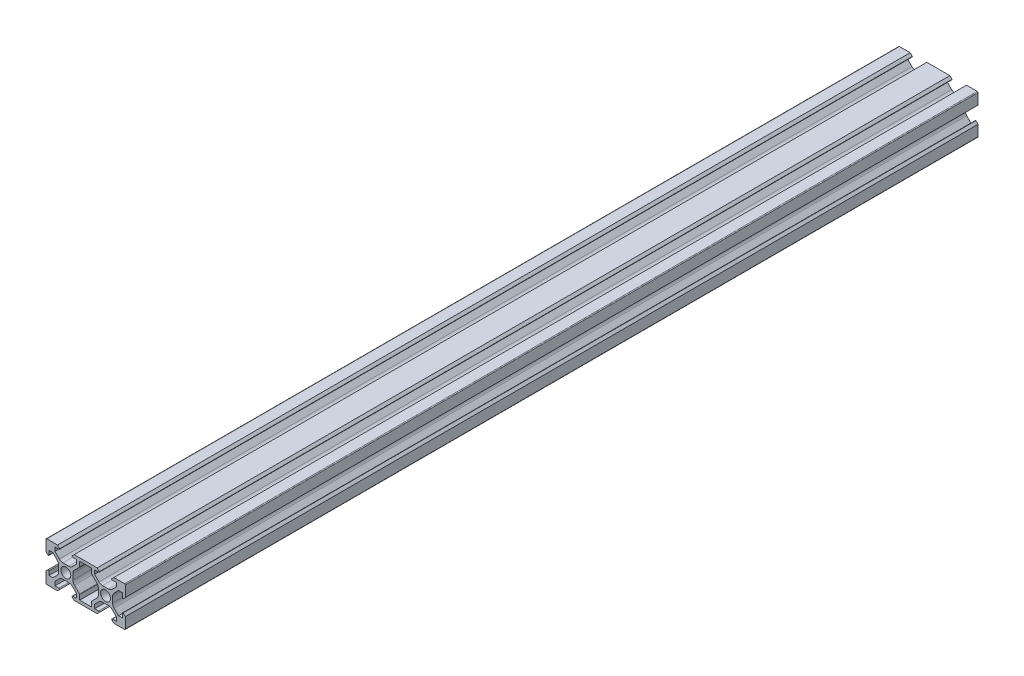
ISO-10303-21;
HEADER;
FILE_DESCRIPTION(('STEP AP214'),'2;1');
FILE_NAME('part.step','',(''),(''),'','','');
FILE_SCHEMA(('AUTOMOTIVE_DESIGN { 1 0 10303 214 1 1 1 1 }'));
ENDSEC;
DATA;
#1=APPLICATION_CONTEXT('core data for automotive mechanical design processes');
#2=APPLICATION_PROTOCOL_DEFINITION('international standard','automotive_design',2000,#1);
#3=PRODUCT_CONTEXT('',#1,'mechanical');
#4=PRODUCT('Part','Part','',(#3));
#5=PRODUCT_RELATED_PRODUCT_CATEGORY('part','',(#4));
#6=PRODUCT_DEFINITION_FORMATION('','',#4);
#7=PRODUCT_DEFINITION_CONTEXT('part definition',#1,'design');
#8=PRODUCT_DEFINITION('design','',#6,#7);
#9=PRODUCT_DEFINITION_SHAPE('','',#8);
#10=(LENGTH_UNIT() NAMED_UNIT(*) SI_UNIT(.MILLI.,.METRE.));
#11=(NAMED_UNIT(*) PLANE_ANGLE_UNIT() SI_UNIT($,.RADIAN.));
#12=(NAMED_UNIT(*) SI_UNIT($,.STERADIAN.) SOLID_ANGLE_UNIT());
#13=UNCERTAINTY_MEASURE_WITH_UNIT(LENGTH_MEASURE(1.E-05),#10,'distance_accuracy_value','');
#14=(GEOMETRIC_REPRESENTATION_CONTEXT(3) GLOBAL_UNCERTAINTY_ASSIGNED_CONTEXT((#13)) GLOBAL_UNIT_ASSIGNED_CONTEXT((#10,
#11,#12)) REPRESENTATION_CONTEXT('',''));
#15=CARTESIAN_POINT('',(0.,0.,0.));
#16=DIRECTION('',(0.,0.,1.));
#17=DIRECTION('',(1.,0.,0.));
#18=AXIS2_PLACEMENT_3D('',#15,#16,#17);
#19=CARTESIAN_POINT('',(13.4999999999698,-8.89999999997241,-350.));
#20=DIRECTION('',(0.,0.,1.));
#21=DIRECTION('',(1.,0.,0.));
#22=AXIS2_PLACEMENT_3D('',#19,#20,#21);
#23=CYLINDRICAL_SURFACE('',#22,0.399999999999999);
#24=CARTESIAN_POINT('',(13.4999999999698,-8.89999999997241,-350.));
#25=DIRECTION('',(0.,0.,1.));
#26=DIRECTION('',(1.,0.,0.));
#27=AXIS2_PLACEMENT_3D('',#24,#25,#26);
#28=CIRCLE('',#27,0.399999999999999);
#29=CARTESIAN_POINT('',(13.4999999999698,-8.49999999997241,-350.));
#30=VERTEX_POINT('',#29);
#31=CARTESIAN_POINT('',(13.0999999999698,-8.89999999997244,-350.));
#32=VERTEX_POINT('',#31);
#33=EDGE_CURVE('E716',#30,#32,#28,.T.);
#34=ORIENTED_EDGE('',*,*,#33,.T.);
#35=DIRECTION('',(0.,0.,1.));
#36=VECTOR('',#35,1.);
#37=CARTESIAN_POINT('',(13.0999999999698,-8.89999999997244,-350.));
#38=LINE('',#37,#36);
#39=CARTESIAN_POINT('',(13.0999999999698,-8.89999999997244,80.0000000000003));
#40=VERTEX_POINT('',#39);
#41=EDGE_CURVE('E718',#40,#32,#38,.F.);
#42=ORIENTED_EDGE('',*,*,#41,.F.);
#43=CARTESIAN_POINT('',(13.4999999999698,-8.89999999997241,80.));
#44=DIRECTION('',(0.,0.,1.));
#45=DIRECTION('',(1.,0.,0.));
#46=AXIS2_PLACEMENT_3D('',#43,#44,#45);
#47=CIRCLE('',#46,0.399999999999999);
#48=CARTESIAN_POINT('',(13.4999999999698,-8.49999999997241,80.));
#49=VERTEX_POINT('',#48);
#50=EDGE_CURVE('E20',#40,#49,#47,.F.);
#51=ORIENTED_EDGE('',*,*,#50,.T.);
#52=DIRECTION('',(0.,0.,1.));
#53=VECTOR('',#52,1.);
#54=CARTESIAN_POINT('',(13.4999999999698,-8.49999999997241,-350.));
#55=LINE('',#54,#53);
#56=EDGE_CURVE('E1341',#30,#49,#55,.T.);
#57=ORIENTED_EDGE('',*,*,#56,.F.);
#58=EDGE_LOOP('',(#34,#42,#51,#57));
#59=FACE_BOUND('',#58,.T.);
#60=ADVANCED_FACE('F17',(#59),#23,.T.);
#61=CARTESIAN_POINT('',(13.0999999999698,-8.89999999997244,-350.));
#62=DIRECTION('',(-0.707106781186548,-0.707106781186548,0.));
#63=DIRECTION('',(0.707106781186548,-0.707106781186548,0.));
#64=AXIS2_PLACEMENT_3D('',#61,#62,#63);
#65=PLANE('',#64);
#66=DIRECTION('',(0.707106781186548,-0.707106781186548,0.));
#67=VECTOR('',#66,1.);
#68=CARTESIAN_POINT('',(13.0999999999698,-8.89999999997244,-350.));
#69=LINE('',#68,#67);
#70=CARTESIAN_POINT('',(14.2,-10.0000000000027,-350.));
#71=VERTEX_POINT('',#70);
#72=EDGE_CURVE('E721',#32,#71,#69,.T.);
#73=ORIENTED_EDGE('',*,*,#72,.T.);
#74=DIRECTION('',(0.,0.,1.));
#75=VECTOR('',#74,1.);
#76=CARTESIAN_POINT('',(14.2,-10.0000000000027,-350.));
#77=LINE('',#76,#75);
#78=CARTESIAN_POINT('',(14.2,-10.0000000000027,80.0000000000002));
#79=VERTEX_POINT('',#78);
#80=EDGE_CURVE('E725',#79,#71,#77,.F.);
#81=ORIENTED_EDGE('',*,*,#80,.F.);
#82=DIRECTION('',(0.707106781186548,-0.707106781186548,0.));
#83=VECTOR('',#82,1.);
#84=CARTESIAN_POINT('',(13.0999999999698,-8.89999999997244,80.0000000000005));
#85=LINE('',#84,#83);
#86=EDGE_CURVE('E708',#79,#40,#85,.F.);
#87=ORIENTED_EDGE('',*,*,#86,.T.);
#88=ORIENTED_EDGE('',*,*,#41,.T.);
#89=EDGE_LOOP('',(#73,#81,#87,#88));
#90=FACE_BOUND('',#89,.T.);
#91=ADVANCED_FACE('F723',(#90),#65,.T.);
#92=CARTESIAN_POINT('',(19.6,-9.60000000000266,-350.));
#93=DIRECTION('',(0.,0.,1.));
#94=DIRECTION('',(1.,0.,0.));
#95=AXIS2_PLACEMENT_3D('',#92,#93,#94);
#96=CYLINDRICAL_SURFACE('',#95,0.400000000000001);
#97=CARTESIAN_POINT('',(19.6,-9.60000000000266,-350.));
#98=DIRECTION('',(0.,0.,1.));
#99=DIRECTION('',(1.,0.,0.));
#100=AXIS2_PLACEMENT_3D('',#97,#98,#99);
#101=CIRCLE('',#100,0.400000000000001);
#102=CARTESIAN_POINT('',(19.6,-10.0000000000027,-350.));
#103=VERTEX_POINT('',#102);
#104=CARTESIAN_POINT('',(20.,-9.60000000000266,-350.));
#105=VERTEX_POINT('',#104);
#106=EDGE_CURVE('E732',#103,#105,#101,.T.);
#107=ORIENTED_EDGE('',*,*,#106,.T.);
#108=DIRECTION('',(0.,0.,-1.));
#109=VECTOR('',#108,1.);
#110=CARTESIAN_POINT('',(20.,-9.60000000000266,-350.));
#111=LINE('',#110,#109);
#112=CARTESIAN_POINT('',(20.,-9.60000000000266,80.));
#113=VERTEX_POINT('',#112);
#114=EDGE_CURVE('E1348',#113,#105,#111,.T.);
#115=ORIENTED_EDGE('',*,*,#114,.F.);
#116=CARTESIAN_POINT('',(19.6,-9.60000000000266,80.));
#117=DIRECTION('',(0.,0.,1.));
#118=DIRECTION('',(1.,0.,0.));
#119=AXIS2_PLACEMENT_3D('',#116,#117,#118);
#120=CIRCLE('',#119,0.400000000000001);
#121=CARTESIAN_POINT('',(19.6,-10.0000000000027,80.));
#122=VERTEX_POINT('',#121);
#123=EDGE_CURVE('E730',#113,#122,#120,.F.);
#124=ORIENTED_EDGE('',*,*,#123,.T.);
#125=DIRECTION('',(0.,0.,1.));
#126=VECTOR('',#125,1.);
#127=CARTESIAN_POINT('',(19.6,-10.0000000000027,-350.));
#128=LINE('',#127,#126);
#129=EDGE_CURVE('E1345',#103,#122,#128,.T.);
#130=ORIENTED_EDGE('',*,*,#129,.F.);
#131=EDGE_LOOP('',(#107,#115,#124,#130));
#132=FACE_BOUND('',#131,.T.);
#133=ADVANCED_FACE('F2724',(#132),#96,.T.);
#134=CARTESIAN_POINT('',(20.,-4.20000000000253,-350.));
#135=DIRECTION('',(0.707106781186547,0.707106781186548,0.));
#136=DIRECTION('',(-0.707106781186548,0.707106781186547,0.));
#137=AXIS2_PLACEMENT_3D('',#134,#135,#136);
#138=PLANE('',#137);
#139=DIRECTION('',(-0.707106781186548,0.707106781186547,0.));
#140=VECTOR('',#139,1.);
#141=CARTESIAN_POINT('',(20.,-4.20000000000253,-350.));
#142=LINE('',#141,#140);
#143=CARTESIAN_POINT('',(20.,-4.20000000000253,-350.));
#144=VERTEX_POINT('',#143);
#145=CARTESIAN_POINT('',(18.8999999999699,-3.09999999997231,-350.));
#146=VERTEX_POINT('',#145);
#147=EDGE_CURVE('E736',#144,#146,#142,.T.);
#148=ORIENTED_EDGE('',*,*,#147,.T.);
#149=DIRECTION('',(0.,0.,1.));
#150=VECTOR('',#149,1.);
#151=CARTESIAN_POINT('',(18.89999999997,-3.09999999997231,-350.));
#152=LINE('',#151,#150);
#153=CARTESIAN_POINT('',(18.8999999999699,-3.09999999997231,80.));
#154=VERTEX_POINT('',#153);
#155=EDGE_CURVE('E741',#154,#146,#152,.F.);
#156=ORIENTED_EDGE('',*,*,#155,.F.);
#157=DIRECTION('',(-0.707106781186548,0.707106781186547,0.));
#158=VECTOR('',#157,1.);
#159=CARTESIAN_POINT('',(20.,-4.20000000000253,80.));
#160=LINE('',#159,#158);
#161=CARTESIAN_POINT('',(20.,-4.20000000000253,80.));
#162=VERTEX_POINT('',#161);
#163=EDGE_CURVE('E734',#154,#162,#160,.F.);
#164=ORIENTED_EDGE('',*,*,#163,.T.);
#165=DIRECTION('',(0.,0.,-1.));
#166=VECTOR('',#165,1.);
#167=CARTESIAN_POINT('',(20.,-4.20000000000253,-350.));
#168=LINE('',#167,#166);
#169=EDGE_CURVE('E1350',#144,#162,#168,.F.);
#170=ORIENTED_EDGE('',*,*,#169,.F.);
#171=EDGE_LOOP('',(#148,#156,#164,#170));
#172=FACE_BOUND('',#171,.T.);
#173=ADVANCED_FACE('F2714',(#172),#138,.T.);
#174=CARTESIAN_POINT('',(18.8999999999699,-3.49999999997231,-350.));
#175=DIRECTION('',(0.,0.,1.));
#176=DIRECTION('',(1.,0.,0.));
#177=AXIS2_PLACEMENT_3D('',#174,#175,#176);
#178=CYLINDRICAL_SURFACE('',#177,0.400000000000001);
#179=CARTESIAN_POINT('',(18.8999999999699,-3.49999999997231,-350.));
#180=DIRECTION('',(0.,0.,1.));
#181=DIRECTION('',(1.,0.,0.));
#182=AXIS2_PLACEMENT_3D('',#179,#180,#181);
#183=CIRCLE('',#182,0.400000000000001);
#184=CARTESIAN_POINT('',(18.49999999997,-3.49999999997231,-350.));
#185=VERTEX_POINT('',#184);
#186=EDGE_CURVE('E742',#146,#185,#183,.T.);
#187=ORIENTED_EDGE('',*,*,#186,.T.);
#188=DIRECTION('',(0.,0.,1.));
#189=VECTOR('',#188,1.);
#190=CARTESIAN_POINT('',(18.49999999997,-3.49999999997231,-350.));
#191=LINE('',#190,#189);
#192=CARTESIAN_POINT('',(18.49999999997,-3.49999999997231,80.));
#193=VERTEX_POINT('',#192);
#194=EDGE_CURVE('E1353',#193,#185,#191,.F.);
#195=ORIENTED_EDGE('',*,*,#194,.F.);
#196=CARTESIAN_POINT('',(18.8999999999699,-3.49999999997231,80.));
#197=DIRECTION('',(0.,0.,1.));
#198=DIRECTION('',(1.,0.,0.));
#199=AXIS2_PLACEMENT_3D('',#196,#197,#198);
#200=CIRCLE('',#199,0.400000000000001);
#201=EDGE_CURVE('E738',#193,#154,#200,.F.);
#202=ORIENTED_EDGE('',*,*,#201,.T.);
#203=ORIENTED_EDGE('',*,*,#155,.T.);
#204=EDGE_LOOP('',(#187,#195,#202,#203));
#205=FACE_BOUND('',#204,.T.);
#206=ADVANCED_FACE('F2704',(#205),#178,.T.);
#207=CARTESIAN_POINT('',(18.8999999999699,3.49999999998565,-350.));
#208=DIRECTION('',(0.,0.,1.));
#209=DIRECTION('',(1.,0.,0.));
#210=AXIS2_PLACEMENT_3D('',#207,#208,#209);
#211=CYLINDRICAL_SURFACE('',#210,0.400000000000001);
#212=CARTESIAN_POINT('',(18.8999999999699,3.49999999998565,-350.));
#213=DIRECTION('',(0.,0.,1.));
#214=DIRECTION('',(1.,0.,0.));
#215=AXIS2_PLACEMENT_3D('',#212,#213,#214);
#216=CIRCLE('',#215,0.400000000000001);
#217=CARTESIAN_POINT('',(18.4999999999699,3.49999999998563,-350.));
#218=VERTEX_POINT('',#217);
#219=CARTESIAN_POINT('',(18.8999999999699,3.09999999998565,-350.));
#220=VERTEX_POINT('',#219);
#221=EDGE_CURVE('E746',#218,#220,#216,.T.);
#222=ORIENTED_EDGE('',*,*,#221,.T.);
#223=DIRECTION('',(0.,0.,1.));
#224=VECTOR('',#223,1.);
#225=CARTESIAN_POINT('',(18.8999999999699,3.09999999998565,-350.));
#226=LINE('',#225,#224);
#227=CARTESIAN_POINT('',(18.8999999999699,3.09999999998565,80.));
#228=VERTEX_POINT('',#227);
#229=EDGE_CURVE('E751',#228,#220,#226,.F.);
#230=ORIENTED_EDGE('',*,*,#229,.F.);
#231=CARTESIAN_POINT('',(18.8999999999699,3.49999999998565,80.));
#232=DIRECTION('',(0.,0.,1.));
#233=DIRECTION('',(1.,0.,0.));
#234=AXIS2_PLACEMENT_3D('',#231,#232,#233);
#235=CIRCLE('',#234,0.400000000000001);
#236=CARTESIAN_POINT('',(18.4999999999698,3.49999999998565,80.));
#237=VERTEX_POINT('',#236);
#238=EDGE_CURVE('E744',#228,#237,#235,.F.);
#239=ORIENTED_EDGE('',*,*,#238,.T.);
#240=DIRECTION('',(0.,0.,1.));
#241=VECTOR('',#240,1.);
#242=CARTESIAN_POINT('',(18.4999999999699,3.49999999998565,-350.));
#243=LINE('',#242,#241);
#244=EDGE_CURVE('E1378',#218,#237,#243,.T.);
#245=ORIENTED_EDGE('',*,*,#244,.F.);
#246=EDGE_LOOP('',(#222,#230,#239,#245));
#247=FACE_BOUND('',#246,.T.);
#248=ADVANCED_FACE('F2694',(#247),#211,.T.);
#249=CARTESIAN_POINT('',(18.8999999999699,3.09999999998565,-350.));
#250=DIRECTION('',(0.707106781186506,-0.707106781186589,0.));
#251=DIRECTION('',(0.707106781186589,0.707106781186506,0.));
#252=AXIS2_PLACEMENT_3D('',#249,#250,#251);
#253=PLANE('',#252);
#254=DIRECTION('',(0.707106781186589,0.707106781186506,0.));
#255=VECTOR('',#254,1.);
#256=CARTESIAN_POINT('',(18.8999999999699,3.09999999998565,-350.));
#257=LINE('',#256,#255);
#258=CARTESIAN_POINT('',(20.,4.20000000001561,-350.));
#259=VERTEX_POINT('',#258);
#260=EDGE_CURVE('E752',#220,#259,#257,.T.);
#261=ORIENTED_EDGE('',*,*,#260,.T.);
#262=DIRECTION('',(0.,0.,1.));
#263=VECTOR('',#262,1.);
#264=CARTESIAN_POINT('',(20.,4.20000000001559,-350.));
#265=LINE('',#264,#263);
#266=CARTESIAN_POINT('',(20.,4.20000000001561,80.));
#267=VERTEX_POINT('',#266);
#268=EDGE_CURVE('E1381',#267,#259,#265,.F.);
#269=ORIENTED_EDGE('',*,*,#268,.F.);
#270=DIRECTION('',(0.707106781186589,0.707106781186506,0.));
#271=VECTOR('',#270,1.);
#272=CARTESIAN_POINT('',(18.8999999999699,3.09999999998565,80.));
#273=LINE('',#272,#271);
#274=EDGE_CURVE('E748',#267,#228,#273,.F.);
#275=ORIENTED_EDGE('',*,*,#274,.T.);
#276=ORIENTED_EDGE('',*,*,#229,.T.);
#277=EDGE_LOOP('',(#261,#269,#275,#276));
#278=FACE_BOUND('',#277,.T.);
#279=ADVANCED_FACE('F2684',(#278),#253,.T.);
#280=CARTESIAN_POINT('',(19.6,9.60000000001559,-350.));
#281=DIRECTION('',(0.,0.,1.));
#282=DIRECTION('',(1.,0.,0.));
#283=AXIS2_PLACEMENT_3D('',#280,#281,#282);
#284=CYLINDRICAL_SURFACE('',#283,0.400000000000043);
#285=CARTESIAN_POINT('',(19.6,9.60000000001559,-350.));
#286=DIRECTION('',(0.,0.,1.));
#287=DIRECTION('',(1.,0.,0.));
#288=AXIS2_PLACEMENT_3D('',#285,#286,#287);
#289=CIRCLE('',#288,0.400000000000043);
#290=CARTESIAN_POINT('',(20.,9.60000000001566,-350.));
#291=VERTEX_POINT('',#290);
#292=CARTESIAN_POINT('',(19.6,10.0000000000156,-350.));
#293=VERTEX_POINT('',#292);
#294=EDGE_CURVE('E756',#291,#293,#289,.T.);
#295=ORIENTED_EDGE('',*,*,#294,.T.);
#296=DIRECTION('',(0.,0.,1.));
#297=VECTOR('',#296,1.);
#298=CARTESIAN_POINT('',(19.6,10.0000000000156,-350.));
#299=LINE('',#298,#297);
#300=CARTESIAN_POINT('',(19.6,10.0000000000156,80.));
#301=VERTEX_POINT('',#300);
#302=EDGE_CURVE('E1387',#301,#293,#299,.F.);
#303=ORIENTED_EDGE('',*,*,#302,.F.);
#304=CARTESIAN_POINT('',(19.6,9.60000000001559,80.));
#305=DIRECTION('',(0.,0.,1.));
#306=DIRECTION('',(1.,0.,0.));
#307=AXIS2_PLACEMENT_3D('',#304,#305,#306);
#308=CIRCLE('',#307,0.400000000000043);
#309=CARTESIAN_POINT('',(20.,9.60000000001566,80.));
#310=VERTEX_POINT('',#309);
#311=EDGE_CURVE('E754',#301,#310,#308,.F.);
#312=ORIENTED_EDGE('',*,*,#311,.T.);
#313=DIRECTION('',(0.,0.,1.));
#314=VECTOR('',#313,1.);
#315=CARTESIAN_POINT('',(20.,9.60000000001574,-350.));
#316=LINE('',#315,#314);
#317=EDGE_CURVE('E1384',#291,#310,#316,.T.);
#318=ORIENTED_EDGE('',*,*,#317,.F.);
#319=EDGE_LOOP('',(#295,#303,#312,#318));
#320=FACE_BOUND('',#319,.T.);
#321=ADVANCED_FACE('F2674',(#320),#284,.T.);
#322=CARTESIAN_POINT('',(14.2,10.0000000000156,-350.));
#323=DIRECTION('',(-0.707106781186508,0.707106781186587,0.));
#324=DIRECTION('',(-0.707106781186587,-0.707106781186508,0.));
#325=AXIS2_PLACEMENT_3D('',#322,#323,#324);
#326=PLANE('',#325);
#327=DIRECTION('',(-0.707106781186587,-0.707106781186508,0.));
#328=VECTOR('',#327,1.);
#329=CARTESIAN_POINT('',(14.2,10.0000000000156,-350.));
#330=LINE('',#329,#328);
#331=CARTESIAN_POINT('',(14.2,10.0000000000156,-350.));
#332=VERTEX_POINT('',#331);
#333=CARTESIAN_POINT('',(13.0999999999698,8.89999999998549,-350.));
#334=VERTEX_POINT('',#333);
#335=EDGE_CURVE('E760',#332,#334,#330,.T.);
#336=ORIENTED_EDGE('',*,*,#335,.T.);
#337=DIRECTION('',(0.,0.,1.));
#338=VECTOR('',#337,1.);
#339=CARTESIAN_POINT('',(13.0999999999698,8.89999999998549,-350.));
#340=LINE('',#339,#338);
#341=CARTESIAN_POINT('',(13.0999999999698,8.89999999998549,80.));
#342=VERTEX_POINT('',#341);
#343=EDGE_CURVE('E765',#342,#334,#340,.F.);
#344=ORIENTED_EDGE('',*,*,#343,.F.);
#345=DIRECTION('',(-0.707106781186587,-0.707106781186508,0.));
#346=VECTOR('',#345,1.);
#347=CARTESIAN_POINT('',(14.2,10.0000000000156,80.));
#348=LINE('',#347,#346);
#349=CARTESIAN_POINT('',(14.2,10.0000000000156,80.));
#350=VERTEX_POINT('',#349);
#351=EDGE_CURVE('E758',#342,#350,#348,.F.);
#352=ORIENTED_EDGE('',*,*,#351,.T.);
#353=DIRECTION('',(0.,0.,1.));
#354=VECTOR('',#353,1.);
#355=CARTESIAN_POINT('',(14.2,10.0000000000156,-350.));
#356=LINE('',#355,#354);
#357=EDGE_CURVE('E1390',#332,#350,#356,.T.);
#358=ORIENTED_EDGE('',*,*,#357,.F.);
#359=EDGE_LOOP('',(#336,#344,#352,#358));
#360=FACE_BOUND('',#359,.T.);
#361=ADVANCED_FACE('F2664',(#360),#326,.T.);
#362=CARTESIAN_POINT('',(13.4999999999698,8.89999999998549,-350.));
#363=DIRECTION('',(0.,0.,1.));
#364=DIRECTION('',(1.,0.,0.));
#365=AXIS2_PLACEMENT_3D('',#362,#363,#364);
#366=CYLINDRICAL_SURFACE('',#365,0.399999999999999);
#367=CARTESIAN_POINT('',(13.4999999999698,8.89999999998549,-350.));
#368=DIRECTION('',(0.,0.,1.));
#369=DIRECTION('',(1.,0.,0.));
#370=AXIS2_PLACEMENT_3D('',#367,#368,#369);
#371=CIRCLE('',#370,0.399999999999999);
#372=CARTESIAN_POINT('',(13.4999999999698,8.49999999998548,-350.));
#373=VERTEX_POINT('',#372);
#374=EDGE_CURVE('E766',#334,#373,#371,.T.);
#375=ORIENTED_EDGE('',*,*,#374,.T.);
#376=DIRECTION('',(0.,0.,1.));
#377=VECTOR('',#376,1.);
#378=CARTESIAN_POINT('',(13.4999999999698,8.49999999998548,-350.));
#379=LINE('',#378,#377);
#380=CARTESIAN_POINT('',(13.4999999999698,8.49999999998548,80.));
#381=VERTEX_POINT('',#380);
#382=EDGE_CURVE('E1393',#381,#373,#379,.F.);
#383=ORIENTED_EDGE('',*,*,#382,.F.);
#384=CARTESIAN_POINT('',(13.4999999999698,8.89999999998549,80.));
#385=DIRECTION('',(0.,0.,1.));
#386=DIRECTION('',(1.,0.,0.));
#387=AXIS2_PLACEMENT_3D('',#384,#385,#386);
#388=CIRCLE('',#387,0.399999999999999);
#389=EDGE_CURVE('E762',#381,#342,#388,.F.);
#390=ORIENTED_EDGE('',*,*,#389,.T.);
#391=ORIENTED_EDGE('',*,*,#343,.T.);
#392=EDGE_LOOP('',(#375,#383,#390,#391));
#393=FACE_BOUND('',#392,.T.);
#394=ADVANCED_FACE('F2654',(#393),#366,.T.);
#395=CARTESIAN_POINT('',(6.50000000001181,8.90000000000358,-350.));
#396=DIRECTION('',(0.,0.,1.));
#397=DIRECTION('',(1.,0.,0.));
#398=AXIS2_PLACEMENT_3D('',#395,#396,#397);
#399=CYLINDRICAL_SURFACE('',#398,0.4);
#400=CARTESIAN_POINT('',(6.50000000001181,8.90000000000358,-350.));
#401=DIRECTION('',(0.,0.,1.));
#402=DIRECTION('',(1.,0.,0.));
#403=AXIS2_PLACEMENT_3D('',#400,#401,#402);
#404=CIRCLE('',#403,0.4);
#405=CARTESIAN_POINT('',(6.50000000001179,8.50000000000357,-350.));
#406=VERTEX_POINT('',#405);
#407=CARTESIAN_POINT('',(6.90000000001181,8.90000000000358,-350.));
#408=VERTEX_POINT('',#407);
#409=EDGE_CURVE('E770',#406,#408,#404,.T.);
#410=ORIENTED_EDGE('',*,*,#409,.T.);
#411=DIRECTION('',(0.,0.,1.));
#412=VECTOR('',#411,1.);
#413=CARTESIAN_POINT('',(6.90000000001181,8.90000000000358,-350.));
#414=LINE('',#413,#412);
#415=CARTESIAN_POINT('',(6.90000000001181,8.90000000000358,80.));
#416=VERTEX_POINT('',#415);
#417=EDGE_CURVE('E775',#416,#408,#414,.F.);
#418=ORIENTED_EDGE('',*,*,#417,.F.);
#419=CARTESIAN_POINT('',(6.50000000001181,8.90000000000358,80.));
#420=DIRECTION('',(0.,0.,1.));
#421=DIRECTION('',(1.,0.,0.));
#422=AXIS2_PLACEMENT_3D('',#419,#420,#421);
#423=CIRCLE('',#422,0.4);
#424=CARTESIAN_POINT('',(6.50000000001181,8.50000000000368,80.));
#425=VERTEX_POINT('',#424);
#426=EDGE_CURVE('E768',#416,#425,#423,.F.);
#427=ORIENTED_EDGE('',*,*,#426,.T.);
#428=DIRECTION('',(0.,0.,1.));
#429=VECTOR('',#428,1.);
#430=CARTESIAN_POINT('',(6.50000000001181,8.50000000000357,-350.));
#431=LINE('',#430,#429);
#432=EDGE_CURVE('E1418',#406,#425,#431,.T.);
#433=ORIENTED_EDGE('',*,*,#432,.F.);
#434=EDGE_LOOP('',(#410,#418,#427,#433));
#435=FACE_BOUND('',#434,.T.);
#436=ADVANCED_FACE('F2644',(#435),#399,.T.);
#437=CARTESIAN_POINT('',(6.90000000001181,8.90000000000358,-350.));
#438=DIRECTION('',(0.707106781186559,0.707106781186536,0.));
#439=DIRECTION('',(-0.707106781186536,0.707106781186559,0.));
#440=AXIS2_PLACEMENT_3D('',#437,#438,#439);
#441=PLANE('',#440);
#442=DIRECTION('',(-0.707106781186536,0.707106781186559,0.));
#443=VECTOR('',#442,1.);
#444=CARTESIAN_POINT('',(6.90000000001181,8.90000000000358,-350.));
#445=LINE('',#444,#443);
#446=CARTESIAN_POINT('',(5.7999999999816,10.0000000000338,-350.));
#447=VERTEX_POINT('',#446);
#448=EDGE_CURVE('E776',#408,#447,#445,.T.);
#449=ORIENTED_EDGE('',*,*,#448,.T.);
#450=DIRECTION('',(0.,0.,1.));
#451=VECTOR('',#450,1.);
#452=CARTESIAN_POINT('',(5.79999999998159,10.0000000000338,-350.));
#453=LINE('',#452,#451);
#454=CARTESIAN_POINT('',(5.7999999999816,10.0000000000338,80.));
#455=VERTEX_POINT('',#454);
#456=EDGE_CURVE('E1421',#455,#447,#453,.F.);
#457=ORIENTED_EDGE('',*,*,#456,.F.);
#458=DIRECTION('',(-0.707106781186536,0.707106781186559,0.));
#459=VECTOR('',#458,1.);
#460=CARTESIAN_POINT('',(6.90000000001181,8.90000000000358,80.));
#461=LINE('',#460,#459);
#462=EDGE_CURVE('E772',#455,#416,#461,.F.);
#463=ORIENTED_EDGE('',*,*,#462,.T.);
#464=ORIENTED_EDGE('',*,*,#417,.T.);
#465=EDGE_LOOP('',(#449,#457,#463,#464));
#466=FACE_BOUND('',#465,.T.);
#467=ADVANCED_FACE('F2634',(#466),#441,.T.);
#468=CARTESIAN_POINT('',(-5.79999999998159,10.0000000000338,-350.));
#469=DIRECTION('',(-0.707106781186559,0.707106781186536,0.));
#470=DIRECTION('',(-0.707106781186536,-0.707106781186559,0.));
#471=AXIS2_PLACEMENT_3D('',#468,#469,#470);
#472=PLANE('',#471);
#473=DIRECTION('',(-0.707106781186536,-0.707106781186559,0.));
#474=VECTOR('',#473,1.);
#475=CARTESIAN_POINT('',(-5.79999999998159,10.0000000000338,-350.));
#476=LINE('',#475,#474);
#477=CARTESIAN_POINT('',(-5.79999999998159,10.0000000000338,-350.));
#478=VERTEX_POINT('',#477);
#479=CARTESIAN_POINT('',(-6.90000000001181,8.90000000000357,-350.));
#480=VERTEX_POINT('',#479);
#481=EDGE_CURVE('E780',#478,#480,#476,.T.);
#482=ORIENTED_EDGE('',*,*,#481,.T.);
#483=DIRECTION('',(0.,0.,1.));
#484=VECTOR('',#483,1.);
#485=CARTESIAN_POINT('',(-6.90000000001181,8.90000000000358,-350.));
#486=LINE('',#485,#484);
#487=CARTESIAN_POINT('',(-6.90000000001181,8.90000000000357,80.));
#488=VERTEX_POINT('',#487);
#489=EDGE_CURVE('E785',#488,#480,#486,.F.);
#490=ORIENTED_EDGE('',*,*,#489,.F.);
#491=DIRECTION('',(-0.707106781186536,-0.707106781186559,0.));
#492=VECTOR('',#491,1.);
#493=CARTESIAN_POINT('',(-5.79999999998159,10.0000000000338,80.));
#494=LINE('',#493,#492);
#495=CARTESIAN_POINT('',(-5.79999999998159,10.0000000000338,80.));
#496=VERTEX_POINT('',#495);
#497=EDGE_CURVE('E778',#488,#496,#494,.F.);
#498=ORIENTED_EDGE('',*,*,#497,.T.);
#499=DIRECTION('',(0.,0.,1.));
#500=VECTOR('',#499,1.);
#501=CARTESIAN_POINT('',(-5.79999999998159,10.0000000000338,-350.));
#502=LINE('',#501,#500);
#503=EDGE_CURVE('E1424',#478,#496,#502,.T.);
#504=ORIENTED_EDGE('',*,*,#503,.F.);
#505=EDGE_LOOP('',(#482,#490,#498,#504));
#506=FACE_BOUND('',#505,.T.);
#507=ADVANCED_FACE('F2624',(#506),#472,.T.);
#508=CARTESIAN_POINT('',(-6.50000000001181,8.90000000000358,-350.));
#509=DIRECTION('',(0.,0.,1.));
#510=DIRECTION('',(1.,0.,0.));
#511=AXIS2_PLACEMENT_3D('',#508,#509,#510);
#512=CYLINDRICAL_SURFACE('',#511,0.4);
#513=CARTESIAN_POINT('',(-6.50000000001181,8.90000000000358,-350.));
#514=DIRECTION('',(0.,0.,1.));
#515=DIRECTION('',(1.,0.,0.));
#516=AXIS2_PLACEMENT_3D('',#513,#514,#515);
#517=CIRCLE('',#516,0.4);
#518=CARTESIAN_POINT('',(-6.50000000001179,8.50000000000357,-350.));
#519=VERTEX_POINT('',#518);
#520=EDGE_CURVE('E786',#480,#519,#517,.T.);
#521=ORIENTED_EDGE('',*,*,#520,.T.);
#522=DIRECTION('',(0.,0.,1.));
#523=VECTOR('',#522,1.);
#524=CARTESIAN_POINT('',(-6.50000000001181,8.50000000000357,-350.));
#525=LINE('',#524,#523);
#526=CARTESIAN_POINT('',(-6.50000000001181,8.50000000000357,80.));
#527=VERTEX_POINT('',#526);
#528=EDGE_CURVE('E1427',#527,#519,#525,.F.);
#529=ORIENTED_EDGE('',*,*,#528,.F.);
#530=CARTESIAN_POINT('',(-6.50000000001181,8.90000000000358,80.));
#531=DIRECTION('',(0.,0.,1.));
#532=DIRECTION('',(1.,0.,0.));
#533=AXIS2_PLACEMENT_3D('',#530,#531,#532);
#534=CIRCLE('',#533,0.4);
#535=EDGE_CURVE('E782',#527,#488,#534,.F.);
#536=ORIENTED_EDGE('',*,*,#535,.T.);
#537=ORIENTED_EDGE('',*,*,#489,.T.);
#538=EDGE_LOOP('',(#521,#529,#536,#537));
#539=FACE_BOUND('',#538,.T.);
#540=ADVANCED_FACE('F2614',(#539),#512,.T.);
#541=CARTESIAN_POINT('',(-13.4999999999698,8.89999999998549,-350.));
#542=DIRECTION('',(0.,0.,1.));
#543=DIRECTION('',(1.,0.,0.));
#544=AXIS2_PLACEMENT_3D('',#541,#542,#543);
#545=CYLINDRICAL_SURFACE('',#544,0.399999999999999);
#546=CARTESIAN_POINT('',(-13.4999999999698,8.89999999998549,-350.));
#547=DIRECTION('',(0.,0.,1.));
#548=DIRECTION('',(1.,0.,0.));
#549=AXIS2_PLACEMENT_3D('',#546,#547,#548);
#550=CIRCLE('',#549,0.399999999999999);
#551=CARTESIAN_POINT('',(-13.4999999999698,8.49999999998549,-350.));
#552=VERTEX_POINT('',#551);
#553=CARTESIAN_POINT('',(-13.0999999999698,8.89999999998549,-350.));
#554=VERTEX_POINT('',#553);
#555=EDGE_CURVE('E790',#552,#554,#550,.T.);
#556=ORIENTED_EDGE('',*,*,#555,.T.);
#557=DIRECTION('',(0.,0.,1.));
#558=VECTOR('',#557,1.);
#559=CARTESIAN_POINT('',(-13.0999999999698,8.89999999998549,-350.));
#560=LINE('',#559,#558);
#561=CARTESIAN_POINT('',(-13.0999999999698,8.89999999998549,80.));
#562=VERTEX_POINT('',#561);
#563=EDGE_CURVE('E795',#562,#554,#560,.F.);
#564=ORIENTED_EDGE('',*,*,#563,.F.);
#565=CARTESIAN_POINT('',(-13.4999999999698,8.89999999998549,80.));
#566=DIRECTION('',(0.,0.,1.));
#567=DIRECTION('',(1.,0.,0.));
#568=AXIS2_PLACEMENT_3D('',#565,#566,#567);
#569=CIRCLE('',#568,0.399999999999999);
#570=CARTESIAN_POINT('',(-13.4999999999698,8.49999999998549,80.));
#571=VERTEX_POINT('',#570);
#572=EDGE_CURVE('E788',#562,#571,#569,.F.);
#573=ORIENTED_EDGE('',*,*,#572,.T.);
#574=DIRECTION('',(0.,0.,1.));
#575=VECTOR('',#574,1.);
#576=CARTESIAN_POINT('',(-13.4999999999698,8.49999999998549,-350.));
#577=LINE('',#576,#575);
#578=EDGE_CURVE('E1452',#552,#571,#577,.T.);
#579=ORIENTED_EDGE('',*,*,#578,.F.);
#580=EDGE_LOOP('',(#556,#564,#573,#579));
#581=FACE_BOUND('',#580,.T.);
#582=ADVANCED_FACE('F2604',(#581),#545,.T.);
#583=CARTESIAN_POINT('',(-13.0999999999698,8.89999999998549,-350.));
#584=DIRECTION('',(0.707106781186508,0.707106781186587,0.));
#585=DIRECTION('',(-0.707106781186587,0.707106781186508,0.));
#586=AXIS2_PLACEMENT_3D('',#583,#584,#585);
#587=PLANE('',#586);
#588=DIRECTION('',(-0.707106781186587,0.707106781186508,0.));
#589=VECTOR('',#588,1.);
#590=CARTESIAN_POINT('',(-13.0999999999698,8.89999999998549,-350.));
#591=LINE('',#590,#589);
#592=CARTESIAN_POINT('',(-14.2,10.0000000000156,-350.));
#593=VERTEX_POINT('',#592);
#594=EDGE_CURVE('E796',#554,#593,#591,.T.);
#595=ORIENTED_EDGE('',*,*,#594,.T.);
#596=DIRECTION('',(0.,0.,1.));
#597=VECTOR('',#596,1.);
#598=CARTESIAN_POINT('',(-14.2,10.0000000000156,-350.));
#599=LINE('',#598,#597);
#600=CARTESIAN_POINT('',(-14.2,10.0000000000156,80.));
#601=VERTEX_POINT('',#600);
#602=EDGE_CURVE('E1455',#601,#593,#599,.F.);
#603=ORIENTED_EDGE('',*,*,#602,.F.);
#604=DIRECTION('',(-0.707106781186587,0.707106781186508,0.));
#605=VECTOR('',#604,1.);
#606=CARTESIAN_POINT('',(-13.0999999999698,8.89999999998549,80.));
#607=LINE('',#606,#605);
#608=EDGE_CURVE('E792',#601,#562,#607,.F.);
#609=ORIENTED_EDGE('',*,*,#608,.T.);
#610=ORIENTED_EDGE('',*,*,#563,.T.);
#611=EDGE_LOOP('',(#595,#603,#609,#610));
#612=FACE_BOUND('',#611,.T.);
#613=ADVANCED_FACE('F2594',(#612),#587,.T.);
#614=CARTESIAN_POINT('',(-19.6,9.60000000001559,-350.));
#615=DIRECTION('',(0.,0.,1.));
#616=DIRECTION('',(1.,0.,0.));
#617=AXIS2_PLACEMENT_3D('',#614,#615,#616);
#618=CYLINDRICAL_SURFACE('',#617,0.400000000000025);
#619=CARTESIAN_POINT('',(-19.6,9.60000000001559,-350.));
#620=DIRECTION('',(0.,0.,1.));
#621=DIRECTION('',(1.,0.,0.));
#622=AXIS2_PLACEMENT_3D('',#619,#620,#621);
#623=CIRCLE('',#622,0.400000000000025);
#624=CARTESIAN_POINT('',(-19.6,10.0000000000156,-350.));
#625=VERTEX_POINT('',#624);
#626=CARTESIAN_POINT('',(-20.,9.60000000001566,-350.));
#627=VERTEX_POINT('',#626);
#628=EDGE_CURVE('E800',#625,#627,#623,.T.);
#629=ORIENTED_EDGE('',*,*,#628,.T.);
#630=DIRECTION('',(0.,0.,1.));
#631=VECTOR('',#630,1.);
#632=CARTESIAN_POINT('',(-20.,9.60000000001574,-350.));
#633=LINE('',#632,#631);
#634=CARTESIAN_POINT('',(-20.,9.60000000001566,80.));
#635=VERTEX_POINT('',#634);
#636=EDGE_CURVE('E1461',#635,#627,#633,.F.);
#637=ORIENTED_EDGE('',*,*,#636,.F.);
#638=CARTESIAN_POINT('',(-19.6,9.60000000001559,80.));
#639=DIRECTION('',(0.,0.,1.));
#640=DIRECTION('',(1.,0.,0.));
#641=AXIS2_PLACEMENT_3D('',#638,#639,#640);
#642=CIRCLE('',#641,0.400000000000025);
#643=CARTESIAN_POINT('',(-19.6,10.0000000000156,80.));
#644=VERTEX_POINT('',#643);
#645=EDGE_CURVE('E798',#635,#644,#642,.F.);
#646=ORIENTED_EDGE('',*,*,#645,.T.);
#647=DIRECTION('',(0.,0.,1.));
#648=VECTOR('',#647,1.);
#649=CARTESIAN_POINT('',(-19.6,10.0000000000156,-350.));
#650=LINE('',#649,#648);
#651=EDGE_CURVE('E1458',#625,#644,#650,.T.);
#652=ORIENTED_EDGE('',*,*,#651,.F.);
#653=EDGE_LOOP('',(#629,#637,#646,#652));
#654=FACE_BOUND('',#653,.T.);
#655=ADVANCED_FACE('F2584',(#654),#618,.T.);
#656=CARTESIAN_POINT('',(-20.,4.20000000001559,-350.));
#657=DIRECTION('',(-0.707106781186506,-0.707106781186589,0.));
#658=DIRECTION('',(0.707106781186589,-0.707106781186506,0.));
#659=AXIS2_PLACEMENT_3D('',#656,#657,#658);
#660=PLANE('',#659);
#661=DIRECTION('',(0.707106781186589,-0.707106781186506,0.));
#662=VECTOR('',#661,1.);
#663=CARTESIAN_POINT('',(-20.,4.20000000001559,-350.));
#664=LINE('',#663,#662);
#665=CARTESIAN_POINT('',(-20.,4.20000000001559,-350.));
#666=VERTEX_POINT('',#665);
#667=CARTESIAN_POINT('',(-18.8999999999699,3.09999999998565,-350.));
#668=VERTEX_POINT('',#667);
#669=EDGE_CURVE('E804',#666,#668,#664,.T.);
#670=ORIENTED_EDGE('',*,*,#669,.T.);
#671=DIRECTION('',(0.,0.,1.));
#672=VECTOR('',#671,1.);
#673=CARTESIAN_POINT('',(-18.8999999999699,3.09999999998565,-350.));
#674=LINE('',#673,#672);
#675=CARTESIAN_POINT('',(-18.8999999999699,3.09999999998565,80.));
#676=VERTEX_POINT('',#675);
#677=EDGE_CURVE('E809',#676,#668,#674,.F.);
#678=ORIENTED_EDGE('',*,*,#677,.F.);
#679=DIRECTION('',(0.707106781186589,-0.707106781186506,0.));
#680=VECTOR('',#679,1.);
#681=CARTESIAN_POINT('',(-20.,4.20000000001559,80.));
#682=LINE('',#681,#680);
#683=CARTESIAN_POINT('',(-20.,4.20000000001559,80.));
#684=VERTEX_POINT('',#683);
#685=EDGE_CURVE('E802',#676,#684,#682,.F.);
#686=ORIENTED_EDGE('',*,*,#685,.T.);
#687=DIRECTION('',(0.,0.,1.));
#688=VECTOR('',#687,1.);
#689=CARTESIAN_POINT('',(-20.,4.20000000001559,-350.));
#690=LINE('',#689,#688);
#691=EDGE_CURVE('E1464',#666,#684,#690,.T.);
#692=ORIENTED_EDGE('',*,*,#691,.F.);
#693=EDGE_LOOP('',(#670,#678,#686,#692));
#694=FACE_BOUND('',#693,.T.);
#695=ADVANCED_FACE('F2574',(#694),#660,.T.);
#696=CARTESIAN_POINT('',(-18.8999999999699,3.49999999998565,-350.));
#697=DIRECTION('',(0.,0.,1.));
#698=DIRECTION('',(1.,0.,0.));
#699=AXIS2_PLACEMENT_3D('',#696,#697,#698);
#700=CYLINDRICAL_SURFACE('',#699,0.400000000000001);
#701=CARTESIAN_POINT('',(-18.8999999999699,3.49999999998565,-350.));
#702=DIRECTION('',(0.,0.,1.));
#703=DIRECTION('',(1.,0.,0.));
#704=AXIS2_PLACEMENT_3D('',#701,#702,#703);
#705=CIRCLE('',#704,0.400000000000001);
#706=CARTESIAN_POINT('',(-18.4999999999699,3.49999999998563,-350.));
#707=VERTEX_POINT('',#706);
#708=EDGE_CURVE('E810',#668,#707,#705,.T.);
#709=ORIENTED_EDGE('',*,*,#708,.T.);
#710=DIRECTION('',(0.,0.,1.));
#711=VECTOR('',#710,1.);
#712=CARTESIAN_POINT('',(-18.4999999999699,3.49999999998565,-350.));
#713=LINE('',#712,#711);
#714=CARTESIAN_POINT('',(-18.4999999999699,3.49999999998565,80.));
#715=VERTEX_POINT('',#714);
#716=EDGE_CURVE('E1467',#715,#707,#713,.F.);
#717=ORIENTED_EDGE('',*,*,#716,.F.);
#718=CARTESIAN_POINT('',(-18.8999999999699,3.49999999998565,80.));
#719=DIRECTION('',(0.,0.,1.));
#720=DIRECTION('',(1.,0.,0.));
#721=AXIS2_PLACEMENT_3D('',#718,#719,#720);
#722=CIRCLE('',#721,0.400000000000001);
#723=EDGE_CURVE('E806',#715,#676,#722,.F.);
#724=ORIENTED_EDGE('',*,*,#723,.T.);
#725=ORIENTED_EDGE('',*,*,#677,.T.);
#726=EDGE_LOOP('',(#709,#717,#724,#725));
#727=FACE_BOUND('',#726,.T.);
#728=ADVANCED_FACE('F2564',(#727),#700,.T.);
#729=CARTESIAN_POINT('',(-18.8999999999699,-3.49999999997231,-350.));
#730=DIRECTION('',(0.,0.,1.));
#731=DIRECTION('',(1.,0.,0.));
#732=AXIS2_PLACEMENT_3D('',#729,#730,#731);
#733=CYLINDRICAL_SURFACE('',#732,0.400000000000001);
#734=CARTESIAN_POINT('',(-18.8999999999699,-3.49999999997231,-350.));
#735=DIRECTION('',(0.,0.,1.));
#736=DIRECTION('',(1.,0.,0.));
#737=AXIS2_PLACEMENT_3D('',#734,#735,#736);
#738=CIRCLE('',#737,0.400000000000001);
#739=CARTESIAN_POINT('',(-18.49999999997,-3.49999999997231,-350.));
#740=VERTEX_POINT('',#739);
#741=CARTESIAN_POINT('',(-18.89999999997,-3.09999999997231,-350.));
#742=VERTEX_POINT('',#741);
#743=EDGE_CURVE('E814',#740,#742,#738,.T.);
#744=ORIENTED_EDGE('',*,*,#743,.T.);
#745=DIRECTION('',(0.,0.,1.));
#746=VECTOR('',#745,1.);
#747=CARTESIAN_POINT('',(-18.89999999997,-3.09999999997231,-350.));
#748=LINE('',#747,#746);
#749=CARTESIAN_POINT('',(-18.89999999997,-3.09999999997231,80.));
#750=VERTEX_POINT('',#749);
#751=EDGE_CURVE('E819',#750,#742,#748,.F.);
#752=ORIENTED_EDGE('',*,*,#751,.F.);
#753=CARTESIAN_POINT('',(-18.8999999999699,-3.49999999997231,80.));
#754=DIRECTION('',(0.,0.,1.));
#755=DIRECTION('',(1.,0.,0.));
#756=AXIS2_PLACEMENT_3D('',#753,#754,#755);
#757=CIRCLE('',#756,0.400000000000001);
#758=CARTESIAN_POINT('',(-18.49999999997,-3.49999999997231,80.));
#759=VERTEX_POINT('',#758);
#760=EDGE_CURVE('E812',#750,#759,#757,.F.);
#761=ORIENTED_EDGE('',*,*,#760,.T.);
#762=DIRECTION('',(0.,0.,-1.));
#763=VECTOR('',#762,1.);
#764=CARTESIAN_POINT('',(-18.49999999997,-3.49999999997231,-350.));
#765=LINE('',#764,#763);
#766=EDGE_CURVE('E1492',#740,#759,#765,.F.);
#767=ORIENTED_EDGE('',*,*,#766,.F.);
#768=EDGE_LOOP('',(#744,#752,#761,#767));
#769=FACE_BOUND('',#768,.T.);
#770=ADVANCED_FACE('F2554',(#769),#733,.T.);
#771=CARTESIAN_POINT('',(-18.89999999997,-3.09999999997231,-350.));
#772=DIRECTION('',(-0.707106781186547,0.707106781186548,0.));
#773=DIRECTION('',(-0.707106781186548,-0.707106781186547,0.));
#774=AXIS2_PLACEMENT_3D('',#771,#772,#773);
#775=PLANE('',#774);
#776=DIRECTION('',(-0.707106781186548,-0.707106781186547,0.));
#777=VECTOR('',#776,1.);
#778=CARTESIAN_POINT('',(-18.89999999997,-3.09999999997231,-350.));
#779=LINE('',#778,#777);
#780=CARTESIAN_POINT('',(-20.,-4.20000000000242,-350.));
#781=VERTEX_POINT('',#780);
#782=EDGE_CURVE('E820',#742,#781,#779,.T.);
#783=ORIENTED_EDGE('',*,*,#782,.T.);
#784=DIRECTION('',(0.,0.,1.));
#785=VECTOR('',#784,1.);
#786=CARTESIAN_POINT('',(-20.,-4.20000000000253,-350.));
#787=LINE('',#786,#785);
#788=CARTESIAN_POINT('',(-20.,-4.20000000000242,80.));
#789=VERTEX_POINT('',#788);
#790=EDGE_CURVE('E1495',#789,#781,#787,.F.);
#791=ORIENTED_EDGE('',*,*,#790,.F.);
#792=DIRECTION('',(-0.707106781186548,-0.707106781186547,0.));
#793=VECTOR('',#792,1.);
#794=CARTESIAN_POINT('',(-18.89999999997,-3.09999999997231,80.));
#795=LINE('',#794,#793);
#796=EDGE_CURVE('E816',#789,#750,#795,.F.);
#797=ORIENTED_EDGE('',*,*,#796,.T.);
#798=ORIENTED_EDGE('',*,*,#751,.T.);
#799=EDGE_LOOP('',(#783,#791,#797,#798));
#800=FACE_BOUND('',#799,.T.);
#801=ADVANCED_FACE('F2544',(#800),#775,.T.);
#802=CARTESIAN_POINT('',(-19.6,-9.60000000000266,-350.));
#803=DIRECTION('',(0.,0.,1.));
#804=DIRECTION('',(1.,0.,0.));
#805=AXIS2_PLACEMENT_3D('',#802,#803,#804);
#806=CYLINDRICAL_SURFACE('',#805,0.400000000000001);
#807=CARTESIAN_POINT('',(-19.6,-9.60000000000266,-350.));
#808=DIRECTION('',(0.,0.,1.));
#809=DIRECTION('',(1.,0.,0.));
#810=AXIS2_PLACEMENT_3D('',#807,#808,#809);
#811=CIRCLE('',#810,0.400000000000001);
#812=CARTESIAN_POINT('',(-20.,-9.60000000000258,-350.));
#813=VERTEX_POINT('',#812);
#814=CARTESIAN_POINT('',(-19.6,-10.0000000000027,-350.));
#815=VERTEX_POINT('',#814);
#816=EDGE_CURVE('E824',#813,#815,#811,.T.);
#817=ORIENTED_EDGE('',*,*,#816,.T.);
#818=DIRECTION('',(0.,0.,1.));
#819=VECTOR('',#818,1.);
#820=CARTESIAN_POINT('',(-19.6,-10.0000000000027,-350.));
#821=LINE('',#820,#819);
#822=CARTESIAN_POINT('',(-19.6,-10.0000000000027,80.));
#823=VERTEX_POINT('',#822);
#824=EDGE_CURVE('E1501',#823,#815,#821,.F.);
#825=ORIENTED_EDGE('',*,*,#824,.F.);
#826=CARTESIAN_POINT('',(-19.6,-9.60000000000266,80.));
#827=DIRECTION('',(0.,0.,1.));
#828=DIRECTION('',(1.,0.,0.));
#829=AXIS2_PLACEMENT_3D('',#826,#827,#828);
#830=CIRCLE('',#829,0.400000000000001);
#831=CARTESIAN_POINT('',(-20.,-9.60000000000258,80.));
#832=VERTEX_POINT('',#831);
#833=EDGE_CURVE('E822',#823,#832,#830,.F.);
#834=ORIENTED_EDGE('',*,*,#833,.T.);
#835=DIRECTION('',(0.,0.,1.));
#836=VECTOR('',#835,1.);
#837=CARTESIAN_POINT('',(-20.,-9.60000000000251,-350.));
#838=LINE('',#837,#836);
#839=EDGE_CURVE('E1498',#813,#832,#838,.T.);
#840=ORIENTED_EDGE('',*,*,#839,.F.);
#841=EDGE_LOOP('',(#817,#825,#834,#840));
#842=FACE_BOUND('',#841,.T.);
#843=ADVANCED_FACE('F2534',(#842),#806,.T.);
#844=CARTESIAN_POINT('',(-14.2,-10.0000000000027,-350.));
#845=DIRECTION('',(0.707106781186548,-0.707106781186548,0.));
#846=DIRECTION('',(0.707106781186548,0.707106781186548,0.));
#847=AXIS2_PLACEMENT_3D('',#844,#845,#846);
#848=PLANE('',#847);
#849=DIRECTION('',(0.707106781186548,0.707106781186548,0.));
#850=VECTOR('',#849,1.);
#851=CARTESIAN_POINT('',(-14.2,-10.0000000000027,-350.));
#852=LINE('',#851,#850);
#853=CARTESIAN_POINT('',(-14.2,-10.0000000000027,-350.));
#854=VERTEX_POINT('',#853);
#855=CARTESIAN_POINT('',(-13.0999999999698,-8.89999999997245,-350.));
#856=VERTEX_POINT('',#855);
#857=EDGE_CURVE('E828',#854,#856,#852,.T.);
#858=ORIENTED_EDGE('',*,*,#857,.T.);
#859=DIRECTION('',(0.,0.,1.));
#860=VECTOR('',#859,1.);
#861=CARTESIAN_POINT('',(-13.0999999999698,-8.89999999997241,-350.));
#862=LINE('',#861,#860);
#863=CARTESIAN_POINT('',(-13.0999999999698,-8.89999999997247,80.0000000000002));
#864=VERTEX_POINT('',#863);
#865=EDGE_CURVE('E833',#864,#856,#862,.F.);
#866=ORIENTED_EDGE('',*,*,#865,.F.);
#867=DIRECTION('',(0.707106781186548,0.707106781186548,0.));
#868=VECTOR('',#867,1.);
#869=CARTESIAN_POINT('',(-14.2,-10.0000000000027,80.0000000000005));
#870=LINE('',#869,#868);
#871=CARTESIAN_POINT('',(-14.2,-10.0000000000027,80.0000000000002));
#872=VERTEX_POINT('',#871);
#873=EDGE_CURVE('E826',#864,#872,#870,.F.);
#874=ORIENTED_EDGE('',*,*,#873,.T.);
#875=DIRECTION('',(0.,0.,1.));
#876=VECTOR('',#875,1.);
#877=CARTESIAN_POINT('',(-14.2,-10.0000000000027,-350.));
#878=LINE('',#877,#876);
#879=EDGE_CURVE('E1504',#854,#872,#878,.T.);
#880=ORIENTED_EDGE('',*,*,#879,.F.);
#881=EDGE_LOOP('',(#858,#866,#874,#880));
#882=FACE_BOUND('',#881,.T.);
#883=ADVANCED_FACE('F2524',(#882),#848,.T.);
#884=CARTESIAN_POINT('',(-13.4999999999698,-8.89999999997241,-350.));
#885=DIRECTION('',(0.,0.,1.));
#886=DIRECTION('',(1.,0.,0.));
#887=AXIS2_PLACEMENT_3D('',#884,#885,#886);
#888=CYLINDRICAL_SURFACE('',#887,0.399999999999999);
#889=CARTESIAN_POINT('',(-13.4999999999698,-8.89999999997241,-350.));
#890=DIRECTION('',(0.,0.,1.));
#891=DIRECTION('',(1.,0.,0.));
#892=AXIS2_PLACEMENT_3D('',#889,#890,#891);
#893=CIRCLE('',#892,0.399999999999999);
#894=CARTESIAN_POINT('',(-13.4999999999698,-8.49999999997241,-350.));
#895=VERTEX_POINT('',#894);
#896=EDGE_CURVE('E834',#856,#895,#893,.T.);
#897=ORIENTED_EDGE('',*,*,#896,.T.);
#898=DIRECTION('',(0.,0.,1.));
#899=VECTOR('',#898,1.);
#900=CARTESIAN_POINT('',(-13.4999999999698,-8.49999999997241,-350.));
#901=LINE('',#900,#899);
#902=CARTESIAN_POINT('',(-13.4999999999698,-8.49999999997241,80.));
#903=VERTEX_POINT('',#902);
#904=EDGE_CURVE('E1507',#903,#895,#901,.F.);
#905=ORIENTED_EDGE('',*,*,#904,.F.);
#906=CARTESIAN_POINT('',(-13.4999999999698,-8.89999999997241,80.));
#907=DIRECTION('',(0.,0.,1.));
#908=DIRECTION('',(1.,0.,0.));
#909=AXIS2_PLACEMENT_3D('',#906,#907,#908);
#910=CIRCLE('',#909,0.399999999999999);
#911=EDGE_CURVE('E830',#903,#864,#910,.F.);
#912=ORIENTED_EDGE('',*,*,#911,.T.);
#913=ORIENTED_EDGE('',*,*,#865,.T.);
#914=EDGE_LOOP('',(#897,#905,#912,#913));
#915=FACE_BOUND('',#914,.T.);
#916=ADVANCED_FACE('F2514',(#915),#888,.T.);
#917=CARTESIAN_POINT('',(-3.39999999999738,6.10502525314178,-350.));
#918=DIRECTION('',(0.,0.,1.));
#919=DIRECTION('',(1.,0.,0.));
#920=AXIS2_PLACEMENT_3D('',#917,#918,#919);
#921=CYLINDRICAL_SURFACE('',#920,0.4);
#922=CARTESIAN_POINT('',(-3.39999999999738,6.10502525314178,-350.));
#923=DIRECTION('',(0.,0.,1.));
#924=DIRECTION('',(1.,0.,0.));
#925=AXIS2_PLACEMENT_3D('',#922,#923,#924);
#926=CIRCLE('',#925,0.4);
#927=CARTESIAN_POINT('',(-3.11715728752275,5.82218254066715,-350.));
#928=VERTEX_POINT('',#927);
#929=CARTESIAN_POINT('',(-2.99999999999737,6.10502525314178,-350.));
#930=VERTEX_POINT('',#929);
#931=EDGE_CURVE('E838',#928,#930,#926,.T.);
#932=ORIENTED_EDGE('',*,*,#931,.T.);
#933=DIRECTION('',(0.,0.,1.));
#934=VECTOR('',#933,1.);
#935=CARTESIAN_POINT('',(-2.99999999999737,6.10502525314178,-350.));
#936=LINE('',#935,#934);
#937=CARTESIAN_POINT('',(-2.99999999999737,6.10502525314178,80.));
#938=VERTEX_POINT('',#937);
#939=EDGE_CURVE('E1550',#930,#938,#936,.T.);
#940=ORIENTED_EDGE('',*,*,#939,.T.);
#941=CARTESIAN_POINT('',(-3.39999999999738,6.10502525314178,80.));
#942=DIRECTION('',(0.,0.,1.));
#943=DIRECTION('',(1.,0.,0.));
#944=AXIS2_PLACEMENT_3D('',#941,#942,#943);
#945=CIRCLE('',#944,0.4);
#946=CARTESIAN_POINT('',(-3.11715728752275,5.82218254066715,80.));
#947=VERTEX_POINT('',#946);
#948=EDGE_CURVE('E836',#938,#947,#945,.F.);
#949=ORIENTED_EDGE('',*,*,#948,.T.);
#950=DIRECTION('',(0.,0.,1.));
#951=VECTOR('',#950,1.);
#952=CARTESIAN_POINT('',(-3.11715728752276,5.82218254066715,-350.));
#953=LINE('',#952,#951);
#954=EDGE_CURVE('E1547',#947,#928,#953,.F.);
#955=ORIENTED_EDGE('',*,*,#954,.T.);
#956=EDGE_LOOP('',(#932,#940,#949,#955));
#957=FACE_BOUND('',#956,.T.);
#958=ADVANCED_FACE('F2504',(#957),#921,.T.);
#959=CARTESIAN_POINT('',(3.39999999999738,6.10502525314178,-350.));
#960=DIRECTION('',(0.,0.,1.));
#961=DIRECTION('',(1.,0.,0.));
#962=AXIS2_PLACEMENT_3D('',#959,#960,#961);
#963=CYLINDRICAL_SURFACE('',#962,0.4);
#964=CARTESIAN_POINT('',(3.39999999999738,6.10502525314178,-350.));
#965=DIRECTION('',(0.,0.,1.));
#966=DIRECTION('',(1.,0.,0.));
#967=AXIS2_PLACEMENT_3D('',#964,#965,#966);
#968=CIRCLE('',#967,0.4);
#969=CARTESIAN_POINT('',(2.99999999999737,6.10502525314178,-350.));
#970=VERTEX_POINT('',#969);
#971=CARTESIAN_POINT('',(3.11715728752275,5.82218254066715,-350.));
#972=VERTEX_POINT('',#971);
#973=EDGE_CURVE('E842',#970,#972,#968,.T.);
#974=ORIENTED_EDGE('',*,*,#973,.T.);
#975=DIRECTION('',(0.,0.,1.));
#976=VECTOR('',#975,1.);
#977=CARTESIAN_POINT('',(3.11715728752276,5.82218254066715,-350.));
#978=LINE('',#977,#976);
#979=CARTESIAN_POINT('',(3.11715728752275,5.82218254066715,80.));
#980=VERTEX_POINT('',#979);
#981=EDGE_CURVE('E1560',#972,#980,#978,.T.);
#982=ORIENTED_EDGE('',*,*,#981,.T.);
#983=CARTESIAN_POINT('',(3.39999999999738,6.10502525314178,80.));
#984=DIRECTION('',(0.,0.,1.));
#985=DIRECTION('',(1.,0.,0.));
#986=AXIS2_PLACEMENT_3D('',#983,#984,#985);
#987=CIRCLE('',#986,0.4);
#988=CARTESIAN_POINT('',(2.99999999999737,6.10502525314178,80.));
#989=VERTEX_POINT('',#988);
#990=EDGE_CURVE('E840',#980,#989,#987,.F.);
#991=ORIENTED_EDGE('',*,*,#990,.T.);
#992=DIRECTION('',(0.,0.,-1.));
#993=VECTOR('',#992,1.);
#994=CARTESIAN_POINT('',(2.99999999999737,6.10502525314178,-350.));
#995=LINE('',#994,#993);
#996=EDGE_CURVE('E1557',#989,#970,#995,.T.);
#997=ORIENTED_EDGE('',*,*,#996,.T.);
#998=EDGE_LOOP('',(#974,#982,#991,#997));
#999=FACE_BOUND('',#998,.T.);
#1000=ADVANCED_FACE('F2494',(#999),#963,.T.);
#1001=CARTESIAN_POINT('',(3.39999999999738,-6.1050252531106,-350.));
#1002=DIRECTION('',(0.,0.,1.));
#1003=DIRECTION('',(1.,0.,0.));
#1004=AXIS2_PLACEMENT_3D('',#1001,#1002,#1003);
#1005=CYLINDRICAL_SURFACE('',#1004,0.4);
#1006=CARTESIAN_POINT('',(3.39999999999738,-6.1050252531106,-350.));
#1007=DIRECTION('',(0.,0.,1.));
#1008=DIRECTION('',(1.,0.,0.));
#1009=AXIS2_PLACEMENT_3D('',#1006,#1007,#1008);
#1010=CIRCLE('',#1009,0.4);
#1011=CARTESIAN_POINT('',(3.11715728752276,-5.82218254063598,-350.));
#1012=VERTEX_POINT('',#1011);
#1013=CARTESIAN_POINT('',(2.99999999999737,-6.1050252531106,-350.));
#1014=VERTEX_POINT('',#1013);
#1015=EDGE_CURVE('E846',#1012,#1014,#1010,.T.);
#1016=ORIENTED_EDGE('',*,*,#1015,.T.);
#1017=DIRECTION('',(0.,0.,-1.));
#1018=VECTOR('',#1017,1.);
#1019=CARTESIAN_POINT('',(2.99999999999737,-6.1050252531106,-350.));
#1020=LINE('',#1019,#1018);
#1021=CARTESIAN_POINT('',(2.99999999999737,-6.1050252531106,80.));
#1022=VERTEX_POINT('',#1021);
#1023=EDGE_CURVE('E1574',#1014,#1022,#1020,.F.);
#1024=ORIENTED_EDGE('',*,*,#1023,.T.);
#1025=CARTESIAN_POINT('',(3.39999999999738,-6.1050252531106,80.));
#1026=DIRECTION('',(0.,0.,1.));
#1027=DIRECTION('',(1.,0.,0.));
#1028=AXIS2_PLACEMENT_3D('',#1025,#1026,#1027);
#1029=CIRCLE('',#1028,0.4);
#1030=CARTESIAN_POINT('',(3.11715728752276,-5.82218254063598,80.));
#1031=VERTEX_POINT('',#1030);
#1032=EDGE_CURVE('E844',#1022,#1031,#1029,.F.);
#1033=ORIENTED_EDGE('',*,*,#1032,.T.);
#1034=DIRECTION('',(0.,0.,1.));
#1035=VECTOR('',#1034,1.);
#1036=CARTESIAN_POINT('',(3.11715728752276,-5.82218254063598,-350.));
#1037=LINE('',#1036,#1035);
#1038=EDGE_CURVE('E1571',#1031,#1012,#1037,.F.);
#1039=ORIENTED_EDGE('',*,*,#1038,.T.);
#1040=EDGE_LOOP('',(#1016,#1024,#1033,#1039));
#1041=FACE_BOUND('',#1040,.T.);
#1042=ADVANCED_FACE('F2484',(#1041),#1005,.T.);
#1043=CARTESIAN_POINT('',(-3.39999999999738,-6.1050252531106,-350.));
#1044=DIRECTION('',(0.,0.,1.));
#1045=DIRECTION('',(1.,0.,0.));
#1046=AXIS2_PLACEMENT_3D('',#1043,#1044,#1045);
#1047=CYLINDRICAL_SURFACE('',#1046,0.4);
#1048=CARTESIAN_POINT('',(-3.39999999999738,-6.1050252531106,-350.));
#1049=DIRECTION('',(0.,0.,1.));
#1050=DIRECTION('',(1.,0.,0.));
#1051=AXIS2_PLACEMENT_3D('',#1048,#1049,#1050);
#1052=CIRCLE('',#1051,0.4);
#1053=CARTESIAN_POINT('',(-2.99999999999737,-6.1050252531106,-350.));
#1054=VERTEX_POINT('',#1053);
#1055=CARTESIAN_POINT('',(-3.11715728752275,-5.82218254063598,-350.));
#1056=VERTEX_POINT('',#1055);
#1057=EDGE_CURVE('E850',#1054,#1056,#1052,.T.);
#1058=ORIENTED_EDGE('',*,*,#1057,.T.);
#1059=DIRECTION('',(0.,0.,1.));
#1060=VECTOR('',#1059,1.);
#1061=CARTESIAN_POINT('',(-3.11715728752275,-5.82218254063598,-350.));
#1062=LINE('',#1061,#1060);
#1063=CARTESIAN_POINT('',(-3.11715728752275,-5.82218254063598,80.0000000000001));
#1064=VERTEX_POINT('',#1063);
#1065=EDGE_CURVE('E1534',#1056,#1064,#1062,.T.);
#1066=ORIENTED_EDGE('',*,*,#1065,.T.);
#1067=CARTESIAN_POINT('',(-3.39999999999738,-6.1050252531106,80.));
#1068=DIRECTION('',(0.,0.,1.));
#1069=DIRECTION('',(1.,0.,0.));
#1070=AXIS2_PLACEMENT_3D('',#1067,#1068,#1069);
#1071=CIRCLE('',#1070,0.4);
#1072=CARTESIAN_POINT('',(-2.99999999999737,-6.1050252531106,80.));
#1073=VERTEX_POINT('',#1072);
#1074=EDGE_CURVE('E848',#1064,#1073,#1071,.F.);
#1075=ORIENTED_EDGE('',*,*,#1074,.T.);
#1076=DIRECTION('',(0.,0.,1.));
#1077=VECTOR('',#1076,1.);
#1078=CARTESIAN_POINT('',(-2.99999999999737,-6.1050252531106,-350.));
#1079=LINE('',#1078,#1077);
#1080=EDGE_CURVE('E1581',#1073,#1054,#1079,.F.);
#1081=ORIENTED_EDGE('',*,*,#1080,.T.);
#1082=EDGE_LOOP('',(#1058,#1066,#1075,#1081));
#1083=FACE_BOUND('',#1082,.T.);
#1084=ADVANCED_FACE('F2474',(#1083),#1047,.T.);
#1085=CARTESIAN_POINT('',(-6.50000000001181,-8.8999999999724,-350.));
#1086=DIRECTION('',(0.,0.,1.));
#1087=DIRECTION('',(1.,0.,0.));
#1088=AXIS2_PLACEMENT_3D('',#1085,#1086,#1087);
#1089=CYLINDRICAL_SURFACE('',#1088,0.4);
#1090=CARTESIAN_POINT('',(-6.50000000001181,-8.8999999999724,-350.));
#1091=DIRECTION('',(0.,0.,1.));
#1092=DIRECTION('',(1.,0.,0.));
#1093=AXIS2_PLACEMENT_3D('',#1090,#1091,#1092);
#1094=CIRCLE('',#1093,0.4);
#1095=CARTESIAN_POINT('',(-6.50000000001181,-8.4999999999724,-350.));
#1096=VERTEX_POINT('',#1095);
#1097=CARTESIAN_POINT('',(-6.90000000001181,-8.89999999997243,-350.));
#1098=VERTEX_POINT('',#1097);
#1099=EDGE_CURVE('E852',#1096,#1098,#1094,.T.);
#1100=ORIENTED_EDGE('',*,*,#1099,.T.);
#1101=DIRECTION('',(0.,0.,1.));
#1102=VECTOR('',#1101,1.);
#1103=CARTESIAN_POINT('',(-6.90000000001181,-8.89999999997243,-350.));
#1104=LINE('',#1103,#1102);
#1105=CARTESIAN_POINT('',(-6.90000000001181,-8.89999999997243,80.0000000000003));
#1106=VERTEX_POINT('',#1105);
#1107=EDGE_CURVE('E1102',#1106,#1098,#1104,.F.);
#1108=ORIENTED_EDGE('',*,*,#1107,.F.);
#1109=CARTESIAN_POINT('',(-6.50000000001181,-8.8999999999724,80.));
#1110=DIRECTION('',(0.,0.,1.));
#1111=DIRECTION('',(1.,0.,0.));
#1112=AXIS2_PLACEMENT_3D('',#1109,#1110,#1111);
#1113=CIRCLE('',#1112,0.4);
#1114=CARTESIAN_POINT('',(-6.50000000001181,-8.4999999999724,80.));
#1115=VERTEX_POINT('',#1114);
#1116=EDGE_CURVE('E1043',#1115,#1106,#1113,.T.);
#1117=ORIENTED_EDGE('',*,*,#1116,.F.);
#1118=DIRECTION('',(0.,0.,1.));
#1119=VECTOR('',#1118,1.);
#1120=CARTESIAN_POINT('',(-6.50000000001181,-8.4999999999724,-350.));
#1121=LINE('',#1120,#1119);
#1122=EDGE_CURVE('E1532',#1096,#1115,#1121,.T.);
#1123=ORIENTED_EDGE('',*,*,#1122,.F.);
#1124=EDGE_LOOP('',(#1100,#1108,#1117,#1123));
#1125=FACE_BOUND('',#1124,.T.);
#1126=ADVANCED_FACE('F2464',(#1125),#1089,.T.);
#1127=CARTESIAN_POINT('',(6.50000000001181,-8.4999999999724,-350.));
#1128=DIRECTION('',(0.,1.,0.));
#1129=DIRECTION('',(0.,0.,1.));
#1130=AXIS2_PLACEMENT_3D('',#1127,#1128,#1129);
#1131=PLANE('',#1130);
#1132=DIRECTION('',(1.,0.,0.));
#1133=VECTOR('',#1132,1.);
#1134=CARTESIAN_POINT('',(6.50000000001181,-8.4999999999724,-350.));
#1135=LINE('',#1134,#1133);
#1136=CARTESIAN_POINT('',(6.50000000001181,-8.4999999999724,-350.));
#1137=VERTEX_POINT('',#1136);
#1138=CARTESIAN_POINT('',(4.49999999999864,-8.4999999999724,-350.));
#1139=VERTEX_POINT('',#1138);
#1140=EDGE_CURVE('E1106',#1137,#1139,#1135,.F.);
#1141=ORIENTED_EDGE('',*,*,#1140,.T.);
#1142=DIRECTION('',(0.,0.,-1.));
#1143=VECTOR('',#1142,1.);
#1144=CARTESIAN_POINT('',(4.49999999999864,-8.4999999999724,-350.));
#1145=LINE('',#1144,#1143);
#1146=CARTESIAN_POINT('',(4.49999999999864,-8.4999999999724,80.));
#1147=VERTEX_POINT('',#1146);
#1148=EDGE_CURVE('E854',#1147,#1139,#1145,.T.);
#1149=ORIENTED_EDGE('',*,*,#1148,.F.);
#1150=DIRECTION('',(1.,0.,0.));
#1151=VECTOR('',#1150,1.);
#1152=CARTESIAN_POINT('',(6.50000000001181,-8.4999999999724,80.));
#1153=LINE('',#1152,#1151);
#1154=CARTESIAN_POINT('',(6.50000000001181,-8.4999999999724,80.));
#1155=VERTEX_POINT('',#1154);
#1156=EDGE_CURVE('E858',#1155,#1147,#1153,.F.);
#1157=ORIENTED_EDGE('',*,*,#1156,.F.);
#1158=DIRECTION('',(0.,0.,1.));
#1159=VECTOR('',#1158,1.);
#1160=CARTESIAN_POINT('',(6.50000000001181,-8.4999999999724,-350.));
#1161=LINE('',#1160,#1159);
#1162=EDGE_CURVE('E859',#1137,#1155,#1161,.T.);
#1163=ORIENTED_EDGE('',*,*,#1162,.F.);
#1164=EDGE_LOOP('',(#1141,#1149,#1157,#1163));
#1165=FACE_BOUND('',#1164,.T.);
#1166=ADVANCED_FACE('F2454',(#1165),#1131,.T.);
#1167=CARTESIAN_POINT('',(4.49999999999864,-8.4999999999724,-350.));
#1168=DIRECTION('',(1.,0.,0.));
#1169=DIRECTION('',(0.,0.,-1.));
#1170=AXIS2_PLACEMENT_3D('',#1167,#1168,#1169);
#1171=PLANE('',#1170);
#1172=DIRECTION('',(0.,1.,0.));
#1173=VECTOR('',#1172,1.);
#1174=CARTESIAN_POINT('',(4.49999999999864,-8.4999999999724,-350.));
#1175=LINE('',#1174,#1173);
#1176=CARTESIAN_POINT('',(4.49999999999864,-6.56066017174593,-350.));
#1177=VERTEX_POINT('',#1176);
#1178=EDGE_CURVE('E1108',#1139,#1177,#1175,.T.);
#1179=ORIENTED_EDGE('',*,*,#1178,.T.);
#1180=DIRECTION('',(0.,0.,1.));
#1181=VECTOR('',#1180,1.);
#1182=CARTESIAN_POINT('',(4.49999999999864,-6.56066017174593,-350.));
#1183=LINE('',#1182,#1181);
#1184=CARTESIAN_POINT('',(4.49999999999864,-6.56066017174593,80.));
#1185=VERTEX_POINT('',#1184);
#1186=EDGE_CURVE('E1324',#1185,#1177,#1183,.F.);
#1187=ORIENTED_EDGE('',*,*,#1186,.F.);
#1188=DIRECTION('',(0.,1.,0.));
#1189=VECTOR('',#1188,1.);
#1190=CARTESIAN_POINT('',(4.49999999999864,-8.8999999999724,80.));
#1191=LINE('',#1190,#1189);
#1192=EDGE_CURVE('E862',#1147,#1185,#1191,.T.);
#1193=ORIENTED_EDGE('',*,*,#1192,.F.);
#1194=ORIENTED_EDGE('',*,*,#1148,.T.);
#1195=EDGE_LOOP('',(#1179,#1187,#1193,#1194));
#1196=FACE_BOUND('',#1195,.T.);
#1197=ADVANCED_FACE('F2444',(#1196),#1171,.T.);
#1198=CARTESIAN_POINT('',(4.49999999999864,-6.56066017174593,-350.));
#1199=DIRECTION('',(0.707106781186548,-0.707106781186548,0.));
#1200=DIRECTION('',(0.707106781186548,0.707106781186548,0.));
#1201=AXIS2_PLACEMENT_3D('',#1198,#1199,#1200);
#1202=PLANE('',#1201);
#1203=DIRECTION('',(0.707106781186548,0.707106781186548,0.));
#1204=VECTOR('',#1203,1.);
#1205=CARTESIAN_POINT('',(4.49999999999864,-6.56066017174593,-350.));
#1206=LINE('',#1205,#1204);
#1207=CARTESIAN_POINT('',(6.72842712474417,-4.33223304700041,-350.));
#1208=VERTEX_POINT('',#1207);
#1209=EDGE_CURVE('E1110',#1177,#1208,#1206,.T.);
#1210=ORIENTED_EDGE('',*,*,#1209,.T.);
#1211=DIRECTION('',(0.,0.,1.));
#1212=VECTOR('',#1211,1.);
#1213=CARTESIAN_POINT('',(6.72842712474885,-4.33223304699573,-350.));
#1214=LINE('',#1213,#1212);
#1215=CARTESIAN_POINT('',(6.72842712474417,-4.33223304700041,80.));
#1216=VERTEX_POINT('',#1215);
#1217=EDGE_CURVE('E1327',#1208,#1216,#1214,.T.);
#1218=ORIENTED_EDGE('',*,*,#1217,.T.);
#1219=DIRECTION('',(0.707106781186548,0.707106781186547,0.));
#1220=VECTOR('',#1219,1.);
#1221=CARTESIAN_POINT('',(4.49999999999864,-6.56066017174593,80.));
#1222=LINE('',#1221,#1220);
#1223=EDGE_CURVE('E865',#1185,#1216,#1222,.T.);
#1224=ORIENTED_EDGE('',*,*,#1223,.F.);
#1225=ORIENTED_EDGE('',*,*,#1186,.T.);
#1226=EDGE_LOOP('',(#1210,#1218,#1224,#1225));
#1227=FACE_BOUND('',#1226,.T.);
#1228=ADVANCED_FACE('F2434',(#1227),#1202,.T.);
#1229=CARTESIAN_POINT('',(8.49619407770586,-6.09999999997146,-350.));
#1230=DIRECTION('',(0.,0.,1.));
#1231=DIRECTION('',(1.,0.,0.));
#1232=AXIS2_PLACEMENT_3D('',#1229,#1230,#1231);
#1233=CYLINDRICAL_SURFACE('',#1232,2.5);
#1234=ORIENTED_EDGE('',*,*,#1217,.F.);
#1235=CARTESIAN_POINT('',(8.49619407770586,-6.09999999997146,-350.));
#1236=DIRECTION('',(0.,0.,1.));
#1237=DIRECTION('',(1.,0.,0.));
#1238=AXIS2_PLACEMENT_3D('',#1235,#1236,#1237);
#1239=CIRCLE('',#1238,2.5);
#1240=CARTESIAN_POINT('',(8.49619407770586,-3.59999999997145,-350.));
#1241=VERTEX_POINT('',#1240);
#1242=EDGE_CURVE('E1112',#1208,#1241,#1239,.F.);
#1243=ORIENTED_EDGE('',*,*,#1242,.T.);
#1244=DIRECTION('',(0.,0.,-1.));
#1245=VECTOR('',#1244,1.);
#1246=CARTESIAN_POINT('',(8.49619407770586,-3.59999999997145,-350.));
#1247=LINE('',#1246,#1245);
#1248=CARTESIAN_POINT('',(8.49619407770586,-3.59999999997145,80.));
#1249=VERTEX_POINT('',#1248);
#1250=EDGE_CURVE('E1329',#1249,#1241,#1247,.T.);
#1251=ORIENTED_EDGE('',*,*,#1250,.F.);
#1252=CARTESIAN_POINT('',(8.49619407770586,-6.09999999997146,80.));
#1253=DIRECTION('',(0.,0.,1.));
#1254=DIRECTION('',(1.,0.,0.));
#1255=AXIS2_PLACEMENT_3D('',#1252,#1253,#1254);
#1256=CIRCLE('',#1255,2.5);
#1257=EDGE_CURVE('E868',#1216,#1249,#1256,.F.);
#1258=ORIENTED_EDGE('',*,*,#1257,.F.);
#1259=EDGE_LOOP('',(#1234,#1243,#1251,#1258));
#1260=FACE_BOUND('',#1259,.T.);
#1261=ADVANCED_FACE('F2424',(#1260),#1233,.F.);
#1262=CARTESIAN_POINT('',(9.99999999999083,-3.59999999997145,-350.));
#1263=DIRECTION('',(0.,-1.,0.));
#1264=DIRECTION('',(0.,0.,-1.));
#1265=AXIS2_PLACEMENT_3D('',#1262,#1263,#1264);
#1266=PLANE('',#1265);
#1267=DIRECTION('',(1.,0.,0.));
#1268=VECTOR('',#1267,1.);
#1269=CARTESIAN_POINT('',(9.99999999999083,-3.59999999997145,-350.));
#1270=LINE('',#1269,#1268);
#1271=CARTESIAN_POINT('',(11.5038059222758,-3.59999999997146,-350.));
#1272=VERTEX_POINT('',#1271);
#1273=EDGE_CURVE('E1114',#1241,#1272,#1270,.T.);
#1274=ORIENTED_EDGE('',*,*,#1273,.T.);
#1275=DIRECTION('',(0.,0.,1.));
#1276=VECTOR('',#1275,1.);
#1277=CARTESIAN_POINT('',(11.5038059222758,-3.59999999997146,-350.));
#1278=LINE('',#1277,#1276);
#1279=CARTESIAN_POINT('',(11.5038059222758,-3.59999999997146,80.));
#1280=VERTEX_POINT('',#1279);
#1281=EDGE_CURVE('E1332',#1272,#1280,#1278,.T.);
#1282=ORIENTED_EDGE('',*,*,#1281,.T.);
#1283=DIRECTION('',(1.,0.,0.));
#1284=VECTOR('',#1283,1.);
#1285=CARTESIAN_POINT('',(6.50000000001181,-3.59999999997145,80.));
#1286=LINE('',#1285,#1284);
#1287=EDGE_CURVE('E871',#1249,#1280,#1286,.T.);
#1288=ORIENTED_EDGE('',*,*,#1287,.F.);
#1289=ORIENTED_EDGE('',*,*,#1250,.T.);
#1290=EDGE_LOOP('',(#1274,#1282,#1288,#1289));
#1291=FACE_BOUND('',#1290,.T.);
#1292=ADVANCED_FACE('F2414',(#1291),#1266,.T.);
#1293=CARTESIAN_POINT('',(11.5038059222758,-6.09999999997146,-350.));
#1294=DIRECTION('',(0.,0.,1.));
#1295=DIRECTION('',(1.,0.,0.));
#1296=AXIS2_PLACEMENT_3D('',#1293,#1294,#1295);
#1297=CYLINDRICAL_SURFACE('',#1296,2.5);
#1298=ORIENTED_EDGE('',*,*,#1281,.F.);
#1299=CARTESIAN_POINT('',(11.5038059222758,-6.09999999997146,-350.));
#1300=DIRECTION('',(0.,0.,1.));
#1301=DIRECTION('',(1.,0.,0.));
#1302=AXIS2_PLACEMENT_3D('',#1299,#1300,#1301);
#1303=CIRCLE('',#1302,2.5);
#1304=CARTESIAN_POINT('',(13.2715728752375,-4.33223304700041,-350.));
#1305=VERTEX_POINT('',#1304);
#1306=EDGE_CURVE('E1116',#1272,#1305,#1303,.F.);
#1307=ORIENTED_EDGE('',*,*,#1306,.T.);
#1308=DIRECTION('',(0.,0.,1.));
#1309=VECTOR('',#1308,1.);
#1310=CARTESIAN_POINT('',(13.2715728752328,-4.33223304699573,-350.));
#1311=LINE('',#1310,#1309);
#1312=CARTESIAN_POINT('',(13.2715728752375,-4.33223304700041,80.0000000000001));
#1313=VERTEX_POINT('',#1312);
#1314=EDGE_CURVE('E1334',#1313,#1305,#1311,.F.);
#1315=ORIENTED_EDGE('',*,*,#1314,.F.);
#1316=CARTESIAN_POINT('',(11.5038059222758,-6.09999999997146,80.));
#1317=DIRECTION('',(0.,0.,1.));
#1318=DIRECTION('',(1.,0.,0.));
#1319=AXIS2_PLACEMENT_3D('',#1316,#1317,#1318);
#1320=CIRCLE('',#1319,2.5);
#1321=EDGE_CURVE('E874',#1280,#1313,#1320,.F.);
#1322=ORIENTED_EDGE('',*,*,#1321,.F.);
#1323=EDGE_LOOP('',(#1298,#1307,#1315,#1322));
#1324=FACE_BOUND('',#1323,.T.);
#1325=ADVANCED_FACE('F2404',(#1324),#1297,.F.);
#1326=CARTESIAN_POINT('',(13.2715728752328,-4.33223304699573,-350.));
#1327=DIRECTION('',(-0.707106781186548,-0.707106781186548,0.));
#1328=DIRECTION('',(0.707106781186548,-0.707106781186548,0.));
#1329=AXIS2_PLACEMENT_3D('',#1326,#1327,#1328);
#1330=PLANE('',#1329);
#1331=DIRECTION('',(0.707106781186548,-0.707106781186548,0.));
#1332=VECTOR('',#1331,1.);
#1333=CARTESIAN_POINT('',(13.2715728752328,-4.33223304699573,-350.));
#1334=LINE('',#1333,#1332);
#1335=CARTESIAN_POINT('',(15.499999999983,-6.56066017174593,-350.));
#1336=VERTEX_POINT('',#1335);
#1337=EDGE_CURVE('E1118',#1305,#1336,#1334,.T.);
#1338=ORIENTED_EDGE('',*,*,#1337,.T.);
#1339=DIRECTION('',(0.,0.,1.));
#1340=VECTOR('',#1339,1.);
#1341=CARTESIAN_POINT('',(15.499999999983,-6.56066017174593,-350.));
#1342=LINE('',#1341,#1340);
#1343=CARTESIAN_POINT('',(15.499999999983,-6.56066017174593,80.));
#1344=VERTEX_POINT('',#1343);
#1345=EDGE_CURVE('E1337',#1344,#1336,#1342,.F.);
#1346=ORIENTED_EDGE('',*,*,#1345,.F.);
#1347=DIRECTION('',(0.707106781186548,-0.707106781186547,0.));
#1348=VECTOR('',#1347,1.);
#1349=CARTESIAN_POINT('',(13.2715728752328,-4.33223304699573,80.));
#1350=LINE('',#1349,#1348);
#1351=EDGE_CURVE('E877',#1313,#1344,#1350,.T.);
#1352=ORIENTED_EDGE('',*,*,#1351,.F.);
#1353=ORIENTED_EDGE('',*,*,#1314,.T.);
#1354=EDGE_LOOP('',(#1338,#1346,#1352,#1353));
#1355=FACE_BOUND('',#1354,.T.);
#1356=ADVANCED_FACE('F2394',(#1355),#1330,.T.);
#1357=CARTESIAN_POINT('',(15.499999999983,-6.56066017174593,-350.));
#1358=DIRECTION('',(-1.,0.,0.));
#1359=DIRECTION('',(0.,0.,1.));
#1360=AXIS2_PLACEMENT_3D('',#1357,#1358,#1359);
#1361=PLANE('',#1360);
#1362=DIRECTION('',(0.,1.,0.));
#1363=VECTOR('',#1362,1.);
#1364=CARTESIAN_POINT('',(15.499999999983,-6.56066017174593,-350.));
#1365=LINE('',#1364,#1363);
#1366=CARTESIAN_POINT('',(15.499999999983,-8.49999999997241,-350.));
#1367=VERTEX_POINT('',#1366);
#1368=EDGE_CURVE('E1120',#1336,#1367,#1365,.F.);
#1369=ORIENTED_EDGE('',*,*,#1368,.T.);
#1370=DIRECTION('',(0.,0.,1.));
#1371=VECTOR('',#1370,1.);
#1372=CARTESIAN_POINT('',(15.499999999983,-8.49999999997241,-350.));
#1373=LINE('',#1372,#1371);
#1374=CARTESIAN_POINT('',(15.499999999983,-8.49999999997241,80.));
#1375=VERTEX_POINT('',#1374);
#1376=EDGE_CURVE('E1340',#1375,#1367,#1373,.F.);
#1377=ORIENTED_EDGE('',*,*,#1376,.F.);
#1378=DIRECTION('',(0.,1.,0.));
#1379=VECTOR('',#1378,1.);
#1380=CARTESIAN_POINT('',(15.499999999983,-8.8999999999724,80.));
#1381=LINE('',#1380,#1379);
#1382=EDGE_CURVE('E880',#1344,#1375,#1381,.F.);
#1383=ORIENTED_EDGE('',*,*,#1382,.F.);
#1384=ORIENTED_EDGE('',*,*,#1345,.T.);
#1385=EDGE_LOOP('',(#1369,#1377,#1383,#1384));
#1386=FACE_BOUND('',#1385,.T.);
#1387=ADVANCED_FACE('F2384',(#1386),#1361,.T.);
#1388=CARTESIAN_POINT('',(15.499999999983,-8.49999999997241,-350.));
#1389=DIRECTION('',(0.,1.,0.));
#1390=DIRECTION('',(0.,0.,1.));
#1391=AXIS2_PLACEMENT_3D('',#1388,#1389,#1390);
#1392=PLANE('',#1391);
#1393=DIRECTION('',(1.,0.,0.));
#1394=VECTOR('',#1393,1.);
#1395=CARTESIAN_POINT('',(15.499999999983,-8.49999999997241,-350.));
#1396=LINE('',#1395,#1394);
#1397=EDGE_CURVE('E1122',#1367,#30,#1396,.F.);
#1398=ORIENTED_EDGE('',*,*,#1397,.T.);
#1399=ORIENTED_EDGE('',*,*,#56,.T.);
#1400=DIRECTION('',(1.,0.,0.));
#1401=VECTOR('',#1400,1.);
#1402=CARTESIAN_POINT('',(6.50000000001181,-8.49999999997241,80.));
#1403=LINE('',#1402,#1401);
#1404=EDGE_CURVE('E712',#1375,#49,#1403,.F.);
#1405=ORIENTED_EDGE('',*,*,#1404,.F.);
#1406=ORIENTED_EDGE('',*,*,#1376,.T.);
#1407=EDGE_LOOP('',(#1398,#1399,#1405,#1406));
#1408=FACE_BOUND('',#1407,.T.);
#1409=ADVANCED_FACE('F2374',(#1408),#1392,.T.);
#1410=CARTESIAN_POINT('',(14.2,-10.0000000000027,-350.));
#1411=DIRECTION('',(0.,-1.,0.));
#1412=DIRECTION('',(1.,0.,0.));
#1413=AXIS2_PLACEMENT_3D('',#1410,#1411,#1412);
#1414=PLANE('',#1413);
#1415=DIRECTION('',(1.,0.,0.));
#1416=VECTOR('',#1415,1.);
#1417=CARTESIAN_POINT('',(14.2,-10.0000000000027,-350.));
#1418=LINE('',#1417,#1416);
#1419=EDGE_CURVE('E1125',#71,#103,#1418,.T.);
#1420=ORIENTED_EDGE('',*,*,#1419,.T.);
#1421=ORIENTED_EDGE('',*,*,#129,.T.);
#1422=DIRECTION('',(1.,0.,0.));
#1423=VECTOR('',#1422,1.);
#1424=CARTESIAN_POINT('',(6.50000000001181,-10.0000000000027,80.));
#1425=LINE('',#1424,#1423);
#1426=EDGE_CURVE('E883',#79,#122,#1425,.T.);
#1427=ORIENTED_EDGE('',*,*,#1426,.F.);
#1428=ORIENTED_EDGE('',*,*,#80,.T.);
#1429=EDGE_LOOP('',(#1420,#1421,#1427,#1428));
#1430=FACE_BOUND('',#1429,.T.);
#1431=ADVANCED_FACE('F2364',(#1430),#1414,.T.);
#1432=CARTESIAN_POINT('',(20.,-9.60000000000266,-350.));
#1433=DIRECTION('',(1.,0.,0.));
#1434=DIRECTION('',(0.,0.,-1.));
#1435=AXIS2_PLACEMENT_3D('',#1432,#1433,#1434);
#1436=PLANE('',#1435);
#1437=DIRECTION('',(0.,1.,0.));
#1438=VECTOR('',#1437,1.);
#1439=CARTESIAN_POINT('',(20.,-9.60000000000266,-350.));
#1440=LINE('',#1439,#1438);
#1441=EDGE_CURVE('E1128',#105,#144,#1440,.T.);
#1442=ORIENTED_EDGE('',*,*,#1441,.T.);
#1443=ORIENTED_EDGE('',*,*,#169,.T.);
#1444=DIRECTION('',(0.,1.,0.));
#1445=VECTOR('',#1444,1.);
#1446=CARTESIAN_POINT('',(20.,-8.8999999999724,80.));
#1447=LINE('',#1446,#1445);
#1448=EDGE_CURVE('E885',#113,#162,#1447,.T.);
#1449=ORIENTED_EDGE('',*,*,#1448,.F.);
#1450=ORIENTED_EDGE('',*,*,#114,.T.);
#1451=EDGE_LOOP('',(#1442,#1443,#1449,#1450));
#1452=FACE_BOUND('',#1451,.T.);
#1453=ADVANCED_FACE('F2354',(#1452),#1436,.T.);
#1454=CARTESIAN_POINT('',(18.49999999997,-3.49999999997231,-350.));
#1455=DIRECTION('',(-1.,0.,0.));
#1456=DIRECTION('',(0.,0.,1.));
#1457=AXIS2_PLACEMENT_3D('',#1454,#1455,#1456);
#1458=PLANE('',#1457);
#1459=DIRECTION('',(0.,1.,0.));
#1460=VECTOR('',#1459,1.);
#1461=CARTESIAN_POINT('',(18.49999999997,-3.49999999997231,-350.));
#1462=LINE('',#1461,#1460);
#1463=CARTESIAN_POINT('',(18.49999999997,-5.49999999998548,-350.));
#1464=VERTEX_POINT('',#1463);
#1465=EDGE_CURVE('E1131',#185,#1464,#1462,.F.);
#1466=ORIENTED_EDGE('',*,*,#1465,.T.);
#1467=DIRECTION('',(0.,0.,1.));
#1468=VECTOR('',#1467,1.);
#1469=CARTESIAN_POINT('',(18.49999999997,-5.49999999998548,-350.));
#1470=LINE('',#1469,#1468);
#1471=CARTESIAN_POINT('',(18.49999999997,-5.49999999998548,80.));
#1472=VERTEX_POINT('',#1471);
#1473=EDGE_CURVE('E1358',#1472,#1464,#1470,.F.);
#1474=ORIENTED_EDGE('',*,*,#1473,.F.);
#1475=DIRECTION('',(0.,1.,0.));
#1476=VECTOR('',#1475,1.);
#1477=CARTESIAN_POINT('',(18.49999999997,-8.8999999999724,80.));
#1478=LINE('',#1477,#1476);
#1479=EDGE_CURVE('E888',#193,#1472,#1478,.F.);
#1480=ORIENTED_EDGE('',*,*,#1479,.F.);
#1481=ORIENTED_EDGE('',*,*,#194,.T.);
#1482=EDGE_LOOP('',(#1466,#1474,#1480,#1481));
#1483=FACE_BOUND('',#1482,.T.);
#1484=ADVANCED_FACE('F2344',(#1483),#1458,.T.);
#1485=CARTESIAN_POINT('',(18.49999999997,-5.49999999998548,-350.));
#1486=DIRECTION('',(0.,1.,0.));
#1487=DIRECTION('',(0.,0.,1.));
#1488=AXIS2_PLACEMENT_3D('',#1485,#1486,#1487);
#1489=PLANE('',#1488);
#1490=DIRECTION('',(1.,0.,0.));
#1491=VECTOR('',#1490,1.);
#1492=CARTESIAN_POINT('',(18.49999999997,-5.49999999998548,-350.));
#1493=LINE('',#1492,#1491);
#1494=CARTESIAN_POINT('',(16.5606601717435,-5.49999999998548,-350.));
#1495=VERTEX_POINT('',#1494);
#1496=EDGE_CURVE('E1133',#1464,#1495,#1493,.F.);
#1497=ORIENTED_EDGE('',*,*,#1496,.T.);
#1498=DIRECTION('',(0.,0.,1.));
#1499=VECTOR('',#1498,1.);
#1500=CARTESIAN_POINT('',(16.5606601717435,-5.49999999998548,-350.));
#1501=LINE('',#1500,#1499);
#1502=CARTESIAN_POINT('',(16.5606601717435,-5.49999999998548,80.));
#1503=VERTEX_POINT('',#1502);
#1504=EDGE_CURVE('E1361',#1503,#1495,#1501,.F.);
#1505=ORIENTED_EDGE('',*,*,#1504,.F.);
#1506=DIRECTION('',(1.,0.,0.));
#1507=VECTOR('',#1506,1.);
#1508=CARTESIAN_POINT('',(6.50000000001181,-5.49999999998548,80.));
#1509=LINE('',#1508,#1507);
#1510=EDGE_CURVE('E891',#1472,#1503,#1509,.F.);
#1511=ORIENTED_EDGE('',*,*,#1510,.F.);
#1512=ORIENTED_EDGE('',*,*,#1473,.T.);
#1513=EDGE_LOOP('',(#1497,#1505,#1511,#1512));
#1514=FACE_BOUND('',#1513,.T.);
#1515=ADVANCED_FACE('F2334',(#1514),#1489,.T.);
#1516=CARTESIAN_POINT('',(16.5606601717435,-5.49999999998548,-350.));
#1517=DIRECTION('',(0.707106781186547,0.707106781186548,0.));
#1518=DIRECTION('',(-0.707106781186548,0.707106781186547,0.));
#1519=AXIS2_PLACEMENT_3D('',#1516,#1517,#1518);
#1520=PLANE('',#1519);
#1521=DIRECTION('',(-0.707106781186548,0.707106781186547,0.));
#1522=VECTOR('',#1521,1.);
#1523=CARTESIAN_POINT('',(16.5606601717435,-5.49999999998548,-350.));
#1524=LINE('',#1523,#1522);
#1525=CARTESIAN_POINT('',(14.3322330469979,-3.27157287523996,-350.));
#1526=VERTEX_POINT('',#1525);
#1527=EDGE_CURVE('E1135',#1495,#1526,#1524,.T.);
#1528=ORIENTED_EDGE('',*,*,#1527,.T.);
#1529=DIRECTION('',(0.,0.,1.));
#1530=VECTOR('',#1529,1.);
#1531=CARTESIAN_POINT('',(14.3322330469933,-3.27157287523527,-350.));
#1532=LINE('',#1531,#1530);
#1533=CARTESIAN_POINT('',(14.3322330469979,-3.27157287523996,80.));
#1534=VERTEX_POINT('',#1533);
#1535=EDGE_CURVE('E1364',#1526,#1534,#1532,.T.);
#1536=ORIENTED_EDGE('',*,*,#1535,.T.);
#1537=DIRECTION('',(-0.707106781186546,0.707106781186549,0.));
#1538=VECTOR('',#1537,1.);
#1539=CARTESIAN_POINT('',(16.5606601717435,-5.49999999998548,80.));
#1540=LINE('',#1539,#1538);
#1541=EDGE_CURVE('E894',#1503,#1534,#1540,.T.);
#1542=ORIENTED_EDGE('',*,*,#1541,.F.);
#1543=ORIENTED_EDGE('',*,*,#1504,.T.);
#1544=EDGE_LOOP('',(#1528,#1536,#1542,#1543));
#1545=FACE_BOUND('',#1544,.T.);
#1546=ADVANCED_FACE('F2324',(#1545),#1520,.T.);
#1547=CARTESIAN_POINT('',(16.099999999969,-1.50380592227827,-350.));
#1548=DIRECTION('',(0.,0.,1.));
#1549=DIRECTION('',(1.,0.,0.));
#1550=AXIS2_PLACEMENT_3D('',#1547,#1548,#1549);
#1551=CYLINDRICAL_SURFACE('',#1550,2.5);
#1552=ORIENTED_EDGE('',*,*,#1535,.F.);
#1553=CARTESIAN_POINT('',(16.099999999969,-1.50380592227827,-350.));
#1554=DIRECTION('',(0.,0.,1.));
#1555=DIRECTION('',(1.,0.,0.));
#1556=AXIS2_PLACEMENT_3D('',#1553,#1554,#1555);
#1557=CIRCLE('',#1556,2.5);
#1558=CARTESIAN_POINT('',(13.599999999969,-1.50380592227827,-350.));
#1559=VERTEX_POINT('',#1558);
#1560=EDGE_CURVE('E1137',#1526,#1559,#1557,.F.);
#1561=ORIENTED_EDGE('',*,*,#1560,.T.);
#1562=DIRECTION('',(0.,0.,1.));
#1563=VECTOR('',#1562,1.);
#1564=CARTESIAN_POINT('',(13.599999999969,-1.50380592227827,-350.));
#1565=LINE('',#1564,#1563);
#1566=CARTESIAN_POINT('',(13.599999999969,-1.50380592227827,80.));
#1567=VERTEX_POINT('',#1566);
#1568=EDGE_CURVE('E1366',#1567,#1559,#1565,.F.);
#1569=ORIENTED_EDGE('',*,*,#1568,.F.);
#1570=CARTESIAN_POINT('',(16.099999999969,-1.50380592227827,80.));
#1571=DIRECTION('',(0.,0.,1.));
#1572=DIRECTION('',(1.,0.,0.));
#1573=AXIS2_PLACEMENT_3D('',#1570,#1571,#1572);
#1574=CIRCLE('',#1573,2.5);
#1575=EDGE_CURVE('E897',#1534,#1567,#1574,.F.);
#1576=ORIENTED_EDGE('',*,*,#1575,.F.);
#1577=EDGE_LOOP('',(#1552,#1561,#1569,#1576));
#1578=FACE_BOUND('',#1577,.T.);
#1579=ADVANCED_FACE('F2314',(#1578),#1551,.F.);
#1580=CARTESIAN_POINT('',(13.599999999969,6.70644095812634E-12,-350.));
#1581=DIRECTION('',(1.,0.,0.));
#1582=DIRECTION('',(0.,1.,0.));
#1583=AXIS2_PLACEMENT_3D('',#1580,#1581,#1582);
#1584=PLANE('',#1583);
#1585=DIRECTION('',(0.,1.,0.));
#1586=VECTOR('',#1585,1.);
#1587=CARTESIAN_POINT('',(13.599999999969,6.70644095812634E-12,-350.));
#1588=LINE('',#1587,#1586);
#1589=CARTESIAN_POINT('',(13.599999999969,1.50380592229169,-350.));
#1590=VERTEX_POINT('',#1589);
#1591=EDGE_CURVE('E1139',#1559,#1590,#1588,.T.);
#1592=ORIENTED_EDGE('',*,*,#1591,.T.);
#1593=DIRECTION('',(0.,0.,1.));
#1594=VECTOR('',#1593,1.);
#1595=CARTESIAN_POINT('',(13.599999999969,1.50380592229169,-350.));
#1596=LINE('',#1595,#1594);
#1597=CARTESIAN_POINT('',(13.599999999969,1.50380592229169,80.));
#1598=VERTEX_POINT('',#1597);
#1599=EDGE_CURVE('E1369',#1590,#1598,#1596,.T.);
#1600=ORIENTED_EDGE('',*,*,#1599,.T.);
#1601=DIRECTION('',(0.,1.,0.));
#1602=VECTOR('',#1601,1.);
#1603=CARTESIAN_POINT('',(13.599999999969,-8.8999999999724,80.));
#1604=LINE('',#1603,#1602);
#1605=EDGE_CURVE('E900',#1567,#1598,#1604,.T.);
#1606=ORIENTED_EDGE('',*,*,#1605,.F.);
#1607=ORIENTED_EDGE('',*,*,#1568,.T.);
#1608=EDGE_LOOP('',(#1592,#1600,#1606,#1607));
#1609=FACE_BOUND('',#1608,.T.);
#1610=ADVANCED_FACE('F2304',(#1609),#1584,.T.);
#1611=CARTESIAN_POINT('',(16.099999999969,1.50380592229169,-350.));
#1612=DIRECTION('',(0.,0.,1.));
#1613=DIRECTION('',(1.,0.,0.));
#1614=AXIS2_PLACEMENT_3D('',#1611,#1612,#1613);
#1615=CYLINDRICAL_SURFACE('',#1614,2.5);
#1616=ORIENTED_EDGE('',*,*,#1599,.F.);
#1617=CARTESIAN_POINT('',(16.099999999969,1.50380592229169,-350.));
#1618=DIRECTION('',(0.,0.,1.));
#1619=DIRECTION('',(1.,0.,0.));
#1620=AXIS2_PLACEMENT_3D('',#1617,#1618,#1619);
#1621=CIRCLE('',#1620,2.5);
#1622=CARTESIAN_POINT('',(14.3322330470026,3.27157287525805,-350.));
#1623=VERTEX_POINT('',#1622);
#1624=EDGE_CURVE('E1141',#1590,#1623,#1621,.F.);
#1625=ORIENTED_EDGE('',*,*,#1624,.T.);
#1626=DIRECTION('',(0.,0.,1.));
#1627=VECTOR('',#1626,1.);
#1628=CARTESIAN_POINT('',(14.3322330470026,3.27157287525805,-350.));
#1629=LINE('',#1628,#1627);
#1630=CARTESIAN_POINT('',(14.3322330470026,3.27157287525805,80.));
#1631=VERTEX_POINT('',#1630);
#1632=EDGE_CURVE('E1371',#1631,#1623,#1629,.F.);
#1633=ORIENTED_EDGE('',*,*,#1632,.F.);
#1634=CARTESIAN_POINT('',(16.099999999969,1.50380592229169,80.));
#1635=DIRECTION('',(0.,0.,1.));
#1636=DIRECTION('',(1.,0.,0.));
#1637=AXIS2_PLACEMENT_3D('',#1634,#1635,#1636);
#1638=CIRCLE('',#1637,2.5);
#1639=EDGE_CURVE('E903',#1598,#1631,#1638,.F.);
#1640=ORIENTED_EDGE('',*,*,#1639,.F.);
#1641=EDGE_LOOP('',(#1616,#1625,#1633,#1640));
#1642=FACE_BOUND('',#1641,.T.);
#1643=ADVANCED_FACE('F2294',(#1642),#1615,.F.);
#1644=CARTESIAN_POINT('',(14.3322330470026,3.27157287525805,-350.));
#1645=DIRECTION('',(0.707106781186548,-0.707106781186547,0.));
#1646=DIRECTION('',(0.707106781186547,0.707106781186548,0.));
#1647=AXIS2_PLACEMENT_3D('',#1644,#1645,#1646);
#1648=PLANE('',#1647);
#1649=DIRECTION('',(0.707106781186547,0.707106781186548,0.));
#1650=VECTOR('',#1649,1.);
#1651=CARTESIAN_POINT('',(14.3322330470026,3.27157287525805,-350.));
#1652=LINE('',#1651,#1650);
#1653=CARTESIAN_POINT('',(16.5606601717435,5.49999999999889,-350.));
#1654=VERTEX_POINT('',#1653);
#1655=EDGE_CURVE('E1143',#1623,#1654,#1652,.T.);
#1656=ORIENTED_EDGE('',*,*,#1655,.T.);
#1657=DIRECTION('',(0.,0.,1.));
#1658=VECTOR('',#1657,1.);
#1659=CARTESIAN_POINT('',(16.5606601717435,5.49999999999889,-350.));
#1660=LINE('',#1659,#1658);
#1661=CARTESIAN_POINT('',(16.5606601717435,5.49999999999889,80.));
#1662=VERTEX_POINT('',#1661);
#1663=EDGE_CURVE('E1374',#1662,#1654,#1660,.F.);
#1664=ORIENTED_EDGE('',*,*,#1663,.F.);
#1665=DIRECTION('',(0.707106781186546,0.707106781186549,0.));
#1666=VECTOR('',#1665,1.);
#1667=CARTESIAN_POINT('',(14.3322330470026,3.27157287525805,80.));
#1668=LINE('',#1667,#1666);
#1669=EDGE_CURVE('E906',#1631,#1662,#1668,.T.);
#1670=ORIENTED_EDGE('',*,*,#1669,.F.);
#1671=ORIENTED_EDGE('',*,*,#1632,.T.);
#1672=EDGE_LOOP('',(#1656,#1664,#1670,#1671));
#1673=FACE_BOUND('',#1672,.T.);
#1674=ADVANCED_FACE('F2284',(#1673),#1648,.T.);
#1675=CARTESIAN_POINT('',(16.5606601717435,5.49999999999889,-350.));
#1676=DIRECTION('',(-1.06444518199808E-13,-1.,0.));
#1677=DIRECTION('',(1.,-1.06444518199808E-13,0.));
#1678=AXIS2_PLACEMENT_3D('',#1675,#1676,#1677);
#1679=PLANE('',#1678);
#1680=DIRECTION('',(1.,-1.06444518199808E-13,0.));
#1681=VECTOR('',#1680,1.);
#1682=CARTESIAN_POINT('',(16.5606601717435,5.49999999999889,-350.));
#1683=LINE('',#1682,#1681);
#1684=CARTESIAN_POINT('',(18.4999999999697,5.49999999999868,-350.));
#1685=VERTEX_POINT('',#1684);
#1686=EDGE_CURVE('E1145',#1654,#1685,#1683,.T.);
#1687=ORIENTED_EDGE('',*,*,#1686,.T.);
#1688=DIRECTION('',(0.,0.,1.));
#1689=VECTOR('',#1688,1.);
#1690=CARTESIAN_POINT('',(18.4999999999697,5.49999999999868,-350.));
#1691=LINE('',#1690,#1689);
#1692=CARTESIAN_POINT('',(18.4999999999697,5.49999999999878,80.));
#1693=VERTEX_POINT('',#1692);
#1694=EDGE_CURVE('E1377',#1693,#1685,#1691,.F.);
#1695=ORIENTED_EDGE('',*,*,#1694,.F.);
#1696=DIRECTION('',(1.,0.,0.));
#1697=VECTOR('',#1696,1.);
#1698=CARTESIAN_POINT('',(6.50000000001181,5.49999999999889,80.));
#1699=LINE('',#1698,#1697);
#1700=EDGE_CURVE('E909',#1662,#1693,#1699,.T.);
#1701=ORIENTED_EDGE('',*,*,#1700,.F.);
#1702=ORIENTED_EDGE('',*,*,#1663,.T.);
#1703=EDGE_LOOP('',(#1687,#1695,#1701,#1702));
#1704=FACE_BOUND('',#1703,.T.);
#1705=ADVANCED_FACE('F2274',(#1704),#1679,.T.);
#1706=CARTESIAN_POINT('',(18.4999999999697,5.49999999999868,-350.));
#1707=DIRECTION('',(-1.,0.,0.));
#1708=DIRECTION('',(0.,-1.,0.));
#1709=AXIS2_PLACEMENT_3D('',#1706,#1707,#1708);
#1710=PLANE('',#1709);
#1711=DIRECTION('',(0.,-1.,0.));
#1712=VECTOR('',#1711,1.);
#1713=CARTESIAN_POINT('',(18.4999999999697,5.49999999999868,-350.));
#1714=LINE('',#1713,#1712);
#1715=EDGE_CURVE('E1147',#1685,#218,#1714,.T.);
#1716=ORIENTED_EDGE('',*,*,#1715,.T.);
#1717=ORIENTED_EDGE('',*,*,#244,.T.);
#1718=DIRECTION('',(0.,1.,0.));
#1719=VECTOR('',#1718,1.);
#1720=CARTESIAN_POINT('',(18.4999999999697,-8.8999999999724,80.));
#1721=LINE('',#1720,#1719);
#1722=EDGE_CURVE('E912',#1693,#237,#1721,.F.);
#1723=ORIENTED_EDGE('',*,*,#1722,.F.);
#1724=ORIENTED_EDGE('',*,*,#1694,.T.);
#1725=EDGE_LOOP('',(#1716,#1717,#1723,#1724));
#1726=FACE_BOUND('',#1725,.T.);
#1727=ADVANCED_FACE('F2264',(#1726),#1710,.T.);
#1728=CARTESIAN_POINT('',(20.,4.20000000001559,-350.));
#1729=DIRECTION('',(1.,0.,0.));
#1730=DIRECTION('',(0.,1.,0.));
#1731=AXIS2_PLACEMENT_3D('',#1728,#1729,#1730);
#1732=PLANE('',#1731);
#1733=DIRECTION('',(0.,1.,0.));
#1734=VECTOR('',#1733,1.);
#1735=CARTESIAN_POINT('',(20.,4.20000000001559,-350.));
#1736=LINE('',#1735,#1734);
#1737=EDGE_CURVE('E1150',#259,#291,#1736,.T.);
#1738=ORIENTED_EDGE('',*,*,#1737,.T.);
#1739=ORIENTED_EDGE('',*,*,#317,.T.);
#1740=DIRECTION('',(0.,1.,0.));
#1741=VECTOR('',#1740,1.);
#1742=CARTESIAN_POINT('',(20.,-8.8999999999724,80.));
#1743=LINE('',#1742,#1741);
#1744=EDGE_CURVE('E915',#267,#310,#1743,.T.);
#1745=ORIENTED_EDGE('',*,*,#1744,.F.);
#1746=ORIENTED_EDGE('',*,*,#268,.T.);
#1747=EDGE_LOOP('',(#1738,#1739,#1745,#1746));
#1748=FACE_BOUND('',#1747,.T.);
#1749=ADVANCED_FACE('F2254',(#1748),#1732,.T.);
#1750=CARTESIAN_POINT('',(19.6,10.0000000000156,-350.));
#1751=DIRECTION('',(0.,1.,0.));
#1752=DIRECTION('',(0.,0.,1.));
#1753=AXIS2_PLACEMENT_3D('',#1750,#1751,#1752);
#1754=PLANE('',#1753);
#1755=DIRECTION('',(1.,0.,0.));
#1756=VECTOR('',#1755,1.);
#1757=CARTESIAN_POINT('',(19.6,10.0000000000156,-350.));
#1758=LINE('',#1757,#1756);
#1759=EDGE_CURVE('E1153',#293,#332,#1758,.F.);
#1760=ORIENTED_EDGE('',*,*,#1759,.T.);
#1761=ORIENTED_EDGE('',*,*,#357,.T.);
#1762=DIRECTION('',(1.,0.,0.));
#1763=VECTOR('',#1762,1.);
#1764=CARTESIAN_POINT('',(6.50000000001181,10.0000000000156,80.));
#1765=LINE('',#1764,#1763);
#1766=EDGE_CURVE('E918',#301,#350,#1765,.F.);
#1767=ORIENTED_EDGE('',*,*,#1766,.F.);
#1768=ORIENTED_EDGE('',*,*,#302,.T.);
#1769=EDGE_LOOP('',(#1760,#1761,#1767,#1768));
#1770=FACE_BOUND('',#1769,.T.);
#1771=ADVANCED_FACE('F2244',(#1770),#1754,.T.);
#1772=CARTESIAN_POINT('',(13.4999999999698,8.49999999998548,-350.));
#1773=DIRECTION('',(0.,-1.,0.));
#1774=DIRECTION('',(1.,0.,0.));
#1775=AXIS2_PLACEMENT_3D('',#1772,#1773,#1774);
#1776=PLANE('',#1775);
#1777=DIRECTION('',(1.,0.,0.));
#1778=VECTOR('',#1777,1.);
#1779=CARTESIAN_POINT('',(13.4999999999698,8.49999999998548,-350.));
#1780=LINE('',#1779,#1778);
#1781=CARTESIAN_POINT('',(15.499999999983,8.49999999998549,-350.));
#1782=VERTEX_POINT('',#1781);
#1783=EDGE_CURVE('E1156',#373,#1782,#1780,.T.);
#1784=ORIENTED_EDGE('',*,*,#1783,.T.);
#1785=DIRECTION('',(0.,0.,1.));
#1786=VECTOR('',#1785,1.);
#1787=CARTESIAN_POINT('',(15.499999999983,8.49999999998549,-350.));
#1788=LINE('',#1787,#1786);
#1789=CARTESIAN_POINT('',(15.499999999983,8.49999999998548,80.));
#1790=VERTEX_POINT('',#1789);
#1791=EDGE_CURVE('E1398',#1790,#1782,#1788,.F.);
#1792=ORIENTED_EDGE('',*,*,#1791,.F.);
#1793=DIRECTION('',(1.,0.,0.));
#1794=VECTOR('',#1793,1.);
#1795=CARTESIAN_POINT('',(6.50000000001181,8.49999999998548,80.));
#1796=LINE('',#1795,#1794);
#1797=EDGE_CURVE('E921',#381,#1790,#1796,.T.);
#1798=ORIENTED_EDGE('',*,*,#1797,.F.);
#1799=ORIENTED_EDGE('',*,*,#382,.T.);
#1800=EDGE_LOOP('',(#1784,#1792,#1798,#1799));
#1801=FACE_BOUND('',#1800,.T.);
#1802=ADVANCED_FACE('F2234',(#1801),#1776,.T.);
#1803=CARTESIAN_POINT('',(15.499999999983,8.49999999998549,-350.));
#1804=DIRECTION('',(-1.,-1.08233501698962E-13,0.));
#1805=DIRECTION('',(1.08233501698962E-13,-1.,0.));
#1806=AXIS2_PLACEMENT_3D('',#1803,#1804,#1805);
#1807=PLANE('',#1806);
#1808=DIRECTION('',(1.08233501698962E-13,-1.,0.));
#1809=VECTOR('',#1808,1.);
#1810=CARTESIAN_POINT('',(15.499999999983,8.49999999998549,-350.));
#1811=LINE('',#1810,#1809);
#1812=CARTESIAN_POINT('',(15.4999999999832,6.56066017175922,-350.));
#1813=VERTEX_POINT('',#1812);
#1814=EDGE_CURVE('E1158',#1782,#1813,#1811,.T.);
#1815=ORIENTED_EDGE('',*,*,#1814,.T.);
#1816=DIRECTION('',(0.,0.,1.));
#1817=VECTOR('',#1816,1.);
#1818=CARTESIAN_POINT('',(15.4999999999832,6.56066017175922,-350.));
#1819=LINE('',#1818,#1817);
#1820=CARTESIAN_POINT('',(15.4999999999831,6.56066017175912,80.));
#1821=VERTEX_POINT('',#1820);
#1822=EDGE_CURVE('E1401',#1821,#1813,#1819,.F.);
#1823=ORIENTED_EDGE('',*,*,#1822,.F.);
#1824=DIRECTION('',(0.,1.,0.));
#1825=VECTOR('',#1824,1.);
#1826=CARTESIAN_POINT('',(15.499999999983,-8.8999999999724,80.));
#1827=LINE('',#1826,#1825);
#1828=EDGE_CURVE('E924',#1790,#1821,#1827,.F.);
#1829=ORIENTED_EDGE('',*,*,#1828,.F.);
#1830=ORIENTED_EDGE('',*,*,#1791,.T.);
#1831=EDGE_LOOP('',(#1815,#1823,#1829,#1830));
#1832=FACE_BOUND('',#1831,.T.);
#1833=ADVANCED_FACE('F2224',(#1832),#1807,.T.);
#1834=CARTESIAN_POINT('',(15.4999999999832,6.56066017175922,-350.));
#1835=DIRECTION('',(-0.707106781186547,0.707106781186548,0.));
#1836=DIRECTION('',(-0.707106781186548,-0.707106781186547,0.));
#1837=AXIS2_PLACEMENT_3D('',#1834,#1835,#1836);
#1838=PLANE('',#1837);
#1839=DIRECTION('',(-0.707106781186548,-0.707106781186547,0.));
#1840=VECTOR('',#1839,1.);
#1841=CARTESIAN_POINT('',(15.4999999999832,6.56066017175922,-350.));
#1842=LINE('',#1841,#1840);
#1843=CARTESIAN_POINT('',(13.2715728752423,4.33223304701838,-350.));
#1844=VERTEX_POINT('',#1843);
#1845=EDGE_CURVE('E1160',#1813,#1844,#1842,.T.);
#1846=ORIENTED_EDGE('',*,*,#1845,.T.);
#1847=DIRECTION('',(0.,0.,1.));
#1848=VECTOR('',#1847,1.);
#1849=CARTESIAN_POINT('',(13.2715728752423,4.33223304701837,-350.));
#1850=LINE('',#1849,#1848);
#1851=CARTESIAN_POINT('',(13.2715728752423,4.33223304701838,80.));
#1852=VERTEX_POINT('',#1851);
#1853=EDGE_CURVE('E1404',#1844,#1852,#1850,.T.);
#1854=ORIENTED_EDGE('',*,*,#1853,.T.);
#1855=DIRECTION('',(-0.70710678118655,-0.707106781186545,0.));
#1856=VECTOR('',#1855,1.);
#1857=CARTESIAN_POINT('',(15.4999999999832,6.56066017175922,80.));
#1858=LINE('',#1857,#1856);
#1859=EDGE_CURVE('E927',#1821,#1852,#1858,.T.);
#1860=ORIENTED_EDGE('',*,*,#1859,.F.);
#1861=ORIENTED_EDGE('',*,*,#1822,.T.);
#1862=EDGE_LOOP('',(#1846,#1854,#1860,#1861));
#1863=FACE_BOUND('',#1862,.T.);
#1864=ADVANCED_FACE('F2214',(#1863),#1838,.T.);
#1865=CARTESIAN_POINT('',(11.5038059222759,6.09999999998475,-350.));
#1866=DIRECTION('',(0.,0.,1.));
#1867=DIRECTION('',(1.,0.,0.));
#1868=AXIS2_PLACEMENT_3D('',#1865,#1866,#1867);
#1869=CYLINDRICAL_SURFACE('',#1868,2.5);
#1870=ORIENTED_EDGE('',*,*,#1853,.F.);
#1871=CARTESIAN_POINT('',(11.5038059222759,6.09999999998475,-350.));
#1872=DIRECTION('',(0.,0.,1.));
#1873=DIRECTION('',(1.,0.,0.));
#1874=AXIS2_PLACEMENT_3D('',#1871,#1872,#1873);
#1875=CIRCLE('',#1874,2.5);
#1876=CARTESIAN_POINT('',(11.5038059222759,3.59999999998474,-350.));
#1877=VERTEX_POINT('',#1876);
#1878=EDGE_CURVE('E1162',#1844,#1877,#1875,.F.);
#1879=ORIENTED_EDGE('',*,*,#1878,.T.);
#1880=DIRECTION('',(0.,0.,1.));
#1881=VECTOR('',#1880,1.);
#1882=CARTESIAN_POINT('',(11.5038059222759,3.59999999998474,-350.));
#1883=LINE('',#1882,#1881);
#1884=CARTESIAN_POINT('',(11.5038059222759,3.59999999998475,80.));
#1885=VERTEX_POINT('',#1884);
#1886=EDGE_CURVE('E1406',#1885,#1877,#1883,.F.);
#1887=ORIENTED_EDGE('',*,*,#1886,.F.);
#1888=CARTESIAN_POINT('',(11.5038059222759,6.09999999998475,80.));
#1889=DIRECTION('',(0.,0.,1.));
#1890=DIRECTION('',(1.,0.,0.));
#1891=AXIS2_PLACEMENT_3D('',#1888,#1889,#1890);
#1892=CIRCLE('',#1891,2.5);
#1893=EDGE_CURVE('E930',#1852,#1885,#1892,.F.);
#1894=ORIENTED_EDGE('',*,*,#1893,.F.);
#1895=EDGE_LOOP('',(#1870,#1879,#1887,#1894));
#1896=FACE_BOUND('',#1895,.T.);
#1897=ADVANCED_FACE('F2204',(#1896),#1869,.F.);
#1898=CARTESIAN_POINT('',(9.99999999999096,3.59999999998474,-350.));
#1899=DIRECTION('',(0.,1.,0.));
#1900=DIRECTION('',(0.,0.,1.));
#1901=AXIS2_PLACEMENT_3D('',#1898,#1899,#1900);
#1902=PLANE('',#1901);
#1903=DIRECTION('',(1.,0.,0.));
#1904=VECTOR('',#1903,1.);
#1905=CARTESIAN_POINT('',(9.99999999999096,3.59999999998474,-350.));
#1906=LINE('',#1905,#1904);
#1907=CARTESIAN_POINT('',(8.49619407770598,3.59999999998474,-350.));
#1908=VERTEX_POINT('',#1907);
#1909=EDGE_CURVE('E1164',#1877,#1908,#1906,.F.);
#1910=ORIENTED_EDGE('',*,*,#1909,.T.);
#1911=DIRECTION('',(0.,0.,1.));
#1912=VECTOR('',#1911,1.);
#1913=CARTESIAN_POINT('',(8.49619407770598,3.59999999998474,-350.));
#1914=LINE('',#1913,#1912);
#1915=CARTESIAN_POINT('',(8.49619407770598,3.59999999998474,80.));
#1916=VERTEX_POINT('',#1915);
#1917=EDGE_CURVE('E1409',#1908,#1916,#1914,.T.);
#1918=ORIENTED_EDGE('',*,*,#1917,.T.);
#1919=DIRECTION('',(1.,0.,0.));
#1920=VECTOR('',#1919,1.);
#1921=CARTESIAN_POINT('',(6.50000000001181,3.59999999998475,80.));
#1922=LINE('',#1921,#1920);
#1923=EDGE_CURVE('E933',#1885,#1916,#1922,.F.);
#1924=ORIENTED_EDGE('',*,*,#1923,.F.);
#1925=ORIENTED_EDGE('',*,*,#1886,.T.);
#1926=EDGE_LOOP('',(#1910,#1918,#1924,#1925));
#1927=FACE_BOUND('',#1926,.T.);
#1928=ADVANCED_FACE('F2194',(#1927),#1902,.T.);
#1929=CARTESIAN_POINT('',(8.49619407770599,6.09999999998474,-350.));
#1930=DIRECTION('',(0.,0.,1.));
#1931=DIRECTION('',(1.,0.,0.));
#1932=AXIS2_PLACEMENT_3D('',#1929,#1930,#1931);
#1933=CYLINDRICAL_SURFACE('',#1932,2.5);
#1934=ORIENTED_EDGE('',*,*,#1917,.F.);
#1935=CARTESIAN_POINT('',(8.49619407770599,6.09999999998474,-350.));
#1936=DIRECTION('',(0.,0.,1.));
#1937=DIRECTION('',(1.,0.,0.));
#1938=AXIS2_PLACEMENT_3D('',#1935,#1936,#1937);
#1939=CIRCLE('',#1938,2.5);
#1940=CARTESIAN_POINT('',(6.7284271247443,4.3322330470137,-350.));
#1941=VERTEX_POINT('',#1940);
#1942=EDGE_CURVE('E1166',#1908,#1941,#1939,.F.);
#1943=ORIENTED_EDGE('',*,*,#1942,.T.);
#1944=DIRECTION('',(0.,0.,1.));
#1945=VECTOR('',#1944,1.);
#1946=CARTESIAN_POINT('',(6.72842712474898,4.33223304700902,-350.));
#1947=LINE('',#1946,#1945);
#1948=CARTESIAN_POINT('',(6.7284271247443,4.3322330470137,80.));
#1949=VERTEX_POINT('',#1948);
#1950=EDGE_CURVE('E1411',#1949,#1941,#1947,.F.);
#1951=ORIENTED_EDGE('',*,*,#1950,.F.);
#1952=CARTESIAN_POINT('',(8.49619407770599,6.09999999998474,80.));
#1953=DIRECTION('',(0.,0.,1.));
#1954=DIRECTION('',(1.,0.,0.));
#1955=AXIS2_PLACEMENT_3D('',#1952,#1953,#1954);
#1956=CIRCLE('',#1955,2.5);
#1957=EDGE_CURVE('E936',#1916,#1949,#1956,.F.);
#1958=ORIENTED_EDGE('',*,*,#1957,.F.);
#1959=EDGE_LOOP('',(#1934,#1943,#1951,#1958));
#1960=FACE_BOUND('',#1959,.T.);
#1961=ADVANCED_FACE('F2184',(#1960),#1933,.F.);
#1962=CARTESIAN_POINT('',(6.72842712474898,4.33223304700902,-350.));
#1963=DIRECTION('',(0.707106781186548,0.707106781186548,0.));
#1964=DIRECTION('',(-0.707106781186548,0.707106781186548,0.));
#1965=AXIS2_PLACEMENT_3D('',#1962,#1963,#1964);
#1966=PLANE('',#1965);
#1967=DIRECTION('',(-0.707106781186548,0.707106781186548,0.));
#1968=VECTOR('',#1967,1.);
#1969=CARTESIAN_POINT('',(6.72842712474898,4.33223304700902,-350.));
#1970=LINE('',#1969,#1968);
#1971=CARTESIAN_POINT('',(4.49999999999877,6.56066017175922,-350.));
#1972=VERTEX_POINT('',#1971);
#1973=EDGE_CURVE('E1168',#1941,#1972,#1970,.T.);
#1974=ORIENTED_EDGE('',*,*,#1973,.T.);
#1975=DIRECTION('',(0.,0.,1.));
#1976=VECTOR('',#1975,1.);
#1977=CARTESIAN_POINT('',(4.49999999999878,6.56066017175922,-350.));
#1978=LINE('',#1977,#1976);
#1979=CARTESIAN_POINT('',(4.49999999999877,6.56066017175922,80.));
#1980=VERTEX_POINT('',#1979);
#1981=EDGE_CURVE('E1414',#1980,#1972,#1978,.F.);
#1982=ORIENTED_EDGE('',*,*,#1981,.F.);
#1983=DIRECTION('',(-0.707106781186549,0.707106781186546,0.));
#1984=VECTOR('',#1983,1.);
#1985=CARTESIAN_POINT('',(6.72842712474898,4.33223304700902,80.));
#1986=LINE('',#1985,#1984);
#1987=EDGE_CURVE('E939',#1949,#1980,#1986,.T.);
#1988=ORIENTED_EDGE('',*,*,#1987,.F.);
#1989=ORIENTED_EDGE('',*,*,#1950,.T.);
#1990=EDGE_LOOP('',(#1974,#1982,#1988,#1989));
#1991=FACE_BOUND('',#1990,.T.);
#1992=ADVANCED_FACE('F2174',(#1991),#1966,.T.);
#1993=CARTESIAN_POINT('',(4.49999999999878,6.56066017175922,-350.));
#1994=DIRECTION('',(1.,0.,0.));
#1995=DIRECTION('',(0.,1.,0.));
#1996=AXIS2_PLACEMENT_3D('',#1993,#1994,#1995);
#1997=PLANE('',#1996);
#1998=DIRECTION('',(0.,1.,0.));
#1999=VECTOR('',#1998,1.);
#2000=CARTESIAN_POINT('',(4.49999999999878,6.56066017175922,-350.));
#2001=LINE('',#2000,#1999);
#2002=CARTESIAN_POINT('',(4.49999999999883,8.50000000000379,-350.));
#2003=VERTEX_POINT('',#2002);
#2004=EDGE_CURVE('E1170',#1972,#2003,#2001,.T.);
#2005=ORIENTED_EDGE('',*,*,#2004,.T.);
#2006=DIRECTION('',(0.,0.,1.));
#2007=VECTOR('',#2006,1.);
#2008=CARTESIAN_POINT('',(4.49999999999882,8.50000000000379,-350.));
#2009=LINE('',#2008,#2007);
#2010=CARTESIAN_POINT('',(4.4999999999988,8.50000000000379,80.));
#2011=VERTEX_POINT('',#2010);
#2012=EDGE_CURVE('E1417',#2011,#2003,#2009,.F.);
#2013=ORIENTED_EDGE('',*,*,#2012,.F.);
#2014=DIRECTION('',(0.,1.,0.));
#2015=VECTOR('',#2014,1.);
#2016=CARTESIAN_POINT('',(4.49999999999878,-8.8999999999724,80.));
#2017=LINE('',#2016,#2015);
#2018=EDGE_CURVE('E942',#1980,#2011,#2017,.T.);
#2019=ORIENTED_EDGE('',*,*,#2018,.F.);
#2020=ORIENTED_EDGE('',*,*,#1981,.T.);
#2021=EDGE_LOOP('',(#2005,#2013,#2019,#2020));
#2022=FACE_BOUND('',#2021,.T.);
#2023=ADVANCED_FACE('F2164',(#2022),#1997,.T.);
#2024=CARTESIAN_POINT('',(4.49999999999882,8.50000000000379,-350.));
#2025=DIRECTION('',(-1.11022302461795E-13,-1.,0.));
#2026=DIRECTION('',(1.,-1.11022302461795E-13,0.));
#2027=AXIS2_PLACEMENT_3D('',#2024,#2025,#2026);
#2028=PLANE('',#2027);
#2029=DIRECTION('',(1.,-1.11022302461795E-13,0.));
#2030=VECTOR('',#2029,1.);
#2031=CARTESIAN_POINT('',(4.49999999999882,8.50000000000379,-350.));
#2032=LINE('',#2031,#2030);
#2033=EDGE_CURVE('E1172',#2003,#406,#2032,.T.);
#2034=ORIENTED_EDGE('',*,*,#2033,.T.);
#2035=ORIENTED_EDGE('',*,*,#432,.T.);
#2036=DIRECTION('',(1.,0.,0.));
#2037=VECTOR('',#2036,1.);
#2038=CARTESIAN_POINT('',(6.50000000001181,8.50000000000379,80.));
#2039=LINE('',#2038,#2037);
#2040=EDGE_CURVE('E945',#2011,#425,#2039,.T.);
#2041=ORIENTED_EDGE('',*,*,#2040,.F.);
#2042=ORIENTED_EDGE('',*,*,#2012,.T.);
#2043=EDGE_LOOP('',(#2034,#2035,#2041,#2042));
#2044=FACE_BOUND('',#2043,.T.);
#2045=ADVANCED_FACE('F2154',(#2044),#2028,.T.);
#2046=CARTESIAN_POINT('',(5.79999999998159,10.0000000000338,-350.));
#2047=DIRECTION('',(0.,1.,0.));
#2048=DIRECTION('',(0.,0.,1.));
#2049=AXIS2_PLACEMENT_3D('',#2046,#2047,#2048);
#2050=PLANE('',#2049);
#2051=DIRECTION('',(1.,0.,0.));
#2052=VECTOR('',#2051,1.);
#2053=CARTESIAN_POINT('',(5.79999999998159,10.0000000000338,-350.));
#2054=LINE('',#2053,#2052);
#2055=EDGE_CURVE('E1175',#447,#478,#2054,.F.);
#2056=ORIENTED_EDGE('',*,*,#2055,.T.);
#2057=ORIENTED_EDGE('',*,*,#503,.T.);
#2058=DIRECTION('',(1.,0.,0.));
#2059=VECTOR('',#2058,1.);
#2060=CARTESIAN_POINT('',(6.50000000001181,10.0000000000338,80.));
#2061=LINE('',#2060,#2059);
#2062=EDGE_CURVE('E948',#455,#496,#2061,.F.);
#2063=ORIENTED_EDGE('',*,*,#2062,.F.);
#2064=ORIENTED_EDGE('',*,*,#456,.T.);
#2065=EDGE_LOOP('',(#2056,#2057,#2063,#2064));
#2066=FACE_BOUND('',#2065,.T.);
#2067=ADVANCED_FACE('F2144',(#2066),#2050,.T.);
#2068=CARTESIAN_POINT('',(-6.50000000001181,8.50000000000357,-350.));
#2069=DIRECTION('',(1.11022302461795E-13,-1.,0.));
#2070=DIRECTION('',(1.,1.11022302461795E-13,0.));
#2071=AXIS2_PLACEMENT_3D('',#2068,#2069,#2070);
#2072=PLANE('',#2071);
#2073=DIRECTION('',(1.,1.11022302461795E-13,0.));
#2074=VECTOR('',#2073,1.);
#2075=CARTESIAN_POINT('',(-6.50000000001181,8.50000000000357,-350.));
#2076=LINE('',#2075,#2074);
#2077=CARTESIAN_POINT('',(-4.49999999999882,8.50000000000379,-350.));
#2078=VERTEX_POINT('',#2077);
#2079=EDGE_CURVE('E1178',#519,#2078,#2076,.T.);
#2080=ORIENTED_EDGE('',*,*,#2079,.T.);
#2081=DIRECTION('',(0.,0.,1.));
#2082=VECTOR('',#2081,1.);
#2083=CARTESIAN_POINT('',(-4.49999999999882,8.50000000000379,-350.));
#2084=LINE('',#2083,#2082);
#2085=CARTESIAN_POINT('',(-4.49999999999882,8.50000000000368,80.));
#2086=VERTEX_POINT('',#2085);
#2087=EDGE_CURVE('E1432',#2086,#2078,#2084,.F.);
#2088=ORIENTED_EDGE('',*,*,#2087,.F.);
#2089=DIRECTION('',(1.,0.,0.));
#2090=VECTOR('',#2089,1.);
#2091=CARTESIAN_POINT('',(6.50000000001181,8.50000000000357,80.));
#2092=LINE('',#2091,#2090);
#2093=EDGE_CURVE('E951',#527,#2086,#2092,.T.);
#2094=ORIENTED_EDGE('',*,*,#2093,.F.);
#2095=ORIENTED_EDGE('',*,*,#528,.T.);
#2096=EDGE_LOOP('',(#2080,#2088,#2094,#2095));
#2097=FACE_BOUND('',#2096,.T.);
#2098=ADVANCED_FACE('F2134',(#2097),#2072,.T.);
#2099=CARTESIAN_POINT('',(-4.49999999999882,8.50000000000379,-350.));
#2100=DIRECTION('',(-1.,0.,0.));
#2101=DIRECTION('',(0.,-1.,0.));
#2102=AXIS2_PLACEMENT_3D('',#2099,#2100,#2101);
#2103=PLANE('',#2102);
#2104=DIRECTION('',(0.,-1.,0.));
#2105=VECTOR('',#2104,1.);
#2106=CARTESIAN_POINT('',(-4.49999999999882,8.50000000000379,-350.));
#2107=LINE('',#2106,#2105);
#2108=CARTESIAN_POINT('',(-4.49999999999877,6.56066017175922,-350.));
#2109=VERTEX_POINT('',#2108);
#2110=EDGE_CURVE('E1180',#2078,#2109,#2107,.T.);
#2111=ORIENTED_EDGE('',*,*,#2110,.T.);
#2112=DIRECTION('',(0.,0.,1.));
#2113=VECTOR('',#2112,1.);
#2114=CARTESIAN_POINT('',(-4.49999999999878,6.56066017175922,-350.));
#2115=LINE('',#2114,#2113);
#2116=CARTESIAN_POINT('',(-4.4999999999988,6.56066017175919,80.));
#2117=VERTEX_POINT('',#2116);
#2118=EDGE_CURVE('E1435',#2117,#2109,#2115,.F.);
#2119=ORIENTED_EDGE('',*,*,#2118,.F.);
#2120=DIRECTION('',(0.,1.,0.));
#2121=VECTOR('',#2120,1.);
#2122=CARTESIAN_POINT('',(-4.49999999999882,-8.8999999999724,80.));
#2123=LINE('',#2122,#2121);
#2124=EDGE_CURVE('E954',#2086,#2117,#2123,.F.);
#2125=ORIENTED_EDGE('',*,*,#2124,.F.);
#2126=ORIENTED_EDGE('',*,*,#2087,.T.);
#2127=EDGE_LOOP('',(#2111,#2119,#2125,#2126));
#2128=FACE_BOUND('',#2127,.T.);
#2129=ADVANCED_FACE('F2124',(#2128),#2103,.T.);
#2130=CARTESIAN_POINT('',(-4.49999999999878,6.56066017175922,-350.));
#2131=DIRECTION('',(-0.707106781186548,0.707106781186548,0.));
#2132=DIRECTION('',(-0.707106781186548,-0.707106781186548,0.));
#2133=AXIS2_PLACEMENT_3D('',#2130,#2131,#2132);
#2134=PLANE('',#2133);
#2135=DIRECTION('',(-0.707106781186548,-0.707106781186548,0.));
#2136=VECTOR('',#2135,1.);
#2137=CARTESIAN_POINT('',(-4.49999999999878,6.56066017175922,-350.));
#2138=LINE('',#2137,#2136);
#2139=CARTESIAN_POINT('',(-6.7284271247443,4.33223304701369,-350.));
#2140=VERTEX_POINT('',#2139);
#2141=EDGE_CURVE('E1182',#2109,#2140,#2138,.T.);
#2142=ORIENTED_EDGE('',*,*,#2141,.T.);
#2143=DIRECTION('',(0.,0.,1.));
#2144=VECTOR('',#2143,1.);
#2145=CARTESIAN_POINT('',(-6.72842712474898,4.33223304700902,-350.));
#2146=LINE('',#2145,#2144);
#2147=CARTESIAN_POINT('',(-6.7284271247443,4.3322330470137,80.));
#2148=VERTEX_POINT('',#2147);
#2149=EDGE_CURVE('E1438',#2140,#2148,#2146,.T.);
#2150=ORIENTED_EDGE('',*,*,#2149,.T.);
#2151=DIRECTION('',(-0.707106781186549,-0.707106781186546,0.));
#2152=VECTOR('',#2151,1.);
#2153=CARTESIAN_POINT('',(-4.49999999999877,6.56066017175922,80.));
#2154=LINE('',#2153,#2152);
#2155=EDGE_CURVE('E957',#2117,#2148,#2154,.T.);
#2156=ORIENTED_EDGE('',*,*,#2155,.F.);
#2157=ORIENTED_EDGE('',*,*,#2118,.T.);
#2158=EDGE_LOOP('',(#2142,#2150,#2156,#2157));
#2159=FACE_BOUND('',#2158,.T.);
#2160=ADVANCED_FACE('F2114',(#2159),#2134,.T.);
#2161=CARTESIAN_POINT('',(-8.49619407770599,6.09999999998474,-350.));
#2162=DIRECTION('',(0.,0.,1.));
#2163=DIRECTION('',(1.,0.,0.));
#2164=AXIS2_PLACEMENT_3D('',#2161,#2162,#2163);
#2165=CYLINDRICAL_SURFACE('',#2164,2.5);
#2166=ORIENTED_EDGE('',*,*,#2149,.F.);
#2167=CARTESIAN_POINT('',(-8.49619407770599,6.09999999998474,-350.));
#2168=DIRECTION('',(0.,0.,1.));
#2169=DIRECTION('',(1.,0.,0.));
#2170=AXIS2_PLACEMENT_3D('',#2167,#2168,#2169);
#2171=CIRCLE('',#2170,2.5);
#2172=CARTESIAN_POINT('',(-8.49619407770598,3.59999999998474,-350.));
#2173=VERTEX_POINT('',#2172);
#2174=EDGE_CURVE('E1184',#2140,#2173,#2171,.F.);
#2175=ORIENTED_EDGE('',*,*,#2174,.T.);
#2176=DIRECTION('',(0.,0.,1.));
#2177=VECTOR('',#2176,1.);
#2178=CARTESIAN_POINT('',(-8.49619407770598,3.59999999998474,-350.));
#2179=LINE('',#2178,#2177);
#2180=CARTESIAN_POINT('',(-8.49619407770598,3.59999999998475,80.));
#2181=VERTEX_POINT('',#2180);
#2182=EDGE_CURVE('E1440',#2181,#2173,#2179,.F.);
#2183=ORIENTED_EDGE('',*,*,#2182,.F.);
#2184=CARTESIAN_POINT('',(-8.49619407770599,6.09999999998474,80.));
#2185=DIRECTION('',(0.,0.,1.));
#2186=DIRECTION('',(1.,0.,0.));
#2187=AXIS2_PLACEMENT_3D('',#2184,#2185,#2186);
#2188=CIRCLE('',#2187,2.5);
#2189=EDGE_CURVE('E960',#2148,#2181,#2188,.F.);
#2190=ORIENTED_EDGE('',*,*,#2189,.F.);
#2191=EDGE_LOOP('',(#2166,#2175,#2183,#2190));
#2192=FACE_BOUND('',#2191,.T.);
#2193=ADVANCED_FACE('F2104',(#2192),#2165,.F.);
#2194=CARTESIAN_POINT('',(-9.99999999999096,3.59999999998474,-350.));
#2195=DIRECTION('',(0.,1.,0.));
#2196=DIRECTION('',(0.,0.,1.));
#2197=AXIS2_PLACEMENT_3D('',#2194,#2195,#2196);
#2198=PLANE('',#2197);
#2199=DIRECTION('',(1.,0.,0.));
#2200=VECTOR('',#2199,1.);
#2201=CARTESIAN_POINT('',(-9.99999999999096,3.59999999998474,-350.));
#2202=LINE('',#2201,#2200);
#2203=CARTESIAN_POINT('',(-11.5038059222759,3.59999999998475,-350.));
#2204=VERTEX_POINT('',#2203);
#2205=EDGE_CURVE('E1186',#2173,#2204,#2202,.F.);
#2206=ORIENTED_EDGE('',*,*,#2205,.T.);
#2207=DIRECTION('',(0.,0.,1.));
#2208=VECTOR('',#2207,1.);
#2209=CARTESIAN_POINT('',(-11.5038059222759,3.59999999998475,-350.));
#2210=LINE('',#2209,#2208);
#2211=CARTESIAN_POINT('',(-11.5038059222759,3.59999999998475,80.));
#2212=VERTEX_POINT('',#2211);
#2213=EDGE_CURVE('E1443',#2204,#2212,#2210,.T.);
#2214=ORIENTED_EDGE('',*,*,#2213,.T.);
#2215=DIRECTION('',(1.,0.,0.));
#2216=VECTOR('',#2215,1.);
#2217=CARTESIAN_POINT('',(6.50000000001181,3.59999999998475,80.));
#2218=LINE('',#2217,#2216);
#2219=EDGE_CURVE('E963',#2181,#2212,#2218,.F.);
#2220=ORIENTED_EDGE('',*,*,#2219,.F.);
#2221=ORIENTED_EDGE('',*,*,#2182,.T.);
#2222=EDGE_LOOP('',(#2206,#2214,#2220,#2221));
#2223=FACE_BOUND('',#2222,.T.);
#2224=ADVANCED_FACE('F2094',(#2223),#2198,.T.);
#2225=CARTESIAN_POINT('',(-11.5038059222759,6.09999999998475,-350.));
#2226=DIRECTION('',(0.,0.,1.));
#2227=DIRECTION('',(1.,0.,0.));
#2228=AXIS2_PLACEMENT_3D('',#2225,#2226,#2227);
#2229=CYLINDRICAL_SURFACE('',#2228,2.5);
#2230=ORIENTED_EDGE('',*,*,#2213,.F.);
#2231=CARTESIAN_POINT('',(-11.5038059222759,6.09999999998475,-350.));
#2232=DIRECTION('',(0.,0.,1.));
#2233=DIRECTION('',(1.,0.,0.));
#2234=AXIS2_PLACEMENT_3D('',#2231,#2232,#2233);
#2235=CIRCLE('',#2234,2.5);
#2236=CARTESIAN_POINT('',(-13.2715728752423,4.33223304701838,-350.));
#2237=VERTEX_POINT('',#2236);
#2238=EDGE_CURVE('E1188',#2204,#2237,#2235,.F.);
#2239=ORIENTED_EDGE('',*,*,#2238,.T.);
#2240=DIRECTION('',(0.,0.,1.));
#2241=VECTOR('',#2240,1.);
#2242=CARTESIAN_POINT('',(-13.2715728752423,4.33223304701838,-350.));
#2243=LINE('',#2242,#2241);
#2244=CARTESIAN_POINT('',(-13.2715728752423,4.33223304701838,80.));
#2245=VERTEX_POINT('',#2244);
#2246=EDGE_CURVE('E1445',#2245,#2237,#2243,.F.);
#2247=ORIENTED_EDGE('',*,*,#2246,.F.);
#2248=CARTESIAN_POINT('',(-11.5038059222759,6.09999999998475,80.));
#2249=DIRECTION('',(0.,0.,1.));
#2250=DIRECTION('',(1.,0.,0.));
#2251=AXIS2_PLACEMENT_3D('',#2248,#2249,#2250);
#2252=CIRCLE('',#2251,2.5);
#2253=EDGE_CURVE('E966',#2212,#2245,#2252,.F.);
#2254=ORIENTED_EDGE('',*,*,#2253,.F.);
#2255=EDGE_LOOP('',(#2230,#2239,#2247,#2254));
#2256=FACE_BOUND('',#2255,.T.);
#2257=ADVANCED_FACE('F2084',(#2256),#2229,.F.);
#2258=CARTESIAN_POINT('',(-13.2715728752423,4.33223304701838,-350.));
#2259=DIRECTION('',(0.707106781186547,0.707106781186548,0.));
#2260=DIRECTION('',(-0.707106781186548,0.707106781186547,0.));
#2261=AXIS2_PLACEMENT_3D('',#2258,#2259,#2260);
#2262=PLANE('',#2261);
#2263=DIRECTION('',(-0.707106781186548,0.707106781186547,0.));
#2264=VECTOR('',#2263,1.);
#2265=CARTESIAN_POINT('',(-13.2715728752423,4.33223304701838,-350.));
#2266=LINE('',#2265,#2264);
#2267=CARTESIAN_POINT('',(-15.4999999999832,6.56066017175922,-350.));
#2268=VERTEX_POINT('',#2267);
#2269=EDGE_CURVE('E1190',#2237,#2268,#2266,.T.);
#2270=ORIENTED_EDGE('',*,*,#2269,.T.);
#2271=DIRECTION('',(0.,0.,1.));
#2272=VECTOR('',#2271,1.);
#2273=CARTESIAN_POINT('',(-15.4999999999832,6.56066017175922,-350.));
#2274=LINE('',#2273,#2272);
#2275=CARTESIAN_POINT('',(-15.4999999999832,6.56066017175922,80.));
#2276=VERTEX_POINT('',#2275);
#2277=EDGE_CURVE('E1448',#2276,#2268,#2274,.F.);
#2278=ORIENTED_EDGE('',*,*,#2277,.F.);
#2279=DIRECTION('',(-0.707106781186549,0.707106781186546,0.));
#2280=VECTOR('',#2279,1.);
#2281=CARTESIAN_POINT('',(-13.2715728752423,4.33223304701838,80.));
#2282=LINE('',#2281,#2280);
#2283=EDGE_CURVE('E969',#2245,#2276,#2282,.T.);
#2284=ORIENTED_EDGE('',*,*,#2283,.F.);
#2285=ORIENTED_EDGE('',*,*,#2246,.T.);
#2286=EDGE_LOOP('',(#2270,#2278,#2284,#2285));
#2287=FACE_BOUND('',#2286,.T.);
#2288=ADVANCED_FACE('F2074',(#2287),#2262,.T.);
#2289=CARTESIAN_POINT('',(-15.4999999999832,6.56066017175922,-350.));
#2290=DIRECTION('',(1.,-1.08233501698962E-13,0.));
#2291=DIRECTION('',(1.08233501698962E-13,1.,0.));
#2292=AXIS2_PLACEMENT_3D('',#2289,#2290,#2291);
#2293=PLANE('',#2292);
#2294=DIRECTION('',(1.08233501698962E-13,1.,0.));
#2295=VECTOR('',#2294,1.);
#2296=CARTESIAN_POINT('',(-15.4999999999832,6.56066017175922,-350.));
#2297=LINE('',#2296,#2295);
#2298=CARTESIAN_POINT('',(-15.4999999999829,8.49999999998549,-350.));
#2299=VERTEX_POINT('',#2298);
#2300=EDGE_CURVE('E1192',#2268,#2299,#2297,.T.);
#2301=ORIENTED_EDGE('',*,*,#2300,.T.);
#2302=DIRECTION('',(0.,0.,1.));
#2303=VECTOR('',#2302,1.);
#2304=CARTESIAN_POINT('',(-15.499999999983,8.49999999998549,-350.));
#2305=LINE('',#2304,#2303);
#2306=CARTESIAN_POINT('',(-15.4999999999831,8.49999999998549,80.));
#2307=VERTEX_POINT('',#2306);
#2308=EDGE_CURVE('E1451',#2307,#2299,#2305,.F.);
#2309=ORIENTED_EDGE('',*,*,#2308,.F.);
#2310=DIRECTION('',(0.,1.,0.));
#2311=VECTOR('',#2310,1.);
#2312=CARTESIAN_POINT('',(-15.4999999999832,-8.8999999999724,80.));
#2313=LINE('',#2312,#2311);
#2314=EDGE_CURVE('E972',#2276,#2307,#2313,.T.);
#2315=ORIENTED_EDGE('',*,*,#2314,.F.);
#2316=ORIENTED_EDGE('',*,*,#2277,.T.);
#2317=EDGE_LOOP('',(#2301,#2309,#2315,#2316));
#2318=FACE_BOUND('',#2317,.T.);
#2319=ADVANCED_FACE('F2064',(#2318),#2293,.T.);
#2320=CARTESIAN_POINT('',(-15.499999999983,8.49999999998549,-350.));
#2321=DIRECTION('',(0.,-1.,0.));
#2322=DIRECTION('',(1.,0.,0.));
#2323=AXIS2_PLACEMENT_3D('',#2320,#2321,#2322);
#2324=PLANE('',#2323);
#2325=DIRECTION('',(1.,0.,0.));
#2326=VECTOR('',#2325,1.);
#2327=CARTESIAN_POINT('',(-15.499999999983,8.49999999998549,-350.));
#2328=LINE('',#2327,#2326);
#2329=EDGE_CURVE('E1194',#2299,#552,#2328,.T.);
#2330=ORIENTED_EDGE('',*,*,#2329,.T.);
#2331=ORIENTED_EDGE('',*,*,#578,.T.);
#2332=DIRECTION('',(1.,0.,0.));
#2333=VECTOR('',#2332,1.);
#2334=CARTESIAN_POINT('',(6.50000000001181,8.49999999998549,80.));
#2335=LINE('',#2334,#2333);
#2336=EDGE_CURVE('E975',#2307,#571,#2335,.T.);
#2337=ORIENTED_EDGE('',*,*,#2336,.F.);
#2338=ORIENTED_EDGE('',*,*,#2308,.T.);
#2339=EDGE_LOOP('',(#2330,#2331,#2337,#2338));
#2340=FACE_BOUND('',#2339,.T.);
#2341=ADVANCED_FACE('F2054',(#2340),#2324,.T.);
#2342=CARTESIAN_POINT('',(-14.2,10.0000000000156,-350.));
#2343=DIRECTION('',(0.,1.,0.));
#2344=DIRECTION('',(0.,0.,1.));
#2345=AXIS2_PLACEMENT_3D('',#2342,#2343,#2344);
#2346=PLANE('',#2345);
#2347=DIRECTION('',(1.,0.,0.));
#2348=VECTOR('',#2347,1.);
#2349=CARTESIAN_POINT('',(-14.2,10.0000000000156,-350.));
#2350=LINE('',#2349,#2348);
#2351=EDGE_CURVE('E1197',#593,#625,#2350,.F.);
#2352=ORIENTED_EDGE('',*,*,#2351,.T.);
#2353=ORIENTED_EDGE('',*,*,#651,.T.);
#2354=DIRECTION('',(1.,0.,0.));
#2355=VECTOR('',#2354,1.);
#2356=CARTESIAN_POINT('',(6.50000000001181,10.0000000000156,80.));
#2357=LINE('',#2356,#2355);
#2358=EDGE_CURVE('E978',#601,#644,#2357,.F.);
#2359=ORIENTED_EDGE('',*,*,#2358,.F.);
#2360=ORIENTED_EDGE('',*,*,#602,.T.);
#2361=EDGE_LOOP('',(#2352,#2353,#2359,#2360));
#2362=FACE_BOUND('',#2361,.T.);
#2363=ADVANCED_FACE('F2044',(#2362),#2346,.T.);
#2364=CARTESIAN_POINT('',(-20.,9.60000000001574,-350.));
#2365=DIRECTION('',(-1.,0.,0.));
#2366=DIRECTION('',(0.,-1.,0.));
#2367=AXIS2_PLACEMENT_3D('',#2364,#2365,#2366);
#2368=PLANE('',#2367);
#2369=DIRECTION('',(0.,-1.,0.));
#2370=VECTOR('',#2369,1.);
#2371=CARTESIAN_POINT('',(-20.,9.60000000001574,-350.));
#2372=LINE('',#2371,#2370);
#2373=EDGE_CURVE('E1200',#627,#666,#2372,.T.);
#2374=ORIENTED_EDGE('',*,*,#2373,.T.);
#2375=ORIENTED_EDGE('',*,*,#691,.T.);
#2376=DIRECTION('',(0.,1.,0.));
#2377=VECTOR('',#2376,1.);
#2378=CARTESIAN_POINT('',(-20.,-8.8999999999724,80.));
#2379=LINE('',#2378,#2377);
#2380=EDGE_CURVE('E981',#635,#684,#2379,.F.);
#2381=ORIENTED_EDGE('',*,*,#2380,.F.);
#2382=ORIENTED_EDGE('',*,*,#636,.T.);
#2383=EDGE_LOOP('',(#2374,#2375,#2381,#2382));
#2384=FACE_BOUND('',#2383,.T.);
#2385=ADVANCED_FACE('F2034',(#2384),#2368,.T.);
#2386=CARTESIAN_POINT('',(-18.4999999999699,3.49999999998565,-350.));
#2387=DIRECTION('',(1.,0.,0.));
#2388=DIRECTION('',(0.,1.,0.));
#2389=AXIS2_PLACEMENT_3D('',#2386,#2387,#2388);
#2390=PLANE('',#2389);
#2391=DIRECTION('',(0.,1.,0.));
#2392=VECTOR('',#2391,1.);
#2393=CARTESIAN_POINT('',(-18.4999999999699,3.49999999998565,-350.));
#2394=LINE('',#2393,#2392);
#2395=CARTESIAN_POINT('',(-18.4999999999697,5.49999999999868,-350.));
#2396=VERTEX_POINT('',#2395);
#2397=EDGE_CURVE('E1203',#707,#2396,#2394,.T.);
#2398=ORIENTED_EDGE('',*,*,#2397,.T.);
#2399=DIRECTION('',(0.,0.,1.));
#2400=VECTOR('',#2399,1.);
#2401=CARTESIAN_POINT('',(-18.4999999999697,5.49999999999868,-350.));
#2402=LINE('',#2401,#2400);
#2403=CARTESIAN_POINT('',(-18.4999999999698,5.49999999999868,80.));
#2404=VERTEX_POINT('',#2403);
#2405=EDGE_CURVE('E1472',#2404,#2396,#2402,.F.);
#2406=ORIENTED_EDGE('',*,*,#2405,.F.);
#2407=DIRECTION('',(0.,1.,0.));
#2408=VECTOR('',#2407,1.);
#2409=CARTESIAN_POINT('',(-18.4999999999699,-8.8999999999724,80.));
#2410=LINE('',#2409,#2408);
#2411=EDGE_CURVE('E984',#715,#2404,#2410,.T.);
#2412=ORIENTED_EDGE('',*,*,#2411,.F.);
#2413=ORIENTED_EDGE('',*,*,#716,.T.);
#2414=EDGE_LOOP('',(#2398,#2406,#2412,#2413));
#2415=FACE_BOUND('',#2414,.T.);
#2416=ADVANCED_FACE('F2024',(#2415),#2390,.T.);
#2417=CARTESIAN_POINT('',(-18.4999999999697,5.49999999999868,-350.));
#2418=DIRECTION('',(1.06444518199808E-13,-1.,0.));
#2419=DIRECTION('',(1.,1.06444518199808E-13,0.));
#2420=AXIS2_PLACEMENT_3D('',#2417,#2418,#2419);
#2421=PLANE('',#2420);
#2422=DIRECTION('',(1.,1.06444518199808E-13,0.));
#2423=VECTOR('',#2422,1.);
#2424=CARTESIAN_POINT('',(-18.4999999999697,5.49999999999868,-350.));
#2425=LINE('',#2424,#2423);
#2426=CARTESIAN_POINT('',(-16.5606601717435,5.49999999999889,-350.));
#2427=VERTEX_POINT('',#2426);
#2428=EDGE_CURVE('E1205',#2396,#2427,#2425,.T.);
#2429=ORIENTED_EDGE('',*,*,#2428,.T.);
#2430=DIRECTION('',(0.,0.,1.));
#2431=VECTOR('',#2430,1.);
#2432=CARTESIAN_POINT('',(-16.5606601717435,5.49999999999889,-350.));
#2433=LINE('',#2432,#2431);
#2434=CARTESIAN_POINT('',(-16.5606601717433,5.49999999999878,80.));
#2435=VERTEX_POINT('',#2434);
#2436=EDGE_CURVE('E1475',#2435,#2427,#2433,.F.);
#2437=ORIENTED_EDGE('',*,*,#2436,.F.);
#2438=DIRECTION('',(1.,0.,0.));
#2439=VECTOR('',#2438,1.);
#2440=CARTESIAN_POINT('',(6.50000000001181,5.49999999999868,80.));
#2441=LINE('',#2440,#2439);
#2442=EDGE_CURVE('E987',#2404,#2435,#2441,.T.);
#2443=ORIENTED_EDGE('',*,*,#2442,.F.);
#2444=ORIENTED_EDGE('',*,*,#2405,.T.);
#2445=EDGE_LOOP('',(#2429,#2437,#2443,#2444));
#2446=FACE_BOUND('',#2445,.T.);
#2447=ADVANCED_FACE('F2014',(#2446),#2421,.T.);
#2448=CARTESIAN_POINT('',(-16.5606601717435,5.49999999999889,-350.));
#2449=DIRECTION('',(-0.707106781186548,-0.707106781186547,0.));
#2450=DIRECTION('',(0.707106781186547,-0.707106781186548,0.));
#2451=AXIS2_PLACEMENT_3D('',#2448,#2449,#2450);
#2452=PLANE('',#2451);
#2453=DIRECTION('',(0.707106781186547,-0.707106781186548,0.));
#2454=VECTOR('',#2453,1.);
#2455=CARTESIAN_POINT('',(-16.5606601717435,5.49999999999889,-350.));
#2456=LINE('',#2455,#2454);
#2457=CARTESIAN_POINT('',(-14.3322330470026,3.27157287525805,-350.));
#2458=VERTEX_POINT('',#2457);
#2459=EDGE_CURVE('E1207',#2427,#2458,#2456,.T.);
#2460=ORIENTED_EDGE('',*,*,#2459,.T.);
#2461=DIRECTION('',(0.,0.,1.));
#2462=VECTOR('',#2461,1.);
#2463=CARTESIAN_POINT('',(-14.3322330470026,3.27157287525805,-350.));
#2464=LINE('',#2463,#2462);
#2465=CARTESIAN_POINT('',(-14.3322330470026,3.27157287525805,80.));
#2466=VERTEX_POINT('',#2465);
#2467=EDGE_CURVE('E1478',#2458,#2466,#2464,.T.);
#2468=ORIENTED_EDGE('',*,*,#2467,.T.);
#2469=DIRECTION('',(0.707106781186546,-0.707106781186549,0.));
#2470=VECTOR('',#2469,1.);
#2471=CARTESIAN_POINT('',(-16.5606601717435,5.49999999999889,80.));
#2472=LINE('',#2471,#2470);
#2473=EDGE_CURVE('E990',#2435,#2466,#2472,.T.);
#2474=ORIENTED_EDGE('',*,*,#2473,.F.);
#2475=ORIENTED_EDGE('',*,*,#2436,.T.);
#2476=EDGE_LOOP('',(#2460,#2468,#2474,#2475));
#2477=FACE_BOUND('',#2476,.T.);
#2478=ADVANCED_FACE('F2004',(#2477),#2452,.T.);
#2479=CARTESIAN_POINT('',(-16.099999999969,1.50380592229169,-350.));
#2480=DIRECTION('',(0.,0.,1.));
#2481=DIRECTION('',(1.,0.,0.));
#2482=AXIS2_PLACEMENT_3D('',#2479,#2480,#2481);
#2483=CYLINDRICAL_SURFACE('',#2482,2.5);
#2484=ORIENTED_EDGE('',*,*,#2467,.F.);
#2485=CARTESIAN_POINT('',(-16.099999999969,1.50380592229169,-350.));
#2486=DIRECTION('',(0.,0.,1.));
#2487=DIRECTION('',(1.,0.,0.));
#2488=AXIS2_PLACEMENT_3D('',#2485,#2486,#2487);
#2489=CIRCLE('',#2488,2.5);
#2490=CARTESIAN_POINT('',(-13.599999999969,1.50380592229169,-350.));
#2491=VERTEX_POINT('',#2490);
#2492=EDGE_CURVE('E1209',#2458,#2491,#2489,.F.);
#2493=ORIENTED_EDGE('',*,*,#2492,.T.);
#2494=DIRECTION('',(0.,0.,1.));
#2495=VECTOR('',#2494,1.);
#2496=CARTESIAN_POINT('',(-13.599999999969,1.50380592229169,-350.));
#2497=LINE('',#2496,#2495);
#2498=CARTESIAN_POINT('',(-13.599999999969,1.50380592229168,80.));
#2499=VERTEX_POINT('',#2498);
#2500=EDGE_CURVE('E1480',#2499,#2491,#2497,.F.);
#2501=ORIENTED_EDGE('',*,*,#2500,.F.);
#2502=CARTESIAN_POINT('',(-16.099999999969,1.50380592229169,80.));
#2503=DIRECTION('',(0.,0.,1.));
#2504=DIRECTION('',(1.,0.,0.));
#2505=AXIS2_PLACEMENT_3D('',#2502,#2503,#2504);
#2506=CIRCLE('',#2505,2.5);
#2507=EDGE_CURVE('E993',#2466,#2499,#2506,.F.);
#2508=ORIENTED_EDGE('',*,*,#2507,.F.);
#2509=EDGE_LOOP('',(#2484,#2493,#2501,#2508));
#2510=FACE_BOUND('',#2509,.T.);
#2511=ADVANCED_FACE('F1994',(#2510),#2483,.F.);
#2512=CARTESIAN_POINT('',(-13.599999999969,6.70644095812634E-12,-350.));
#2513=DIRECTION('',(-1.,0.,0.));
#2514=DIRECTION('',(0.,0.,1.));
#2515=AXIS2_PLACEMENT_3D('',#2512,#2513,#2514);
#2516=PLANE('',#2515);
#2517=DIRECTION('',(0.,1.,0.));
#2518=VECTOR('',#2517,1.);
#2519=CARTESIAN_POINT('',(-13.599999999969,6.70644095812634E-12,-350.));
#2520=LINE('',#2519,#2518);
#2521=CARTESIAN_POINT('',(-13.599999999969,-1.50380592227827,-350.));
#2522=VERTEX_POINT('',#2521);
#2523=EDGE_CURVE('E1211',#2491,#2522,#2520,.F.);
#2524=ORIENTED_EDGE('',*,*,#2523,.T.);
#2525=DIRECTION('',(0.,0.,1.));
#2526=VECTOR('',#2525,1.);
#2527=CARTESIAN_POINT('',(-13.599999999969,-1.50380592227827,-350.));
#2528=LINE('',#2527,#2526);
#2529=CARTESIAN_POINT('',(-13.599999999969,-1.50380592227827,80.));
#2530=VERTEX_POINT('',#2529);
#2531=EDGE_CURVE('E1483',#2522,#2530,#2528,.T.);
#2532=ORIENTED_EDGE('',*,*,#2531,.T.);
#2533=DIRECTION('',(0.,1.,0.));
#2534=VECTOR('',#2533,1.);
#2535=CARTESIAN_POINT('',(-13.599999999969,-8.8999999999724,80.));
#2536=LINE('',#2535,#2534);
#2537=EDGE_CURVE('E996',#2499,#2530,#2536,.F.);
#2538=ORIENTED_EDGE('',*,*,#2537,.F.);
#2539=ORIENTED_EDGE('',*,*,#2500,.T.);
#2540=EDGE_LOOP('',(#2524,#2532,#2538,#2539));
#2541=FACE_BOUND('',#2540,.T.);
#2542=ADVANCED_FACE('F1984',(#2541),#2516,.T.);
#2543=CARTESIAN_POINT('',(-16.099999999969,-1.50380592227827,-350.));
#2544=DIRECTION('',(0.,0.,1.));
#2545=DIRECTION('',(1.,0.,0.));
#2546=AXIS2_PLACEMENT_3D('',#2543,#2544,#2545);
#2547=CYLINDRICAL_SURFACE('',#2546,2.5);
#2548=ORIENTED_EDGE('',*,*,#2531,.F.);
#2549=CARTESIAN_POINT('',(-16.099999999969,-1.50380592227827,-350.));
#2550=DIRECTION('',(0.,0.,1.));
#2551=DIRECTION('',(1.,0.,0.));
#2552=AXIS2_PLACEMENT_3D('',#2549,#2550,#2551);
#2553=CIRCLE('',#2552,2.5);
#2554=CARTESIAN_POINT('',(-14.3322330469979,-3.27157287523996,-350.));
#2555=VERTEX_POINT('',#2554);
#2556=EDGE_CURVE('E1213',#2522,#2555,#2553,.F.);
#2557=ORIENTED_EDGE('',*,*,#2556,.T.);
#2558=DIRECTION('',(0.,0.,1.));
#2559=VECTOR('',#2558,1.);
#2560=CARTESIAN_POINT('',(-14.3322330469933,-3.27157287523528,-350.));
#2561=LINE('',#2560,#2559);
#2562=CARTESIAN_POINT('',(-14.3322330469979,-3.27157287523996,80.));
#2563=VERTEX_POINT('',#2562);
#2564=EDGE_CURVE('E1485',#2563,#2555,#2561,.F.);
#2565=ORIENTED_EDGE('',*,*,#2564,.F.);
#2566=CARTESIAN_POINT('',(-16.099999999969,-1.50380592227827,80.));
#2567=DIRECTION('',(0.,0.,1.));
#2568=DIRECTION('',(1.,0.,0.));
#2569=AXIS2_PLACEMENT_3D('',#2566,#2567,#2568);
#2570=CIRCLE('',#2569,2.5);
#2571=EDGE_CURVE('E999',#2530,#2563,#2570,.F.);
#2572=ORIENTED_EDGE('',*,*,#2571,.F.);
#2573=EDGE_LOOP('',(#2548,#2557,#2565,#2572));
#2574=FACE_BOUND('',#2573,.T.);
#2575=ADVANCED_FACE('F1974',(#2574),#2547,.F.);
#2576=CARTESIAN_POINT('',(-14.3322330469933,-3.27157287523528,-350.));
#2577=DIRECTION('',(-0.707106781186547,0.707106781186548,0.));
#2578=DIRECTION('',(-0.707106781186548,-0.707106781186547,0.));
#2579=AXIS2_PLACEMENT_3D('',#2576,#2577,#2578);
#2580=PLANE('',#2579);
#2581=DIRECTION('',(-0.707106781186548,-0.707106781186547,0.));
#2582=VECTOR('',#2581,1.);
#2583=CARTESIAN_POINT('',(-14.3322330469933,-3.27157287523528,-350.));
#2584=LINE('',#2583,#2582);
#2585=CARTESIAN_POINT('',(-16.5606601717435,-5.49999999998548,-350.));
#2586=VERTEX_POINT('',#2585);
#2587=EDGE_CURVE('E1215',#2555,#2586,#2584,.T.);
#2588=ORIENTED_EDGE('',*,*,#2587,.T.);
#2589=DIRECTION('',(0.,0.,1.));
#2590=VECTOR('',#2589,1.);
#2591=CARTESIAN_POINT('',(-16.5606601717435,-5.49999999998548,-350.));
#2592=LINE('',#2591,#2590);
#2593=CARTESIAN_POINT('',(-16.5606601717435,-5.49999999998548,80.));
#2594=VERTEX_POINT('',#2593);
#2595=EDGE_CURVE('E1488',#2594,#2586,#2592,.F.);
#2596=ORIENTED_EDGE('',*,*,#2595,.F.);
#2597=DIRECTION('',(-0.707106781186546,-0.707106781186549,0.));
#2598=VECTOR('',#2597,1.);
#2599=CARTESIAN_POINT('',(-14.3322330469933,-3.27157287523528,80.));
#2600=LINE('',#2599,#2598);
#2601=EDGE_CURVE('E1002',#2563,#2594,#2600,.T.);
#2602=ORIENTED_EDGE('',*,*,#2601,.F.);
#2603=ORIENTED_EDGE('',*,*,#2564,.T.);
#2604=EDGE_LOOP('',(#2588,#2596,#2602,#2603));
#2605=FACE_BOUND('',#2604,.T.);
#2606=ADVANCED_FACE('F1964',(#2605),#2580,.T.);
#2607=CARTESIAN_POINT('',(-16.5606601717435,-5.49999999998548,-350.));
#2608=DIRECTION('',(0.,1.,0.));
#2609=DIRECTION('',(0.,0.,1.));
#2610=AXIS2_PLACEMENT_3D('',#2607,#2608,#2609);
#2611=PLANE('',#2610);
#2612=DIRECTION('',(1.,0.,0.));
#2613=VECTOR('',#2612,1.);
#2614=CARTESIAN_POINT('',(-16.5606601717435,-5.49999999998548,-350.));
#2615=LINE('',#2614,#2613);
#2616=CARTESIAN_POINT('',(-18.49999999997,-5.49999999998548,-350.));
#2617=VERTEX_POINT('',#2616);
#2618=EDGE_CURVE('E1217',#2586,#2617,#2615,.F.);
#2619=ORIENTED_EDGE('',*,*,#2618,.T.);
#2620=DIRECTION('',(0.,0.,-1.));
#2621=VECTOR('',#2620,1.);
#2622=CARTESIAN_POINT('',(-18.49999999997,-5.49999999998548,-350.));
#2623=LINE('',#2622,#2621);
#2624=CARTESIAN_POINT('',(-18.49999999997,-5.49999999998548,80.));
#2625=VERTEX_POINT('',#2624);
#2626=EDGE_CURVE('E1491',#2625,#2617,#2623,.T.);
#2627=ORIENTED_EDGE('',*,*,#2626,.F.);
#2628=DIRECTION('',(1.,0.,0.));
#2629=VECTOR('',#2628,1.);
#2630=CARTESIAN_POINT('',(6.50000000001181,-5.49999999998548,80.));
#2631=LINE('',#2630,#2629);
#2632=EDGE_CURVE('E1005',#2594,#2625,#2631,.F.);
#2633=ORIENTED_EDGE('',*,*,#2632,.F.);
#2634=ORIENTED_EDGE('',*,*,#2595,.T.);
#2635=EDGE_LOOP('',(#2619,#2627,#2633,#2634));
#2636=FACE_BOUND('',#2635,.T.);
#2637=ADVANCED_FACE('F1954',(#2636),#2611,.T.);
#2638=CARTESIAN_POINT('',(-18.49999999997,-5.49999999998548,-350.));
#2639=DIRECTION('',(1.,0.,0.));
#2640=DIRECTION('',(0.,0.,-1.));
#2641=AXIS2_PLACEMENT_3D('',#2638,#2639,#2640);
#2642=PLANE('',#2641);
#2643=DIRECTION('',(0.,1.,0.));
#2644=VECTOR('',#2643,1.);
#2645=CARTESIAN_POINT('',(-18.49999999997,-5.49999999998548,-350.));
#2646=LINE('',#2645,#2644);
#2647=EDGE_CURVE('E1219',#2617,#740,#2646,.T.);
#2648=ORIENTED_EDGE('',*,*,#2647,.T.);
#2649=ORIENTED_EDGE('',*,*,#766,.T.);
#2650=DIRECTION('',(0.,1.,0.));
#2651=VECTOR('',#2650,1.);
#2652=CARTESIAN_POINT('',(-18.49999999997,-8.8999999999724,80.));
#2653=LINE('',#2652,#2651);
#2654=EDGE_CURVE('E1008',#2625,#759,#2653,.T.);
#2655=ORIENTED_EDGE('',*,*,#2654,.F.);
#2656=ORIENTED_EDGE('',*,*,#2626,.T.);
#2657=EDGE_LOOP('',(#2648,#2649,#2655,#2656));
#2658=FACE_BOUND('',#2657,.T.);
#2659=ADVANCED_FACE('F1944',(#2658),#2642,.T.);
#2660=CARTESIAN_POINT('',(-20.,-4.20000000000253,-350.));
#2661=DIRECTION('',(-1.,0.,0.));
#2662=DIRECTION('',(0.,0.,1.));
#2663=AXIS2_PLACEMENT_3D('',#2660,#2661,#2662);
#2664=PLANE('',#2663);
#2665=DIRECTION('',(0.,1.,0.));
#2666=VECTOR('',#2665,1.);
#2667=CARTESIAN_POINT('',(-20.,-4.20000000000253,-350.));
#2668=LINE('',#2667,#2666);
#2669=EDGE_CURVE('E1222',#781,#813,#2668,.F.);
#2670=ORIENTED_EDGE('',*,*,#2669,.T.);
#2671=ORIENTED_EDGE('',*,*,#839,.T.);
#2672=DIRECTION('',(0.,1.,0.));
#2673=VECTOR('',#2672,1.);
#2674=CARTESIAN_POINT('',(-20.,-8.8999999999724,80.));
#2675=LINE('',#2674,#2673);
#2676=EDGE_CURVE('E1011',#789,#832,#2675,.F.);
#2677=ORIENTED_EDGE('',*,*,#2676,.F.);
#2678=ORIENTED_EDGE('',*,*,#790,.T.);
#2679=EDGE_LOOP('',(#2670,#2671,#2677,#2678));
#2680=FACE_BOUND('',#2679,.T.);
#2681=ADVANCED_FACE('F1934',(#2680),#2664,.T.);
#2682=CARTESIAN_POINT('',(-19.6,-10.0000000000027,-350.));
#2683=DIRECTION('',(0.,-1.,0.));
#2684=DIRECTION('',(1.,0.,0.));
#2685=AXIS2_PLACEMENT_3D('',#2682,#2683,#2684);
#2686=PLANE('',#2685);
#2687=DIRECTION('',(1.,0.,0.));
#2688=VECTOR('',#2687,1.);
#2689=CARTESIAN_POINT('',(-19.6,-10.0000000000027,-350.));
#2690=LINE('',#2689,#2688);
#2691=EDGE_CURVE('E1225',#815,#854,#2690,.T.);
#2692=ORIENTED_EDGE('',*,*,#2691,.T.);
#2693=ORIENTED_EDGE('',*,*,#879,.T.);
#2694=DIRECTION('',(1.,0.,0.));
#2695=VECTOR('',#2694,1.);
#2696=CARTESIAN_POINT('',(6.50000000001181,-10.0000000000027,80.));
#2697=LINE('',#2696,#2695);
#2698=EDGE_CURVE('E1014',#823,#872,#2697,.T.);
#2699=ORIENTED_EDGE('',*,*,#2698,.F.);
#2700=ORIENTED_EDGE('',*,*,#824,.T.);
#2701=EDGE_LOOP('',(#2692,#2693,#2699,#2700));
#2702=FACE_BOUND('',#2701,.T.);
#2703=ADVANCED_FACE('F1924',(#2702),#2686,.T.);
#2704=CARTESIAN_POINT('',(-13.4999999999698,-8.49999999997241,-350.));
#2705=DIRECTION('',(0.,1.,0.));
#2706=DIRECTION('',(0.,0.,1.));
#2707=AXIS2_PLACEMENT_3D('',#2704,#2705,#2706);
#2708=PLANE('',#2707);
#2709=DIRECTION('',(1.,0.,0.));
#2710=VECTOR('',#2709,1.);
#2711=CARTESIAN_POINT('',(-13.4999999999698,-8.49999999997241,-350.));
#2712=LINE('',#2711,#2710);
#2713=CARTESIAN_POINT('',(-15.499999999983,-8.49999999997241,-350.));
#2714=VERTEX_POINT('',#2713);
#2715=EDGE_CURVE('E1228',#895,#2714,#2712,.F.);
#2716=ORIENTED_EDGE('',*,*,#2715,.T.);
#2717=DIRECTION('',(0.,0.,-1.));
#2718=VECTOR('',#2717,1.);
#2719=CARTESIAN_POINT('',(-15.499999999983,-8.49999999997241,-350.));
#2720=LINE('',#2719,#2718);
#2721=CARTESIAN_POINT('',(-15.499999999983,-8.49999999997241,80.));
#2722=VERTEX_POINT('',#2721);
#2723=EDGE_CURVE('E1512',#2722,#2714,#2720,.T.);
#2724=ORIENTED_EDGE('',*,*,#2723,.F.);
#2725=DIRECTION('',(1.,0.,0.));
#2726=VECTOR('',#2725,1.);
#2727=CARTESIAN_POINT('',(6.50000000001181,-8.49999999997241,80.));
#2728=LINE('',#2727,#2726);
#2729=EDGE_CURVE('E1017',#903,#2722,#2728,.F.);
#2730=ORIENTED_EDGE('',*,*,#2729,.F.);
#2731=ORIENTED_EDGE('',*,*,#904,.T.);
#2732=EDGE_LOOP('',(#2716,#2724,#2730,#2731));
#2733=FACE_BOUND('',#2732,.T.);
#2734=ADVANCED_FACE('F1914',(#2733),#2708,.T.);
#2735=CARTESIAN_POINT('',(-15.499999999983,-8.49999999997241,-350.));
#2736=DIRECTION('',(1.,0.,0.));
#2737=DIRECTION('',(0.,0.,-1.));
#2738=AXIS2_PLACEMENT_3D('',#2735,#2736,#2737);
#2739=PLANE('',#2738);
#2740=DIRECTION('',(0.,1.,0.));
#2741=VECTOR('',#2740,1.);
#2742=CARTESIAN_POINT('',(-15.499999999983,-8.49999999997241,-350.));
#2743=LINE('',#2742,#2741);
#2744=CARTESIAN_POINT('',(-15.499999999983,-6.56066017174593,-350.));
#2745=VERTEX_POINT('',#2744);
#2746=EDGE_CURVE('E1230',#2714,#2745,#2743,.T.);
#2747=ORIENTED_EDGE('',*,*,#2746,.T.);
#2748=DIRECTION('',(0.,0.,1.));
#2749=VECTOR('',#2748,1.);
#2750=CARTESIAN_POINT('',(-15.499999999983,-6.56066017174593,-350.));
#2751=LINE('',#2750,#2749);
#2752=CARTESIAN_POINT('',(-15.499999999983,-6.56066017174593,80.0000000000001));
#2753=VERTEX_POINT('',#2752);
#2754=EDGE_CURVE('E1515',#2753,#2745,#2751,.F.);
#2755=ORIENTED_EDGE('',*,*,#2754,.F.);
#2756=DIRECTION('',(0.,1.,0.));
#2757=VECTOR('',#2756,1.);
#2758=CARTESIAN_POINT('',(-15.499999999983,-8.8999999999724,80.));
#2759=LINE('',#2758,#2757);
#2760=EDGE_CURVE('E1020',#2722,#2753,#2759,.T.);
#2761=ORIENTED_EDGE('',*,*,#2760,.F.);
#2762=ORIENTED_EDGE('',*,*,#2723,.T.);
#2763=EDGE_LOOP('',(#2747,#2755,#2761,#2762));
#2764=FACE_BOUND('',#2763,.T.);
#2765=ADVANCED_FACE('F1904',(#2764),#2739,.T.);
#2766=CARTESIAN_POINT('',(-15.499999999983,-6.56066017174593,-350.));
#2767=DIRECTION('',(0.707106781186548,-0.707106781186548,0.));
#2768=DIRECTION('',(0.707106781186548,0.707106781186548,0.));
#2769=AXIS2_PLACEMENT_3D('',#2766,#2767,#2768);
#2770=PLANE('',#2769);
#2771=DIRECTION('',(0.707106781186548,0.707106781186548,0.));
#2772=VECTOR('',#2771,1.);
#2773=CARTESIAN_POINT('',(-15.499999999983,-6.56066017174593,-350.));
#2774=LINE('',#2773,#2772);
#2775=CARTESIAN_POINT('',(-13.2715728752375,-4.33223304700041,-350.));
#2776=VERTEX_POINT('',#2775);
#2777=EDGE_CURVE('E1232',#2745,#2776,#2774,.T.);
#2778=ORIENTED_EDGE('',*,*,#2777,.T.);
#2779=DIRECTION('',(0.,0.,1.));
#2780=VECTOR('',#2779,1.);
#2781=CARTESIAN_POINT('',(-13.2715728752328,-4.33223304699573,-350.));
#2782=LINE('',#2781,#2780);
#2783=CARTESIAN_POINT('',(-13.2715728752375,-4.33223304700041,80.));
#2784=VERTEX_POINT('',#2783);
#2785=EDGE_CURVE('E1518',#2776,#2784,#2782,.T.);
#2786=ORIENTED_EDGE('',*,*,#2785,.T.);
#2787=DIRECTION('',(0.707106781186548,0.707106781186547,0.));
#2788=VECTOR('',#2787,1.);
#2789=CARTESIAN_POINT('',(-15.499999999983,-6.56066017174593,80.));
#2790=LINE('',#2789,#2788);
#2791=EDGE_CURVE('E1023',#2753,#2784,#2790,.T.);
#2792=ORIENTED_EDGE('',*,*,#2791,.F.);
#2793=ORIENTED_EDGE('',*,*,#2754,.T.);
#2794=EDGE_LOOP('',(#2778,#2786,#2792,#2793));
#2795=FACE_BOUND('',#2794,.T.);
#2796=ADVANCED_FACE('F1894',(#2795),#2770,.T.);
#2797=CARTESIAN_POINT('',(-11.5038059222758,-6.09999999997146,-350.));
#2798=DIRECTION('',(0.,0.,1.));
#2799=DIRECTION('',(1.,0.,0.));
#2800=AXIS2_PLACEMENT_3D('',#2797,#2798,#2799);
#2801=CYLINDRICAL_SURFACE('',#2800,2.5);
#2802=ORIENTED_EDGE('',*,*,#2785,.F.);
#2803=CARTESIAN_POINT('',(-11.5038059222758,-6.09999999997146,-350.));
#2804=DIRECTION('',(0.,0.,1.));
#2805=DIRECTION('',(1.,0.,0.));
#2806=AXIS2_PLACEMENT_3D('',#2803,#2804,#2805);
#2807=CIRCLE('',#2806,2.5);
#2808=CARTESIAN_POINT('',(-11.5038059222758,-3.59999999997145,-350.));
#2809=VERTEX_POINT('',#2808);
#2810=EDGE_CURVE('E1234',#2776,#2809,#2807,.F.);
#2811=ORIENTED_EDGE('',*,*,#2810,.T.);
#2812=DIRECTION('',(0.,0.,-1.));
#2813=VECTOR('',#2812,1.);
#2814=CARTESIAN_POINT('',(-11.5038059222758,-3.59999999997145,-350.));
#2815=LINE('',#2814,#2813);
#2816=CARTESIAN_POINT('',(-11.5038059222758,-3.59999999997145,80.));
#2817=VERTEX_POINT('',#2816);
#2818=EDGE_CURVE('E1520',#2817,#2809,#2815,.T.);
#2819=ORIENTED_EDGE('',*,*,#2818,.F.);
#2820=CARTESIAN_POINT('',(-11.5038059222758,-6.09999999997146,80.));
#2821=DIRECTION('',(0.,0.,1.));
#2822=DIRECTION('',(1.,0.,0.));
#2823=AXIS2_PLACEMENT_3D('',#2820,#2821,#2822);
#2824=CIRCLE('',#2823,2.5);
#2825=EDGE_CURVE('E1026',#2784,#2817,#2824,.F.);
#2826=ORIENTED_EDGE('',*,*,#2825,.F.);
#2827=EDGE_LOOP('',(#2802,#2811,#2819,#2826));
#2828=FACE_BOUND('',#2827,.T.);
#2829=ADVANCED_FACE('F1884',(#2828),#2801,.F.);
#2830=CARTESIAN_POINT('',(-9.99999999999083,-3.59999999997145,-350.));
#2831=DIRECTION('',(0.,-1.,0.));
#2832=DIRECTION('',(0.,0.,-1.));
#2833=AXIS2_PLACEMENT_3D('',#2830,#2831,#2832);
#2834=PLANE('',#2833);
#2835=DIRECTION('',(1.,0.,0.));
#2836=VECTOR('',#2835,1.);
#2837=CARTESIAN_POINT('',(-9.99999999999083,-3.59999999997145,-350.));
#2838=LINE('',#2837,#2836);
#2839=CARTESIAN_POINT('',(-8.49619407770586,-3.59999999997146,-350.));
#2840=VERTEX_POINT('',#2839);
#2841=EDGE_CURVE('E1236',#2809,#2840,#2838,.T.);
#2842=ORIENTED_EDGE('',*,*,#2841,.T.);
#2843=DIRECTION('',(0.,0.,1.));
#2844=VECTOR('',#2843,1.);
#2845=CARTESIAN_POINT('',(-8.49619407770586,-3.59999999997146,-350.));
#2846=LINE('',#2845,#2844);
#2847=CARTESIAN_POINT('',(-8.49619407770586,-3.59999999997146,80.));
#2848=VERTEX_POINT('',#2847);
#2849=EDGE_CURVE('E1523',#2840,#2848,#2846,.T.);
#2850=ORIENTED_EDGE('',*,*,#2849,.T.);
#2851=DIRECTION('',(1.,0.,0.));
#2852=VECTOR('',#2851,1.);
#2853=CARTESIAN_POINT('',(6.50000000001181,-3.59999999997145,80.));
#2854=LINE('',#2853,#2852);
#2855=EDGE_CURVE('E1029',#2817,#2848,#2854,.T.);
#2856=ORIENTED_EDGE('',*,*,#2855,.F.);
#2857=ORIENTED_EDGE('',*,*,#2818,.T.);
#2858=EDGE_LOOP('',(#2842,#2850,#2856,#2857));
#2859=FACE_BOUND('',#2858,.T.);
#2860=ADVANCED_FACE('F1874',(#2859),#2834,.T.);
#2861=CARTESIAN_POINT('',(-8.49619407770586,-6.09999999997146,-350.));
#2862=DIRECTION('',(0.,0.,1.));
#2863=DIRECTION('',(1.,0.,0.));
#2864=AXIS2_PLACEMENT_3D('',#2861,#2862,#2863);
#2865=CYLINDRICAL_SURFACE('',#2864,2.5);
#2866=ORIENTED_EDGE('',*,*,#2849,.F.);
#2867=CARTESIAN_POINT('',(-8.49619407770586,-6.09999999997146,-350.));
#2868=DIRECTION('',(0.,0.,1.));
#2869=DIRECTION('',(1.,0.,0.));
#2870=AXIS2_PLACEMENT_3D('',#2867,#2868,#2869);
#2871=CIRCLE('',#2870,2.5);
#2872=CARTESIAN_POINT('',(-6.72842712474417,-4.33223304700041,-350.));
#2873=VERTEX_POINT('',#2872);
#2874=EDGE_CURVE('E1238',#2840,#2873,#2871,.F.);
#2875=ORIENTED_EDGE('',*,*,#2874,.T.);
#2876=DIRECTION('',(0.,0.,1.));
#2877=VECTOR('',#2876,1.);
#2878=CARTESIAN_POINT('',(-6.72842712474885,-4.33223304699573,-350.));
#2879=LINE('',#2878,#2877);
#2880=CARTESIAN_POINT('',(-6.72842712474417,-4.33223304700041,80.));
#2881=VERTEX_POINT('',#2880);
#2882=EDGE_CURVE('E1525',#2881,#2873,#2879,.F.);
#2883=ORIENTED_EDGE('',*,*,#2882,.F.);
#2884=CARTESIAN_POINT('',(-8.49619407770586,-6.09999999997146,80.));
#2885=DIRECTION('',(0.,0.,1.));
#2886=DIRECTION('',(1.,0.,0.));
#2887=AXIS2_PLACEMENT_3D('',#2884,#2885,#2886);
#2888=CIRCLE('',#2887,2.5);
#2889=EDGE_CURVE('E1032',#2848,#2881,#2888,.F.);
#2890=ORIENTED_EDGE('',*,*,#2889,.F.);
#2891=EDGE_LOOP('',(#2866,#2875,#2883,#2890));
#2892=FACE_BOUND('',#2891,.T.);
#2893=ADVANCED_FACE('F1864',(#2892),#2865,.F.);
#2894=CARTESIAN_POINT('',(-6.72842712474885,-4.33223304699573,-350.));
#2895=DIRECTION('',(-0.707106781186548,-0.707106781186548,0.));
#2896=DIRECTION('',(0.707106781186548,-0.707106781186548,0.));
#2897=AXIS2_PLACEMENT_3D('',#2894,#2895,#2896);
#2898=PLANE('',#2897);
#2899=DIRECTION('',(0.707106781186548,-0.707106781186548,0.));
#2900=VECTOR('',#2899,1.);
#2901=CARTESIAN_POINT('',(-6.72842712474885,-4.33223304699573,-350.));
#2902=LINE('',#2901,#2900);
#2903=CARTESIAN_POINT('',(-4.49999999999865,-6.56066017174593,-350.));
#2904=VERTEX_POINT('',#2903);
#2905=EDGE_CURVE('E1240',#2873,#2904,#2902,.T.);
#2906=ORIENTED_EDGE('',*,*,#2905,.T.);
#2907=DIRECTION('',(0.,0.,1.));
#2908=VECTOR('',#2907,1.);
#2909=CARTESIAN_POINT('',(-4.49999999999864,-6.56066017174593,-350.));
#2910=LINE('',#2909,#2908);
#2911=CARTESIAN_POINT('',(-4.49999999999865,-6.56066017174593,80.));
#2912=VERTEX_POINT('',#2911);
#2913=EDGE_CURVE('E1528',#2912,#2904,#2910,.F.);
#2914=ORIENTED_EDGE('',*,*,#2913,.F.);
#2915=DIRECTION('',(0.707106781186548,-0.707106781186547,0.));
#2916=VECTOR('',#2915,1.);
#2917=CARTESIAN_POINT('',(-6.72842712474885,-4.33223304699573,80.));
#2918=LINE('',#2917,#2916);
#2919=EDGE_CURVE('E1035',#2881,#2912,#2918,.T.);
#2920=ORIENTED_EDGE('',*,*,#2919,.F.);
#2921=ORIENTED_EDGE('',*,*,#2882,.T.);
#2922=EDGE_LOOP('',(#2906,#2914,#2920,#2921));
#2923=FACE_BOUND('',#2922,.T.);
#2924=ADVANCED_FACE('F1854',(#2923),#2898,.T.);
#2925=CARTESIAN_POINT('',(-4.49999999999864,-6.56066017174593,-350.));
#2926=DIRECTION('',(-1.,0.,0.));
#2927=DIRECTION('',(0.,0.,1.));
#2928=AXIS2_PLACEMENT_3D('',#2925,#2926,#2927);
#2929=PLANE('',#2928);
#2930=DIRECTION('',(0.,1.,0.));
#2931=VECTOR('',#2930,1.);
#2932=CARTESIAN_POINT('',(-4.49999999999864,-6.56066017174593,-350.));
#2933=LINE('',#2932,#2931);
#2934=CARTESIAN_POINT('',(-4.49999999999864,-8.4999999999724,-350.));
#2935=VERTEX_POINT('',#2934);
#2936=EDGE_CURVE('E1242',#2904,#2935,#2933,.F.);
#2937=ORIENTED_EDGE('',*,*,#2936,.T.);
#2938=DIRECTION('',(0.,0.,1.));
#2939=VECTOR('',#2938,1.);
#2940=CARTESIAN_POINT('',(-4.49999999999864,-8.4999999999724,-350.));
#2941=LINE('',#2940,#2939);
#2942=CARTESIAN_POINT('',(-4.49999999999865,-8.4999999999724,80.));
#2943=VERTEX_POINT('',#2942);
#2944=EDGE_CURVE('E1531',#2943,#2935,#2941,.F.);
#2945=ORIENTED_EDGE('',*,*,#2944,.F.);
#2946=DIRECTION('',(0.,1.,0.));
#2947=VECTOR('',#2946,1.);
#2948=CARTESIAN_POINT('',(-4.49999999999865,-8.8999999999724,80.));
#2949=LINE('',#2948,#2947);
#2950=EDGE_CURVE('E1038',#2912,#2943,#2949,.F.);
#2951=ORIENTED_EDGE('',*,*,#2950,.F.);
#2952=ORIENTED_EDGE('',*,*,#2913,.T.);
#2953=EDGE_LOOP('',(#2937,#2945,#2951,#2952));
#2954=FACE_BOUND('',#2953,.T.);
#2955=ADVANCED_FACE('F1844',(#2954),#2929,.T.);
#2956=CARTESIAN_POINT('',(-4.49999999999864,-8.4999999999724,-350.));
#2957=DIRECTION('',(0.,1.,0.));
#2958=DIRECTION('',(0.,0.,1.));
#2959=AXIS2_PLACEMENT_3D('',#2956,#2957,#2958);
#2960=PLANE('',#2959);
#2961=DIRECTION('',(1.,0.,0.));
#2962=VECTOR('',#2961,1.);
#2963=CARTESIAN_POINT('',(-4.49999999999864,-8.4999999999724,-350.));
#2964=LINE('',#2963,#2962);
#2965=EDGE_CURVE('E1244',#2935,#1096,#2964,.F.);
#2966=ORIENTED_EDGE('',*,*,#2965,.T.);
#2967=ORIENTED_EDGE('',*,*,#1122,.T.);
#2968=DIRECTION('',(1.,0.,0.));
#2969=VECTOR('',#2968,1.);
#2970=CARTESIAN_POINT('',(6.50000000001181,-8.4999999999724,80.));
#2971=LINE('',#2970,#2969);
#2972=EDGE_CURVE('E1041',#2943,#1115,#2971,.F.);
#2973=ORIENTED_EDGE('',*,*,#2972,.F.);
#2974=ORIENTED_EDGE('',*,*,#2944,.T.);
#2975=EDGE_LOOP('',(#2966,#2967,#2973,#2974));
#2976=FACE_BOUND('',#2975,.T.);
#2977=ADVANCED_FACE('F1834',(#2976),#2960,.T.);
#2978=CARTESIAN_POINT('',(9.99999999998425,0.,-350.));
#2979=DIRECTION('',(0.,0.,1.));
#2980=DIRECTION('',(1.,0.,0.));
#2981=AXIS2_PLACEMENT_3D('',#2978,#2979,#2980);
#2982=CYLINDRICAL_SURFACE('',#2981,2.50000000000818);
#2983=CARTESIAN_POINT('',(9.99999999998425,0.,-350.));
#2984=DIRECTION('',(0.,0.,1.));
#2985=DIRECTION('',(1.,0.,0.));
#2986=AXIS2_PLACEMENT_3D('',#2983,#2984,#2985);
#2987=CIRCLE('',#2986,2.50000000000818);
#2988=CARTESIAN_POINT('',(12.4999999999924,0.,-350.));
#2989=VERTEX_POINT('',#2988);
#2990=EDGE_CURVE('E1249',#2989,#2989,#2987,.F.);
#2991=ORIENTED_EDGE('',*,*,#2990,.T.);
#2992=EDGE_LOOP('',(#2991));
#2993=FACE_BOUND('',#2992,.T.);
#2994=CARTESIAN_POINT('',(9.99999999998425,0.,80.));
#2995=DIRECTION('',(0.,0.,1.));
#2996=DIRECTION('',(1.,0.,0.));
#2997=AXIS2_PLACEMENT_3D('',#2994,#2995,#2996);
#2998=CIRCLE('',#2997,2.50000000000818);
#2999=CARTESIAN_POINT('',(12.4999999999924,0.,80.));
#3000=VERTEX_POINT('',#2999);
#3001=EDGE_CURVE('E1045',#3000,#3000,#2998,.F.);
#3002=ORIENTED_EDGE('',*,*,#3001,.F.);
#3003=EDGE_LOOP('',(#3002));
#3004=FACE_BOUND('',#3003,.T.);
#3005=ADVANCED_FACE('F1824',(#2993,#3004),#2982,.F.);
#3006=CARTESIAN_POINT('',(-9.99999999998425,0.,-350.));
#3007=DIRECTION('',(0.,0.,1.));
#3008=DIRECTION('',(1.,0.,0.));
#3009=AXIS2_PLACEMENT_3D('',#3006,#3007,#3008);
#3010=CYLINDRICAL_SURFACE('',#3009,2.50000000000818);
#3011=CARTESIAN_POINT('',(-9.99999999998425,0.,-350.));
#3012=DIRECTION('',(0.,0.,1.));
#3013=DIRECTION('',(1.,0.,0.));
#3014=AXIS2_PLACEMENT_3D('',#3011,#3012,#3013);
#3015=CIRCLE('',#3014,2.50000000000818);
#3016=CARTESIAN_POINT('',(-7.49999999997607,0.,-350.));
#3017=VERTEX_POINT('',#3016);
#3018=EDGE_CURVE('E1252',#3017,#3017,#3015,.F.);
#3019=ORIENTED_EDGE('',*,*,#3018,.T.);
#3020=EDGE_LOOP('',(#3019));
#3021=FACE_BOUND('',#3020,.T.);
#3022=CARTESIAN_POINT('',(-9.99999999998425,0.,80.));
#3023=DIRECTION('',(0.,0.,1.));
#3024=DIRECTION('',(1.,0.,0.));
#3025=AXIS2_PLACEMENT_3D('',#3022,#3023,#3024);
#3026=CIRCLE('',#3025,2.50000000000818);
#3027=CARTESIAN_POINT('',(-7.49999999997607,0.,80.));
#3028=VERTEX_POINT('',#3027);
#3029=EDGE_CURVE('E1048',#3028,#3028,#3026,.F.);
#3030=ORIENTED_EDGE('',*,*,#3029,.F.);
#3031=EDGE_LOOP('',(#3030));
#3032=FACE_BOUND('',#3031,.T.);
#3033=ADVANCED_FACE('F1814',(#3021,#3032),#3010,.F.);
#3034=CARTESIAN_POINT('',(-5.66776695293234,-3.27157287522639,-350.));
#3035=DIRECTION('',(-0.707106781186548,-0.707106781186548,0.));
#3036=DIRECTION('',(0.707106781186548,-0.707106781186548,0.));
#3037=AXIS2_PLACEMENT_3D('',#3034,#3035,#3036);
#3038=PLANE('',#3037);
#3039=ORIENTED_EDGE('',*,*,#1065,.F.);
#3040=DIRECTION('',(0.707106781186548,-0.707106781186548,0.));
#3041=VECTOR('',#3040,1.);
#3042=CARTESIAN_POINT('',(-5.66776695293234,-3.27157287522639,-350.));
#3043=LINE('',#3042,#3041);
#3044=CARTESIAN_POINT('',(-5.66776695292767,-3.27157287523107,-350.));
#3045=VERTEX_POINT('',#3044);
#3046=EDGE_CURVE('E1255',#1056,#3045,#3043,.F.);
#3047=ORIENTED_EDGE('',*,*,#3046,.T.);
#3048=DIRECTION('',(0.,0.,1.));
#3049=VECTOR('',#3048,1.);
#3050=CARTESIAN_POINT('',(-5.66776695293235,-3.27157287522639,-350.));
#3051=LINE('',#3050,#3049);
#3052=CARTESIAN_POINT('',(-5.66776695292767,-3.27157287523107,80.));
#3053=VERTEX_POINT('',#3052);
#3054=EDGE_CURVE('E1541',#3045,#3053,#3051,.T.);
#3055=ORIENTED_EDGE('',*,*,#3054,.T.);
#3056=DIRECTION('',(-0.707106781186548,0.707106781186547,0.));
#3057=VECTOR('',#3056,1.);
#3058=CARTESIAN_POINT('',(-3.11715728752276,-5.82218254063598,80.));
#3059=LINE('',#3058,#3057);
#3060=EDGE_CURVE('E1054',#1064,#3053,#3059,.T.);
#3061=ORIENTED_EDGE('',*,*,#3060,.F.);
#3062=EDGE_LOOP('',(#3039,#3047,#3055,#3061));
#3063=FACE_BOUND('',#3062,.T.);
#3064=ADVANCED_FACE('F1804',(#3063),#3038,.F.);
#3065=CARTESIAN_POINT('',(-3.89999999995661,-1.50380592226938,-350.));
#3066=DIRECTION('',(0.,0.,1.));
#3067=DIRECTION('',(1.,0.,0.));
#3068=AXIS2_PLACEMENT_3D('',#3065,#3066,#3067);
#3069=CYLINDRICAL_SURFACE('',#3068,2.5);
#3070=ORIENTED_EDGE('',*,*,#3054,.F.);
#3071=CARTESIAN_POINT('',(-3.89999999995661,-1.50380592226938,-350.));
#3072=DIRECTION('',(0.,0.,1.));
#3073=DIRECTION('',(1.,0.,0.));
#3074=AXIS2_PLACEMENT_3D('',#3071,#3072,#3073);
#3075=CIRCLE('',#3074,2.5);
#3076=CARTESIAN_POINT('',(-6.39999999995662,-1.50380592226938,-350.));
#3077=VERTEX_POINT('',#3076);
#3078=EDGE_CURVE('E1257',#3045,#3077,#3075,.F.);
#3079=ORIENTED_EDGE('',*,*,#3078,.T.);
#3080=DIRECTION('',(0.,0.,1.));
#3081=VECTOR('',#3080,1.);
#3082=CARTESIAN_POINT('',(-6.39999999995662,-1.50380592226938,-350.));
#3083=LINE('',#3082,#3081);
#3084=CARTESIAN_POINT('',(-6.39999999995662,-1.50380592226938,80.));
#3085=VERTEX_POINT('',#3084);
#3086=EDGE_CURVE('E1543',#3077,#3085,#3083,.T.);
#3087=ORIENTED_EDGE('',*,*,#3086,.T.);
#3088=CARTESIAN_POINT('',(-3.89999999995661,-1.50380592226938,80.));
#3089=DIRECTION('',(0.,0.,1.));
#3090=DIRECTION('',(1.,0.,0.));
#3091=AXIS2_PLACEMENT_3D('',#3088,#3089,#3090);
#3092=CIRCLE('',#3091,2.5);
#3093=EDGE_CURVE('E1057',#3053,#3085,#3092,.F.);
#3094=ORIENTED_EDGE('',*,*,#3093,.F.);
#3095=EDGE_LOOP('',(#3070,#3079,#3087,#3094));
#3096=FACE_BOUND('',#3095,.T.);
#3097=ADVANCED_FACE('F1794',(#3096),#3069,.F.);
#3098=CARTESIAN_POINT('',(-6.39999999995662,1.55882251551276E-11,-350.));
#3099=DIRECTION('',(-1.,0.,0.));
#3100=DIRECTION('',(0.,0.,1.));
#3101=AXIS2_PLACEMENT_3D('',#3098,#3099,#3100);
#3102=PLANE('',#3101);
#3103=ORIENTED_EDGE('',*,*,#3086,.F.);
#3104=DIRECTION('',(0.,1.,0.));
#3105=VECTOR('',#3104,1.);
#3106=CARTESIAN_POINT('',(-6.39999999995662,1.55882251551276E-11,-350.));
#3107=LINE('',#3106,#3105);
#3108=CARTESIAN_POINT('',(-6.39999999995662,1.50380592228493,-350.));
#3109=VERTEX_POINT('',#3108);
#3110=EDGE_CURVE('E1259',#3077,#3109,#3107,.T.);
#3111=ORIENTED_EDGE('',*,*,#3110,.T.);
#3112=DIRECTION('',(0.,0.,1.));
#3113=VECTOR('',#3112,1.);
#3114=CARTESIAN_POINT('',(-6.39999999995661,1.50380592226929,-350.));
#3115=LINE('',#3114,#3113);
#3116=CARTESIAN_POINT('',(-6.39999999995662,1.50380592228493,80.));
#3117=VERTEX_POINT('',#3116);
#3118=EDGE_CURVE('E1545',#3109,#3117,#3115,.T.);
#3119=ORIENTED_EDGE('',*,*,#3118,.T.);
#3120=DIRECTION('',(0.,1.,0.));
#3121=VECTOR('',#3120,1.);
#3122=CARTESIAN_POINT('',(-6.39999999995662,-8.8999999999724,80.));
#3123=LINE('',#3122,#3121);
#3124=EDGE_CURVE('E1060',#3085,#3117,#3123,.T.);
#3125=ORIENTED_EDGE('',*,*,#3124,.F.);
#3126=EDGE_LOOP('',(#3103,#3111,#3119,#3125));
#3127=FACE_BOUND('',#3126,.T.);
#3128=ADVANCED_FACE('F1784',(#3127),#3102,.F.);
#3129=CARTESIAN_POINT('',(-3.89999999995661,1.50380592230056,-350.));
#3130=DIRECTION('',(0.,0.,1.));
#3131=DIRECTION('',(1.,0.,0.));
#3132=AXIS2_PLACEMENT_3D('',#3129,#3130,#3131);
#3133=CYLINDRICAL_SURFACE('',#3132,2.5);
#3134=ORIENTED_EDGE('',*,*,#3118,.F.);
#3135=CARTESIAN_POINT('',(-3.89999999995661,1.50380592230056,-350.));
#3136=DIRECTION('',(0.,0.,1.));
#3137=DIRECTION('',(1.,0.,0.));
#3138=AXIS2_PLACEMENT_3D('',#3135,#3136,#3137);
#3139=CIRCLE('',#3138,2.5);
#3140=CARTESIAN_POINT('',(-5.66776695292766,3.27157287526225,-350.));
#3141=VERTEX_POINT('',#3140);
#3142=EDGE_CURVE('E1261',#3109,#3141,#3139,.F.);
#3143=ORIENTED_EDGE('',*,*,#3142,.T.);
#3144=DIRECTION('',(0.,0.,1.));
#3145=VECTOR('',#3144,1.);
#3146=CARTESIAN_POINT('',(-5.66776695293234,3.27157287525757,-350.));
#3147=LINE('',#3146,#3145);
#3148=CARTESIAN_POINT('',(-5.66776695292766,3.27157287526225,80.));
#3149=VERTEX_POINT('',#3148);
#3150=EDGE_CURVE('E1548',#3141,#3149,#3147,.T.);
#3151=ORIENTED_EDGE('',*,*,#3150,.T.);
#3152=CARTESIAN_POINT('',(-3.89999999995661,1.50380592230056,80.));
#3153=DIRECTION('',(0.,0.,1.));
#3154=DIRECTION('',(1.,0.,0.));
#3155=AXIS2_PLACEMENT_3D('',#3152,#3153,#3154);
#3156=CIRCLE('',#3155,2.5);
#3157=EDGE_CURVE('E1063',#3117,#3149,#3156,.F.);
#3158=ORIENTED_EDGE('',*,*,#3157,.F.);
#3159=EDGE_LOOP('',(#3134,#3143,#3151,#3158));
#3160=FACE_BOUND('',#3159,.T.);
#3161=ADVANCED_FACE('F1774',(#3160),#3133,.F.);
#3162=CARTESIAN_POINT('',(-3.11715728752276,5.82218254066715,-350.));
#3163=DIRECTION('',(-0.707106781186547,0.707106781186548,0.));
#3164=DIRECTION('',(-0.707106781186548,-0.707106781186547,0.));
#3165=AXIS2_PLACEMENT_3D('',#3162,#3163,#3164);
#3166=PLANE('',#3165);
#3167=ORIENTED_EDGE('',*,*,#3150,.F.);
#3168=DIRECTION('',(-0.707106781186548,-0.707106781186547,0.));
#3169=VECTOR('',#3168,1.);
#3170=CARTESIAN_POINT('',(-3.11715728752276,5.82218254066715,-350.));
#3171=LINE('',#3170,#3169);
#3172=EDGE_CURVE('E1263',#3141,#928,#3171,.F.);
#3173=ORIENTED_EDGE('',*,*,#3172,.T.);
#3174=ORIENTED_EDGE('',*,*,#954,.F.);
#3175=DIRECTION('',(0.707106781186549,0.707106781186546,0.));
#3176=VECTOR('',#3175,1.);
#3177=CARTESIAN_POINT('',(-5.66776695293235,3.27157287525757,80.));
#3178=LINE('',#3177,#3176);
#3179=EDGE_CURVE('E1066',#3149,#947,#3178,.T.);
#3180=ORIENTED_EDGE('',*,*,#3179,.F.);
#3181=EDGE_LOOP('',(#3167,#3173,#3174,#3180));
#3182=FACE_BOUND('',#3181,.T.);
#3183=ADVANCED_FACE('F1764',(#3182),#3166,.F.);
#3184=CARTESIAN_POINT('',(-2.99999999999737,8.50000000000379,-350.));
#3185=DIRECTION('',(-1.,0.,0.));
#3186=DIRECTION('',(0.,0.,1.));
#3187=AXIS2_PLACEMENT_3D('',#3184,#3185,#3186);
#3188=PLANE('',#3187);
#3189=ORIENTED_EDGE('',*,*,#939,.F.);
#3190=DIRECTION('',(0.,1.,0.));
#3191=VECTOR('',#3190,1.);
#3192=CARTESIAN_POINT('',(-2.99999999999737,8.50000000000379,-350.));
#3193=LINE('',#3192,#3191);
#3194=CARTESIAN_POINT('',(-2.99999999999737,8.50000000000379,-350.));
#3195=VERTEX_POINT('',#3194);
#3196=EDGE_CURVE('E1266',#930,#3195,#3193,.T.);
#3197=ORIENTED_EDGE('',*,*,#3196,.T.);
#3198=DIRECTION('',(0.,0.,1.));
#3199=VECTOR('',#3198,1.);
#3200=CARTESIAN_POINT('',(-2.99999999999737,8.50000000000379,-350.));
#3201=LINE('',#3200,#3199);
#3202=CARTESIAN_POINT('',(-2.99999999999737,8.50000000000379,80.));
#3203=VERTEX_POINT('',#3202);
#3204=EDGE_CURVE('E1555',#3195,#3203,#3201,.T.);
#3205=ORIENTED_EDGE('',*,*,#3204,.T.);
#3206=DIRECTION('',(0.,1.,0.));
#3207=VECTOR('',#3206,1.);
#3208=CARTESIAN_POINT('',(-2.99999999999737,-8.8999999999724,80.));
#3209=LINE('',#3208,#3207);
#3210=EDGE_CURVE('E1069',#938,#3203,#3209,.T.);
#3211=ORIENTED_EDGE('',*,*,#3210,.F.);
#3212=EDGE_LOOP('',(#3189,#3197,#3205,#3211));
#3213=FACE_BOUND('',#3212,.T.);
#3214=ADVANCED_FACE('F1754',(#3213),#3188,.F.);
#3215=CARTESIAN_POINT('',(2.99999999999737,8.50000000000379,-350.));
#3216=DIRECTION('',(0.,1.,0.));
#3217=DIRECTION('',(0.,0.,1.));
#3218=AXIS2_PLACEMENT_3D('',#3215,#3216,#3217);
#3219=PLANE('',#3218);
#3220=ORIENTED_EDGE('',*,*,#3204,.F.);
#3221=DIRECTION('',(1.,0.,0.));
#3222=VECTOR('',#3221,1.);
#3223=CARTESIAN_POINT('',(2.99999999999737,8.50000000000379,-350.));
#3224=LINE('',#3223,#3222);
#3225=CARTESIAN_POINT('',(2.99999999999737,8.50000000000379,-350.));
#3226=VERTEX_POINT('',#3225);
#3227=EDGE_CURVE('E1268',#3195,#3226,#3224,.T.);
#3228=ORIENTED_EDGE('',*,*,#3227,.T.);
#3229=DIRECTION('',(0.,0.,-1.));
#3230=VECTOR('',#3229,1.);
#3231=CARTESIAN_POINT('',(2.99999999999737,8.50000000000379,-350.));
#3232=LINE('',#3231,#3230);
#3233=CARTESIAN_POINT('',(2.99999999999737,8.50000000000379,80.));
#3234=VERTEX_POINT('',#3233);
#3235=EDGE_CURVE('E1558',#3226,#3234,#3232,.F.);
#3236=ORIENTED_EDGE('',*,*,#3235,.T.);
#3237=DIRECTION('',(1.,0.,0.));
#3238=VECTOR('',#3237,1.);
#3239=CARTESIAN_POINT('',(6.50000000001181,8.50000000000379,80.));
#3240=LINE('',#3239,#3238);
#3241=EDGE_CURVE('E1072',#3203,#3234,#3240,.T.);
#3242=ORIENTED_EDGE('',*,*,#3241,.F.);
#3243=EDGE_LOOP('',(#3220,#3228,#3236,#3242));
#3244=FACE_BOUND('',#3243,.T.);
#3245=ADVANCED_FACE('F1744',(#3244),#3219,.F.);
#3246=CARTESIAN_POINT('',(2.99999999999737,6.10502525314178,-350.));
#3247=DIRECTION('',(1.,0.,0.));
#3248=DIRECTION('',(0.,0.,-1.));
#3249=AXIS2_PLACEMENT_3D('',#3246,#3247,#3248);
#3250=PLANE('',#3249);
#3251=ORIENTED_EDGE('',*,*,#3235,.F.);
#3252=DIRECTION('',(0.,1.,0.));
#3253=VECTOR('',#3252,1.);
#3254=CARTESIAN_POINT('',(2.99999999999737,6.10502525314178,-350.));
#3255=LINE('',#3254,#3253);
#3256=EDGE_CURVE('E1270',#3226,#970,#3255,.F.);
#3257=ORIENTED_EDGE('',*,*,#3256,.T.);
#3258=ORIENTED_EDGE('',*,*,#996,.F.);
#3259=DIRECTION('',(0.,1.,0.));
#3260=VECTOR('',#3259,1.);
#3261=CARTESIAN_POINT('',(2.99999999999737,-8.8999999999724,80.));
#3262=LINE('',#3261,#3260);
#3263=EDGE_CURVE('E1075',#3234,#989,#3262,.F.);
#3264=ORIENTED_EDGE('',*,*,#3263,.F.);
#3265=EDGE_LOOP('',(#3251,#3257,#3258,#3264));
#3266=FACE_BOUND('',#3265,.T.);
#3267=ADVANCED_FACE('F1734',(#3266),#3250,.F.);
#3268=CARTESIAN_POINT('',(5.66776695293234,3.27157287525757,-350.));
#3269=DIRECTION('',(0.707106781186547,0.707106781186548,0.));
#3270=DIRECTION('',(-0.707106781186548,0.707106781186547,0.));
#3271=AXIS2_PLACEMENT_3D('',#3268,#3269,#3270);
#3272=PLANE('',#3271);
#3273=ORIENTED_EDGE('',*,*,#981,.F.);
#3274=DIRECTION('',(-0.707106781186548,0.707106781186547,0.));
#3275=VECTOR('',#3274,1.);
#3276=CARTESIAN_POINT('',(5.66776695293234,3.27157287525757,-350.));
#3277=LINE('',#3276,#3275);
#3278=CARTESIAN_POINT('',(5.66776695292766,3.27157287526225,-350.));
#3279=VERTEX_POINT('',#3278);
#3280=EDGE_CURVE('E1273',#972,#3279,#3277,.F.);
#3281=ORIENTED_EDGE('',*,*,#3280,.T.);
#3282=DIRECTION('',(0.,0.,1.));
#3283=VECTOR('',#3282,1.);
#3284=CARTESIAN_POINT('',(5.66776695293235,3.27157287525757,-350.));
#3285=LINE('',#3284,#3283);
#3286=CARTESIAN_POINT('',(5.66776695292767,3.27157287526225,80.));
#3287=VERTEX_POINT('',#3286);
#3288=EDGE_CURVE('E1565',#3279,#3287,#3285,.T.);
#3289=ORIENTED_EDGE('',*,*,#3288,.T.);
#3290=DIRECTION('',(0.707106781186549,-0.707106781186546,0.));
#3291=VECTOR('',#3290,1.);
#3292=CARTESIAN_POINT('',(3.11715728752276,5.82218254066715,80.));
#3293=LINE('',#3292,#3291);
#3294=EDGE_CURVE('E1078',#980,#3287,#3293,.T.);
#3295=ORIENTED_EDGE('',*,*,#3294,.F.);
#3296=EDGE_LOOP('',(#3273,#3281,#3289,#3295));
#3297=FACE_BOUND('',#3296,.T.);
#3298=ADVANCED_FACE('F1724',(#3297),#3272,.F.);
#3299=CARTESIAN_POINT('',(3.89999999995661,1.50380592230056,-350.));
#3300=DIRECTION('',(0.,0.,1.));
#3301=DIRECTION('',(1.,0.,0.));
#3302=AXIS2_PLACEMENT_3D('',#3299,#3300,#3301);
#3303=CYLINDRICAL_SURFACE('',#3302,2.5);
#3304=ORIENTED_EDGE('',*,*,#3288,.F.);
#3305=CARTESIAN_POINT('',(3.89999999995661,1.50380592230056,-350.));
#3306=DIRECTION('',(0.,0.,1.));
#3307=DIRECTION('',(1.,0.,0.));
#3308=AXIS2_PLACEMENT_3D('',#3305,#3306,#3307);
#3309=CIRCLE('',#3308,2.5);
#3310=CARTESIAN_POINT('',(6.39999999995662,1.50380592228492,-350.));
#3311=VERTEX_POINT('',#3310);
#3312=EDGE_CURVE('E1275',#3279,#3311,#3309,.F.);
#3313=ORIENTED_EDGE('',*,*,#3312,.T.);
#3314=DIRECTION('',(0.,0.,1.));
#3315=VECTOR('',#3314,1.);
#3316=CARTESIAN_POINT('',(6.39999999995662,1.50380592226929,-350.));
#3317=LINE('',#3316,#3315);
#3318=CARTESIAN_POINT('',(6.39999999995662,1.50380592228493,80.));
#3319=VERTEX_POINT('',#3318);
#3320=EDGE_CURVE('E1567',#3311,#3319,#3317,.T.);
#3321=ORIENTED_EDGE('',*,*,#3320,.T.);
#3322=CARTESIAN_POINT('',(3.89999999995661,1.50380592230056,80.));
#3323=DIRECTION('',(0.,0.,1.));
#3324=DIRECTION('',(1.,0.,0.));
#3325=AXIS2_PLACEMENT_3D('',#3322,#3323,#3324);
#3326=CIRCLE('',#3325,2.5);
#3327=EDGE_CURVE('E1081',#3287,#3319,#3326,.F.);
#3328=ORIENTED_EDGE('',*,*,#3327,.F.);
#3329=EDGE_LOOP('',(#3304,#3313,#3321,#3328));
#3330=FACE_BOUND('',#3329,.T.);
#3331=ADVANCED_FACE('F1714',(#3330),#3303,.F.);
#3332=CARTESIAN_POINT('',(6.39999999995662,1.55882251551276E-11,-350.));
#3333=DIRECTION('',(1.,0.,0.));
#3334=DIRECTION('',(0.,1.,0.));
#3335=AXIS2_PLACEMENT_3D('',#3332,#3333,#3334);
#3336=PLANE('',#3335);
#3337=ORIENTED_EDGE('',*,*,#3320,.F.);
#3338=DIRECTION('',(0.,1.,0.));
#3339=VECTOR('',#3338,1.);
#3340=CARTESIAN_POINT('',(6.39999999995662,1.55882251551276E-11,-350.));
#3341=LINE('',#3340,#3339);
#3342=CARTESIAN_POINT('',(6.39999999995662,-1.50380592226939,-350.));
#3343=VERTEX_POINT('',#3342);
#3344=EDGE_CURVE('E1277',#3311,#3343,#3341,.F.);
#3345=ORIENTED_EDGE('',*,*,#3344,.T.);
#3346=DIRECTION('',(0.,0.,1.));
#3347=VECTOR('',#3346,1.);
#3348=CARTESIAN_POINT('',(6.39999999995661,-1.50380592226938,-350.));
#3349=LINE('',#3348,#3347);
#3350=CARTESIAN_POINT('',(6.39999999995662,-1.50380592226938,80.));
#3351=VERTEX_POINT('',#3350);
#3352=EDGE_CURVE('E1569',#3343,#3351,#3349,.T.);
#3353=ORIENTED_EDGE('',*,*,#3352,.T.);
#3354=DIRECTION('',(0.,1.,0.));
#3355=VECTOR('',#3354,1.);
#3356=CARTESIAN_POINT('',(6.39999999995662,-8.8999999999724,80.));
#3357=LINE('',#3356,#3355);
#3358=EDGE_CURVE('E1084',#3319,#3351,#3357,.F.);
#3359=ORIENTED_EDGE('',*,*,#3358,.F.);
#3360=EDGE_LOOP('',(#3337,#3345,#3353,#3359));
#3361=FACE_BOUND('',#3360,.T.);
#3362=ADVANCED_FACE('F1704',(#3361),#3336,.F.);
#3363=CARTESIAN_POINT('',(3.89999999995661,-1.50380592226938,-350.));
#3364=DIRECTION('',(0.,0.,1.));
#3365=DIRECTION('',(1.,0.,0.));
#3366=AXIS2_PLACEMENT_3D('',#3363,#3364,#3365);
#3367=CYLINDRICAL_SURFACE('',#3366,2.5);
#3368=ORIENTED_EDGE('',*,*,#3352,.F.);
#3369=CARTESIAN_POINT('',(3.89999999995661,-1.50380592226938,-350.));
#3370=DIRECTION('',(0.,0.,1.));
#3371=DIRECTION('',(1.,0.,0.));
#3372=AXIS2_PLACEMENT_3D('',#3369,#3370,#3371);
#3373=CIRCLE('',#3372,2.5);
#3374=CARTESIAN_POINT('',(5.66776695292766,-3.27157287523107,-350.));
#3375=VERTEX_POINT('',#3374);
#3376=EDGE_CURVE('E1279',#3343,#3375,#3373,.F.);
#3377=ORIENTED_EDGE('',*,*,#3376,.T.);
#3378=DIRECTION('',(0.,0.,1.));
#3379=VECTOR('',#3378,1.);
#3380=CARTESIAN_POINT('',(5.66776695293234,-3.27157287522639,-350.));
#3381=LINE('',#3380,#3379);
#3382=CARTESIAN_POINT('',(5.66776695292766,-3.27157287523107,80.));
#3383=VERTEX_POINT('',#3382);
#3384=EDGE_CURVE('E1572',#3375,#3383,#3381,.T.);
#3385=ORIENTED_EDGE('',*,*,#3384,.T.);
#3386=CARTESIAN_POINT('',(3.89999999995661,-1.50380592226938,80.));
#3387=DIRECTION('',(0.,0.,1.));
#3388=DIRECTION('',(1.,0.,0.));
#3389=AXIS2_PLACEMENT_3D('',#3386,#3387,#3388);
#3390=CIRCLE('',#3389,2.5);
#3391=EDGE_CURVE('E1087',#3351,#3383,#3390,.F.);
#3392=ORIENTED_EDGE('',*,*,#3391,.F.);
#3393=EDGE_LOOP('',(#3368,#3377,#3385,#3392));
#3394=FACE_BOUND('',#3393,.T.);
#3395=ADVANCED_FACE('F1694',(#3394),#3367,.F.);
#3396=CARTESIAN_POINT('',(3.11715728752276,-5.82218254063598,-350.));
#3397=DIRECTION('',(0.707106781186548,-0.707106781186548,0.));
#3398=DIRECTION('',(0.707106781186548,0.707106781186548,0.));
#3399=AXIS2_PLACEMENT_3D('',#3396,#3397,#3398);
#3400=PLANE('',#3399);
#3401=ORIENTED_EDGE('',*,*,#3384,.F.);
#3402=DIRECTION('',(0.707106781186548,0.707106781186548,0.));
#3403=VECTOR('',#3402,1.);
#3404=CARTESIAN_POINT('',(3.11715728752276,-5.82218254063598,-350.));
#3405=LINE('',#3404,#3403);
#3406=EDGE_CURVE('E1281',#3375,#1012,#3405,.F.);
#3407=ORIENTED_EDGE('',*,*,#3406,.T.);
#3408=ORIENTED_EDGE('',*,*,#1038,.F.);
#3409=DIRECTION('',(-0.707106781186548,-0.707106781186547,0.));
#3410=VECTOR('',#3409,1.);
#3411=CARTESIAN_POINT('',(5.66776695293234,-3.2715728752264,80.));
#3412=LINE('',#3411,#3410);
#3413=EDGE_CURVE('E1090',#3383,#1031,#3412,.T.);
#3414=ORIENTED_EDGE('',*,*,#3413,.F.);
#3415=EDGE_LOOP('',(#3401,#3407,#3408,#3414));
#3416=FACE_BOUND('',#3415,.T.);
#3417=ADVANCED_FACE('F1684',(#3416),#3400,.F.);
#3418=CARTESIAN_POINT('',(2.99999999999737,-8.49999999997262,-350.));
#3419=DIRECTION('',(1.,0.,0.));
#3420=DIRECTION('',(0.,0.,-1.));
#3421=AXIS2_PLACEMENT_3D('',#3418,#3419,#3420);
#3422=PLANE('',#3421);
#3423=ORIENTED_EDGE('',*,*,#1023,.F.);
#3424=DIRECTION('',(0.,1.,0.));
#3425=VECTOR('',#3424,1.);
#3426=CARTESIAN_POINT('',(2.99999999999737,-8.49999999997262,-350.));
#3427=LINE('',#3426,#3425);
#3428=CARTESIAN_POINT('',(2.99999999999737,-8.49999999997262,-350.));
#3429=VERTEX_POINT('',#3428);
#3430=EDGE_CURVE('E1284',#1014,#3429,#3427,.F.);
#3431=ORIENTED_EDGE('',*,*,#3430,.T.);
#3432=DIRECTION('',(0.,0.,-1.));
#3433=VECTOR('',#3432,1.);
#3434=CARTESIAN_POINT('',(2.99999999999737,-8.49999999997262,-350.));
#3435=LINE('',#3434,#3433);
#3436=CARTESIAN_POINT('',(2.99999999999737,-8.49999999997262,80.));
#3437=VERTEX_POINT('',#3436);
#3438=EDGE_CURVE('E1579',#3429,#3437,#3435,.F.);
#3439=ORIENTED_EDGE('',*,*,#3438,.T.);
#3440=DIRECTION('',(0.,1.,0.));
#3441=VECTOR('',#3440,1.);
#3442=CARTESIAN_POINT('',(2.99999999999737,-8.8999999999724,80.));
#3443=LINE('',#3442,#3441);
#3444=EDGE_CURVE('E1093',#1022,#3437,#3443,.F.);
#3445=ORIENTED_EDGE('',*,*,#3444,.F.);
#3446=EDGE_LOOP('',(#3423,#3431,#3439,#3445));
#3447=FACE_BOUND('',#3446,.T.);
#3448=ADVANCED_FACE('F1674',(#3447),#3422,.F.);
#3449=CARTESIAN_POINT('',(-2.99999999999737,-8.49999999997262,-350.));
#3450=DIRECTION('',(0.,-1.,0.));
#3451=DIRECTION('',(0.,0.,-1.));
#3452=AXIS2_PLACEMENT_3D('',#3449,#3450,#3451);
#3453=PLANE('',#3452);
#3454=ORIENTED_EDGE('',*,*,#3438,.F.);
#3455=DIRECTION('',(1.,0.,0.));
#3456=VECTOR('',#3455,1.);
#3457=CARTESIAN_POINT('',(-2.99999999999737,-8.49999999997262,-350.));
#3458=LINE('',#3457,#3456);
#3459=CARTESIAN_POINT('',(-2.99999999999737,-8.49999999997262,-350.));
#3460=VERTEX_POINT('',#3459);
#3461=EDGE_CURVE('E1286',#3429,#3460,#3458,.F.);
#3462=ORIENTED_EDGE('',*,*,#3461,.T.);
#3463=DIRECTION('',(0.,0.,1.));
#3464=VECTOR('',#3463,1.);
#3465=CARTESIAN_POINT('',(-2.99999999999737,-8.49999999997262,-350.));
#3466=LINE('',#3465,#3464);
#3467=CARTESIAN_POINT('',(-2.99999999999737,-8.49999999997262,80.));
#3468=VERTEX_POINT('',#3467);
#3469=EDGE_CURVE('E1321',#3460,#3468,#3466,.T.);
#3470=ORIENTED_EDGE('',*,*,#3469,.T.);
#3471=DIRECTION('',(1.,0.,0.));
#3472=VECTOR('',#3471,1.);
#3473=CARTESIAN_POINT('',(6.50000000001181,-8.49999999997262,80.));
#3474=LINE('',#3473,#3472);
#3475=EDGE_CURVE('E1096',#3437,#3468,#3474,.F.);
#3476=ORIENTED_EDGE('',*,*,#3475,.F.);
#3477=EDGE_LOOP('',(#3454,#3462,#3470,#3476));
#3478=FACE_BOUND('',#3477,.T.);
#3479=ADVANCED_FACE('F1664',(#3478),#3453,.F.);
#3480=CARTESIAN_POINT('',(-2.99999999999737,-6.1050252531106,-350.));
#3481=DIRECTION('',(-1.,0.,0.));
#3482=DIRECTION('',(0.,0.,1.));
#3483=AXIS2_PLACEMENT_3D('',#3480,#3481,#3482);
#3484=PLANE('',#3483);
#3485=ORIENTED_EDGE('',*,*,#3469,.F.);
#3486=DIRECTION('',(0.,1.,0.));
#3487=VECTOR('',#3486,1.);
#3488=CARTESIAN_POINT('',(-2.99999999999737,-6.1050252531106,-350.));
#3489=LINE('',#3488,#3487);
#3490=EDGE_CURVE('E1288',#3460,#1054,#3489,.T.);
#3491=ORIENTED_EDGE('',*,*,#3490,.T.);
#3492=ORIENTED_EDGE('',*,*,#1080,.F.);
#3493=DIRECTION('',(0.,1.,0.));
#3494=VECTOR('',#3493,1.);
#3495=CARTESIAN_POINT('',(-2.99999999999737,-8.8999999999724,80.));
#3496=LINE('',#3495,#3494);
#3497=EDGE_CURVE('E1051',#3468,#1073,#3496,.T.);
#3498=ORIENTED_EDGE('',*,*,#3497,.F.);
#3499=EDGE_LOOP('',(#3485,#3491,#3492,#3498));
#3500=FACE_BOUND('',#3499,.T.);
#3501=ADVANCED_FACE('F1654',(#3500),#3484,.F.);
#3502=CARTESIAN_POINT('',(6.50000000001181,-8.8999999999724,-350.));
#3503=DIRECTION('',(0.,0.,1.));
#3504=DIRECTION('',(1.,0.,0.));
#3505=AXIS2_PLACEMENT_3D('',#3502,#3503,#3504);
#3506=CYLINDRICAL_SURFACE('',#3505,0.4);
#3507=CARTESIAN_POINT('',(6.50000000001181,-8.8999999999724,-350.));
#3508=DIRECTION('',(0.,0.,1.));
#3509=DIRECTION('',(1.,0.,0.));
#3510=AXIS2_PLACEMENT_3D('',#3507,#3508,#3509);
#3511=CIRCLE('',#3510,0.4);
#3512=CARTESIAN_POINT('',(6.90000000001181,-8.89999999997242,-350.));
#3513=VERTEX_POINT('',#3512);
#3514=EDGE_CURVE('E1103',#3513,#1137,#3511,.T.);
#3515=ORIENTED_EDGE('',*,*,#3514,.T.);
#3516=ORIENTED_EDGE('',*,*,#1162,.T.);
#3517=CARTESIAN_POINT('',(6.50000000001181,-8.8999999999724,80.));
#3518=DIRECTION('',(0.,0.,1.));
#3519=DIRECTION('',(1.,0.,0.));
#3520=AXIS2_PLACEMENT_3D('',#3517,#3518,#3519);
#3521=CIRCLE('',#3520,0.4);
#3522=CARTESIAN_POINT('',(6.90000000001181,-8.89999999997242,80.0000000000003));
#3523=VERTEX_POINT('',#3522);
#3524=EDGE_CURVE('E855',#3523,#1155,#3521,.T.);
#3525=ORIENTED_EDGE('',*,*,#3524,.F.);
#3526=DIRECTION('',(0.,0.,1.));
#3527=VECTOR('',#3526,1.);
#3528=CARTESIAN_POINT('',(6.9000000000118,-8.89999999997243,-350.));
#3529=LINE('',#3528,#3527);
#3530=EDGE_CURVE('E1295',#3513,#3523,#3529,.T.);
#3531=ORIENTED_EDGE('',*,*,#3530,.F.);
#3532=EDGE_LOOP('',(#3515,#3516,#3525,#3531));
#3533=FACE_BOUND('',#3532,.T.);
#3534=ADVANCED_FACE('F1644',(#3533),#3506,.T.);
#3535=CARTESIAN_POINT('',(6.50000000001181,-8.8999999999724,80.));
#3536=DIRECTION('',(0.,0.,1.));
#3537=DIRECTION('',(1.,0.,0.));
#3538=AXIS2_PLACEMENT_3D('',#3535,#3536,#3537);
#3539=PLANE('',#3538);
#3540=ORIENTED_EDGE('',*,*,#3444,.T.);
#3541=ORIENTED_EDGE('',*,*,#3475,.T.);
#3542=ORIENTED_EDGE('',*,*,#3497,.T.);
#3543=ORIENTED_EDGE('',*,*,#1074,.F.);
#3544=ORIENTED_EDGE('',*,*,#3060,.T.);
#3545=ORIENTED_EDGE('',*,*,#3093,.T.);
#3546=ORIENTED_EDGE('',*,*,#3124,.T.);
#3547=ORIENTED_EDGE('',*,*,#3157,.T.);
#3548=ORIENTED_EDGE('',*,*,#3179,.T.);
#3549=ORIENTED_EDGE('',*,*,#948,.F.);
#3550=ORIENTED_EDGE('',*,*,#3210,.T.);
#3551=ORIENTED_EDGE('',*,*,#3241,.T.);
#3552=ORIENTED_EDGE('',*,*,#3263,.T.);
#3553=ORIENTED_EDGE('',*,*,#990,.F.);
#3554=ORIENTED_EDGE('',*,*,#3294,.T.);
#3555=ORIENTED_EDGE('',*,*,#3327,.T.);
#3556=ORIENTED_EDGE('',*,*,#3358,.T.);
#3557=ORIENTED_EDGE('',*,*,#3391,.T.);
#3558=ORIENTED_EDGE('',*,*,#3413,.T.);
#3559=ORIENTED_EDGE('',*,*,#1032,.F.);
#3560=EDGE_LOOP('',(#3540,#3541,#3542,#3543,#3544,#3545,#3546,#3547,#3548,#3549,#3550,#3551,
#3552,#3553,#3554,#3555,#3556,#3557,#3558,#3559));
#3561=FACE_BOUND('',#3560,.T.);
#3562=ORIENTED_EDGE('',*,*,#3029,.T.);
#3563=EDGE_LOOP('',(#3562));
#3564=FACE_BOUND('',#3563,.T.);
#3565=ORIENTED_EDGE('',*,*,#3001,.T.);
#3566=EDGE_LOOP('',(#3565));
#3567=FACE_BOUND('',#3566,.T.);
#3568=ORIENTED_EDGE('',*,*,#2972,.T.);
#3569=ORIENTED_EDGE('',*,*,#1116,.T.);
#3570=DIRECTION('',(0.707106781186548,-0.707106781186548,0.));
#3571=VECTOR('',#3570,1.);
#3572=CARTESIAN_POINT('',(-6.90000000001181,-8.89999999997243,80.0000000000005));
#3573=LINE('',#3572,#3571);
#3574=CARTESIAN_POINT('',(-5.79999999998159,-10.0000000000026,80.0000000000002));
#3575=VERTEX_POINT('',#3574);
#3576=EDGE_CURVE('E1099',#3575,#1106,#3573,.F.);
#3577=ORIENTED_EDGE('',*,*,#3576,.F.);
#3578=DIRECTION('',(1.,0.,0.));
#3579=VECTOR('',#3578,1.);
#3580=CARTESIAN_POINT('',(-5.79999999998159,-10.0000000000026,80.));
#3581=LINE('',#3580,#3579);
#3582=CARTESIAN_POINT('',(5.79999999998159,-10.0000000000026,80.0000000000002));
#3583=VERTEX_POINT('',#3582);
#3584=EDGE_CURVE('E1296',#3583,#3575,#3581,.F.);
#3585=ORIENTED_EDGE('',*,*,#3584,.F.);
#3586=DIRECTION('',(0.707106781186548,0.707106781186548,0.));
#3587=VECTOR('',#3586,1.);
#3588=CARTESIAN_POINT('',(5.79999999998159,-10.0000000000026,80.0000000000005));
#3589=LINE('',#3588,#3587);
#3590=EDGE_CURVE('E1291',#3523,#3583,#3589,.F.);
#3591=ORIENTED_EDGE('',*,*,#3590,.F.);
#3592=ORIENTED_EDGE('',*,*,#3524,.T.);
#3593=ORIENTED_EDGE('',*,*,#1156,.T.);
#3594=ORIENTED_EDGE('',*,*,#1192,.T.);
#3595=ORIENTED_EDGE('',*,*,#1223,.T.);
#3596=ORIENTED_EDGE('',*,*,#1257,.T.);
#3597=ORIENTED_EDGE('',*,*,#1287,.T.);
#3598=ORIENTED_EDGE('',*,*,#1321,.T.);
#3599=ORIENTED_EDGE('',*,*,#1351,.T.);
#3600=ORIENTED_EDGE('',*,*,#1382,.T.);
#3601=ORIENTED_EDGE('',*,*,#1404,.T.);
#3602=ORIENTED_EDGE('',*,*,#50,.F.);
#3603=ORIENTED_EDGE('',*,*,#86,.F.);
#3604=ORIENTED_EDGE('',*,*,#1426,.T.);
#3605=ORIENTED_EDGE('',*,*,#123,.F.);
#3606=ORIENTED_EDGE('',*,*,#1448,.T.);
#3607=ORIENTED_EDGE('',*,*,#163,.F.);
#3608=ORIENTED_EDGE('',*,*,#201,.F.);
#3609=ORIENTED_EDGE('',*,*,#1479,.T.);
#3610=ORIENTED_EDGE('',*,*,#1510,.T.);
#3611=ORIENTED_EDGE('',*,*,#1541,.T.);
#3612=ORIENTED_EDGE('',*,*,#1575,.T.);
#3613=ORIENTED_EDGE('',*,*,#1605,.T.);
#3614=ORIENTED_EDGE('',*,*,#1639,.T.);
#3615=ORIENTED_EDGE('',*,*,#1669,.T.);
#3616=ORIENTED_EDGE('',*,*,#1700,.T.);
#3617=ORIENTED_EDGE('',*,*,#1722,.T.);
#3618=ORIENTED_EDGE('',*,*,#238,.F.);
#3619=ORIENTED_EDGE('',*,*,#274,.F.);
#3620=ORIENTED_EDGE('',*,*,#1744,.T.);
#3621=ORIENTED_EDGE('',*,*,#311,.F.);
#3622=ORIENTED_EDGE('',*,*,#1766,.T.);
#3623=ORIENTED_EDGE('',*,*,#351,.F.);
#3624=ORIENTED_EDGE('',*,*,#389,.F.);
#3625=ORIENTED_EDGE('',*,*,#1797,.T.);
#3626=ORIENTED_EDGE('',*,*,#1828,.T.);
#3627=ORIENTED_EDGE('',*,*,#1859,.T.);
#3628=ORIENTED_EDGE('',*,*,#1893,.T.);
#3629=ORIENTED_EDGE('',*,*,#1923,.T.);
#3630=ORIENTED_EDGE('',*,*,#1957,.T.);
#3631=ORIENTED_EDGE('',*,*,#1987,.T.);
#3632=ORIENTED_EDGE('',*,*,#2018,.T.);
#3633=ORIENTED_EDGE('',*,*,#2040,.T.);
#3634=ORIENTED_EDGE('',*,*,#426,.F.);
#3635=ORIENTED_EDGE('',*,*,#462,.F.);
#3636=ORIENTED_EDGE('',*,*,#2062,.T.);
#3637=ORIENTED_EDGE('',*,*,#497,.F.);
#3638=ORIENTED_EDGE('',*,*,#535,.F.);
#3639=ORIENTED_EDGE('',*,*,#2093,.T.);
#3640=ORIENTED_EDGE('',*,*,#2124,.T.);
#3641=ORIENTED_EDGE('',*,*,#2155,.T.);
#3642=ORIENTED_EDGE('',*,*,#2189,.T.);
#3643=ORIENTED_EDGE('',*,*,#2219,.T.);
#3644=ORIENTED_EDGE('',*,*,#2253,.T.);
#3645=ORIENTED_EDGE('',*,*,#2283,.T.);
#3646=ORIENTED_EDGE('',*,*,#2314,.T.);
#3647=ORIENTED_EDGE('',*,*,#2336,.T.);
#3648=ORIENTED_EDGE('',*,*,#572,.F.);
#3649=ORIENTED_EDGE('',*,*,#608,.F.);
#3650=ORIENTED_EDGE('',*,*,#2358,.T.);
#3651=ORIENTED_EDGE('',*,*,#645,.F.);
#3652=ORIENTED_EDGE('',*,*,#2380,.T.);
#3653=ORIENTED_EDGE('',*,*,#685,.F.);
#3654=ORIENTED_EDGE('',*,*,#723,.F.);
#3655=ORIENTED_EDGE('',*,*,#2411,.T.);
#3656=ORIENTED_EDGE('',*,*,#2442,.T.);
#3657=ORIENTED_EDGE('',*,*,#2473,.T.);
#3658=ORIENTED_EDGE('',*,*,#2507,.T.);
#3659=ORIENTED_EDGE('',*,*,#2537,.T.);
#3660=ORIENTED_EDGE('',*,*,#2571,.T.);
#3661=ORIENTED_EDGE('',*,*,#2601,.T.);
#3662=ORIENTED_EDGE('',*,*,#2632,.T.);
#3663=ORIENTED_EDGE('',*,*,#2654,.T.);
#3664=ORIENTED_EDGE('',*,*,#760,.F.);
#3665=ORIENTED_EDGE('',*,*,#796,.F.);
#3666=ORIENTED_EDGE('',*,*,#2676,.T.);
#3667=ORIENTED_EDGE('',*,*,#833,.F.);
#3668=ORIENTED_EDGE('',*,*,#2698,.T.);
#3669=ORIENTED_EDGE('',*,*,#873,.F.);
#3670=ORIENTED_EDGE('',*,*,#911,.F.);
#3671=ORIENTED_EDGE('',*,*,#2729,.T.);
#3672=ORIENTED_EDGE('',*,*,#2760,.T.);
#3673=ORIENTED_EDGE('',*,*,#2791,.T.);
#3674=ORIENTED_EDGE('',*,*,#2825,.T.);
#3675=ORIENTED_EDGE('',*,*,#2855,.T.);
#3676=ORIENTED_EDGE('',*,*,#2889,.T.);
#3677=ORIENTED_EDGE('',*,*,#2919,.T.);
#3678=ORIENTED_EDGE('',*,*,#2950,.T.);
#3679=EDGE_LOOP('',(#3568,#3569,#3577,#3585,#3591,#3592,#3593,#3594,#3595,#3596,#3597,#3598,
#3599,#3600,#3601,#3602,#3603,#3604,#3605,#3606,#3607,#3608,#3609,#3610,#3611,#3612,#3613,#3614,
#3615,#3616,#3617,#3618,#3619,#3620,#3621,#3622,#3623,#3624,#3625,#3626,#3627,#3628,#3629,#3630,
#3631,#3632,#3633,#3634,#3635,#3636,#3637,#3638,#3639,#3640,#3641,#3642,#3643,#3644,#3645,#3646,
#3647,#3648,#3649,#3650,#3651,#3652,#3653,#3654,#3655,#3656,#3657,#3658,#3659,#3660,#3661,#3662,
#3663,#3664,#3665,#3666,#3667,#3668,#3669,#3670,#3671,#3672,#3673,#3674,#3675,#3676,#3677,#3678));
#3680=FACE_BOUND('',#3679,.T.);
#3681=ADVANCED_FACE('F705',(#3561,#3564,#3567,#3680),#3539,.T.);
#3682=CARTESIAN_POINT('',(-6.90000000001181,-8.89999999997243,-350.));
#3683=DIRECTION('',(-0.707106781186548,-0.707106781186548,0.));
#3684=DIRECTION('',(0.707106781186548,-0.707106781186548,0.));
#3685=AXIS2_PLACEMENT_3D('',#3682,#3683,#3684);
#3686=PLANE('',#3685);
#3687=DIRECTION('',(0.707106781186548,-0.707106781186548,0.));
#3688=VECTOR('',#3687,1.);
#3689=CARTESIAN_POINT('',(-6.90000000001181,-8.89999999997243,-350.));
#3690=LINE('',#3689,#3688);
#3691=CARTESIAN_POINT('',(-5.7999999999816,-10.0000000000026,-350.));
#3692=VERTEX_POINT('',#3691);
#3693=EDGE_CURVE('E1247',#1098,#3692,#3690,.T.);
#3694=ORIENTED_EDGE('',*,*,#3693,.T.);
#3695=DIRECTION('',(0.,0.,-1.));
#3696=VECTOR('',#3695,1.);
#3697=CARTESIAN_POINT('',(-5.79999999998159,-10.0000000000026,-350.));
#3698=LINE('',#3697,#3696);
#3699=EDGE_CURVE('E1299',#3575,#3692,#3698,.T.);
#3700=ORIENTED_EDGE('',*,*,#3699,.F.);
#3701=ORIENTED_EDGE('',*,*,#3576,.T.);
#3702=ORIENTED_EDGE('',*,*,#1107,.T.);
#3703=EDGE_LOOP('',(#3694,#3700,#3701,#3702));
#3704=FACE_BOUND('',#3703,.T.);
#3705=ADVANCED_FACE('F1592',(#3704),#3686,.T.);
#3706=CARTESIAN_POINT('',(6.50000000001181,-8.8999999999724,-350.));
#3707=DIRECTION('',(0.,0.,1.));
#3708=DIRECTION('',(1.,0.,0.));
#3709=AXIS2_PLACEMENT_3D('',#3706,#3707,#3708);
#3710=PLANE('',#3709);
#3711=ORIENTED_EDGE('',*,*,#3490,.F.);
#3712=ORIENTED_EDGE('',*,*,#3461,.F.);
#3713=ORIENTED_EDGE('',*,*,#3430,.F.);
#3714=ORIENTED_EDGE('',*,*,#1015,.F.);
#3715=ORIENTED_EDGE('',*,*,#3406,.F.);
#3716=ORIENTED_EDGE('',*,*,#3376,.F.);
#3717=ORIENTED_EDGE('',*,*,#3344,.F.);
#3718=ORIENTED_EDGE('',*,*,#3312,.F.);
#3719=ORIENTED_EDGE('',*,*,#3280,.F.);
#3720=ORIENTED_EDGE('',*,*,#973,.F.);
#3721=ORIENTED_EDGE('',*,*,#3256,.F.);
#3722=ORIENTED_EDGE('',*,*,#3227,.F.);
#3723=ORIENTED_EDGE('',*,*,#3196,.F.);
#3724=ORIENTED_EDGE('',*,*,#931,.F.);
#3725=ORIENTED_EDGE('',*,*,#3172,.F.);
#3726=ORIENTED_EDGE('',*,*,#3142,.F.);
#3727=ORIENTED_EDGE('',*,*,#3110,.F.);
#3728=ORIENTED_EDGE('',*,*,#3078,.F.);
#3729=ORIENTED_EDGE('',*,*,#3046,.F.);
#3730=ORIENTED_EDGE('',*,*,#1057,.F.);
#3731=EDGE_LOOP('',(#3711,#3712,#3713,#3714,#3715,#3716,#3717,#3718,#3719,#3720,#3721,#3722,
#3723,#3724,#3725,#3726,#3727,#3728,#3729,#3730));
#3732=FACE_BOUND('',#3731,.T.);
#3733=ORIENTED_EDGE('',*,*,#3018,.F.);
#3734=EDGE_LOOP('',(#3733));
#3735=FACE_BOUND('',#3734,.T.);
#3736=ORIENTED_EDGE('',*,*,#2990,.F.);
#3737=EDGE_LOOP('',(#3736));
#3738=FACE_BOUND('',#3737,.T.);
#3739=ORIENTED_EDGE('',*,*,#1099,.F.);
#3740=ORIENTED_EDGE('',*,*,#2965,.F.);
#3741=ORIENTED_EDGE('',*,*,#2936,.F.);
#3742=ORIENTED_EDGE('',*,*,#2905,.F.);
#3743=ORIENTED_EDGE('',*,*,#2874,.F.);
#3744=ORIENTED_EDGE('',*,*,#2841,.F.);
#3745=ORIENTED_EDGE('',*,*,#2810,.F.);
#3746=ORIENTED_EDGE('',*,*,#2777,.F.);
#3747=ORIENTED_EDGE('',*,*,#2746,.F.);
#3748=ORIENTED_EDGE('',*,*,#2715,.F.);
#3749=ORIENTED_EDGE('',*,*,#896,.F.);
#3750=ORIENTED_EDGE('',*,*,#857,.F.);
#3751=ORIENTED_EDGE('',*,*,#2691,.F.);
#3752=ORIENTED_EDGE('',*,*,#816,.F.);
#3753=ORIENTED_EDGE('',*,*,#2669,.F.);
#3754=ORIENTED_EDGE('',*,*,#782,.F.);
#3755=ORIENTED_EDGE('',*,*,#743,.F.);
#3756=ORIENTED_EDGE('',*,*,#2647,.F.);
#3757=ORIENTED_EDGE('',*,*,#2618,.F.);
#3758=ORIENTED_EDGE('',*,*,#2587,.F.);
#3759=ORIENTED_EDGE('',*,*,#2556,.F.);
#3760=ORIENTED_EDGE('',*,*,#2523,.F.);
#3761=ORIENTED_EDGE('',*,*,#2492,.F.);
#3762=ORIENTED_EDGE('',*,*,#2459,.F.);
#3763=ORIENTED_EDGE('',*,*,#2428,.F.);
#3764=ORIENTED_EDGE('',*,*,#2397,.F.);
#3765=ORIENTED_EDGE('',*,*,#708,.F.);
#3766=ORIENTED_EDGE('',*,*,#669,.F.);
#3767=ORIENTED_EDGE('',*,*,#2373,.F.);
#3768=ORIENTED_EDGE('',*,*,#628,.F.);
#3769=ORIENTED_EDGE('',*,*,#2351,.F.);
#3770=ORIENTED_EDGE('',*,*,#594,.F.);
#3771=ORIENTED_EDGE('',*,*,#555,.F.);
#3772=ORIENTED_EDGE('',*,*,#2329,.F.);
#3773=ORIENTED_EDGE('',*,*,#2300,.F.);
#3774=ORIENTED_EDGE('',*,*,#2269,.F.);
#3775=ORIENTED_EDGE('',*,*,#2238,.F.);
#3776=ORIENTED_EDGE('',*,*,#2205,.F.);
#3777=ORIENTED_EDGE('',*,*,#2174,.F.);
#3778=ORIENTED_EDGE('',*,*,#2141,.F.);
#3779=ORIENTED_EDGE('',*,*,#2110,.F.);
#3780=ORIENTED_EDGE('',*,*,#2079,.F.);
#3781=ORIENTED_EDGE('',*,*,#520,.F.);
#3782=ORIENTED_EDGE('',*,*,#481,.F.);
#3783=ORIENTED_EDGE('',*,*,#2055,.F.);
#3784=ORIENTED_EDGE('',*,*,#448,.F.);
#3785=ORIENTED_EDGE('',*,*,#409,.F.);
#3786=ORIENTED_EDGE('',*,*,#2033,.F.);
#3787=ORIENTED_EDGE('',*,*,#2004,.F.);
#3788=ORIENTED_EDGE('',*,*,#1973,.F.);
#3789=ORIENTED_EDGE('',*,*,#1942,.F.);
#3790=ORIENTED_EDGE('',*,*,#1909,.F.);
#3791=ORIENTED_EDGE('',*,*,#1878,.F.);
#3792=ORIENTED_EDGE('',*,*,#1845,.F.);
#3793=ORIENTED_EDGE('',*,*,#1814,.F.);
#3794=ORIENTED_EDGE('',*,*,#1783,.F.);
#3795=ORIENTED_EDGE('',*,*,#374,.F.);
#3796=ORIENTED_EDGE('',*,*,#335,.F.);
#3797=ORIENTED_EDGE('',*,*,#1759,.F.);
#3798=ORIENTED_EDGE('',*,*,#294,.F.);
#3799=ORIENTED_EDGE('',*,*,#1737,.F.);
#3800=ORIENTED_EDGE('',*,*,#260,.F.);
#3801=ORIENTED_EDGE('',*,*,#221,.F.);
#3802=ORIENTED_EDGE('',*,*,#1715,.F.);
#3803=ORIENTED_EDGE('',*,*,#1686,.F.);
#3804=ORIENTED_EDGE('',*,*,#1655,.F.);
#3805=ORIENTED_EDGE('',*,*,#1624,.F.);
#3806=ORIENTED_EDGE('',*,*,#1591,.F.);
#3807=ORIENTED_EDGE('',*,*,#1560,.F.);
#3808=ORIENTED_EDGE('',*,*,#1527,.F.);
#3809=ORIENTED_EDGE('',*,*,#1496,.F.);
#3810=ORIENTED_EDGE('',*,*,#1465,.F.);
#3811=ORIENTED_EDGE('',*,*,#186,.F.);
#3812=ORIENTED_EDGE('',*,*,#147,.F.);
#3813=ORIENTED_EDGE('',*,*,#1441,.F.);
#3814=ORIENTED_EDGE('',*,*,#106,.F.);
#3815=ORIENTED_EDGE('',*,*,#1419,.F.);
#3816=ORIENTED_EDGE('',*,*,#72,.F.);
#3817=ORIENTED_EDGE('',*,*,#33,.F.);
#3818=ORIENTED_EDGE('',*,*,#1397,.F.);
#3819=ORIENTED_EDGE('',*,*,#1368,.F.);
#3820=ORIENTED_EDGE('',*,*,#1337,.F.);
#3821=ORIENTED_EDGE('',*,*,#1306,.F.);
#3822=ORIENTED_EDGE('',*,*,#1273,.F.);
#3823=ORIENTED_EDGE('',*,*,#1242,.F.);
#3824=ORIENTED_EDGE('',*,*,#1209,.F.);
#3825=ORIENTED_EDGE('',*,*,#1178,.F.);
#3826=ORIENTED_EDGE('',*,*,#1140,.F.);
#3827=ORIENTED_EDGE('',*,*,#3514,.F.);
#3828=DIRECTION('',(0.707106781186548,0.707106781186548,0.));
#3829=VECTOR('',#3828,1.);
#3830=CARTESIAN_POINT('',(5.79999999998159,-10.0000000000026,-350.));
#3831=LINE('',#3830,#3829);
#3832=CARTESIAN_POINT('',(5.79999999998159,-10.0000000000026,-350.));
#3833=VERTEX_POINT('',#3832);
#3834=EDGE_CURVE('E35',#3833,#3513,#3831,.T.);
#3835=ORIENTED_EDGE('',*,*,#3834,.F.);
#3836=DIRECTION('',(1.,0.,0.));
#3837=VECTOR('',#3836,1.);
#3838=CARTESIAN_POINT('',(-5.79999999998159,-10.0000000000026,-350.));
#3839=LINE('',#3838,#3837);
#3840=EDGE_CURVE('E26',#3692,#3833,#3839,.T.);
#3841=ORIENTED_EDGE('',*,*,#3840,.F.);
#3842=ORIENTED_EDGE('',*,*,#3693,.F.);
#3843=EDGE_LOOP('',(#3739,#3740,#3741,#3742,#3743,#3744,#3745,#3746,#3747,#3748,#3749,#3750,
#3751,#3752,#3753,#3754,#3755,#3756,#3757,#3758,#3759,#3760,#3761,#3762,#3763,#3764,#3765,#3766,
#3767,#3768,#3769,#3770,#3771,#3772,#3773,#3774,#3775,#3776,#3777,#3778,#3779,#3780,#3781,#3782,
#3783,#3784,#3785,#3786,#3787,#3788,#3789,#3790,#3791,#3792,#3793,#3794,#3795,#3796,#3797,#3798,
#3799,#3800,#3801,#3802,#3803,#3804,#3805,#3806,#3807,#3808,#3809,#3810,#3811,#3812,#3813,#3814,
#3815,#3816,#3817,#3818,#3819,#3820,#3821,#3822,#3823,#3824,#3825,#3826,#3827,#3835,#3841,#3842));
#3844=FACE_BOUND('',#3843,.T.);
#3845=ADVANCED_FACE('F1595',(#3732,#3735,#3738,#3844),#3710,.F.);
#3846=CARTESIAN_POINT('',(5.79999999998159,-10.0000000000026,-350.));
#3847=DIRECTION('',(0.707106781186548,-0.707106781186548,0.));
#3848=DIRECTION('',(0.707106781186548,0.707106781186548,0.));
#3849=AXIS2_PLACEMENT_3D('',#3846,#3847,#3848);
#3850=PLANE('',#3849);
#3851=ORIENTED_EDGE('',*,*,#3834,.T.);
#3852=ORIENTED_EDGE('',*,*,#3530,.T.);
#3853=ORIENTED_EDGE('',*,*,#3590,.T.);
#3854=DIRECTION('',(0.,0.,-1.));
#3855=VECTOR('',#3854,1.);
#3856=CARTESIAN_POINT('',(5.79999999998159,-10.0000000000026,-350.));
#3857=LINE('',#3856,#3855);
#3858=EDGE_CURVE('E11',#3833,#3583,#3857,.F.);
#3859=ORIENTED_EDGE('',*,*,#3858,.F.);
#3860=EDGE_LOOP('',(#3851,#3852,#3853,#3859));
#3861=FACE_BOUND('',#3860,.T.);
#3862=ADVANCED_FACE('F1599',(#3861),#3850,.T.);
#3863=CARTESIAN_POINT('',(-5.79999999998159,-10.0000000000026,-350.));
#3864=DIRECTION('',(0.,-1.,0.));
#3865=DIRECTION('',(0.,0.,-1.));
#3866=AXIS2_PLACEMENT_3D('',#3863,#3864,#3865);
#3867=PLANE('',#3866);
#3868=ORIENTED_EDGE('',*,*,#3840,.T.);
#3869=ORIENTED_EDGE('',*,*,#3858,.T.);
#3870=ORIENTED_EDGE('',*,*,#3584,.T.);
#3871=ORIENTED_EDGE('',*,*,#3699,.T.);
#3872=EDGE_LOOP('',(#3868,#3869,#3870,#3871));
#3873=FACE_BOUND('',#3872,.T.);
#3874=ADVANCED_FACE('F1590',(#3873),#3867,.T.);
#3875=CLOSED_SHELL('',(#60,#91,#133,#173,#206,#248,#279,#321,#361,#394,#436,#467,#507,#540,#582,
#613,#655,#695,#728,#770,#801,#843,#883,#916,#958,#1000,#1042,#1084,#1126,#1166,#1197,#1228,
#1261,#1292,#1325,#1356,#1387,#1409,#1431,#1453,#1484,#1515,#1546,#1579,#1610,#1643,#1674,#1705,
#1727,#1749,#1771,#1802,#1833,#1864,#1897,#1928,#1961,#1992,#2023,#2045,#2067,#2098,#2129,#2160,
#2193,#2224,#2257,#2288,#2319,#2341,#2363,#2385,#2416,#2447,#2478,#2511,#2542,#2575,#2606,#2637,
#2659,#2681,#2703,#2734,#2765,#2796,#2829,#2860,#2893,#2924,#2955,#2977,#3005,#3033,#3064,#3097,
#3128,#3161,#3183,#3214,#3245,#3267,#3298,#3331,#3362,#3395,#3417,#3448,#3479,#3501,#3534,#3681,
#3705,#3845,#3862,#3874));
#3876=MANIFOLD_SOLID_BREP('B1',#3875);
#3877=ADVANCED_BREP_SHAPE_REPRESENTATION('',(#18,#3876),#14);
#3878=SHAPE_DEFINITION_REPRESENTATION(#9,#3877);
ENDSEC;
END-ISO-10303-21;
